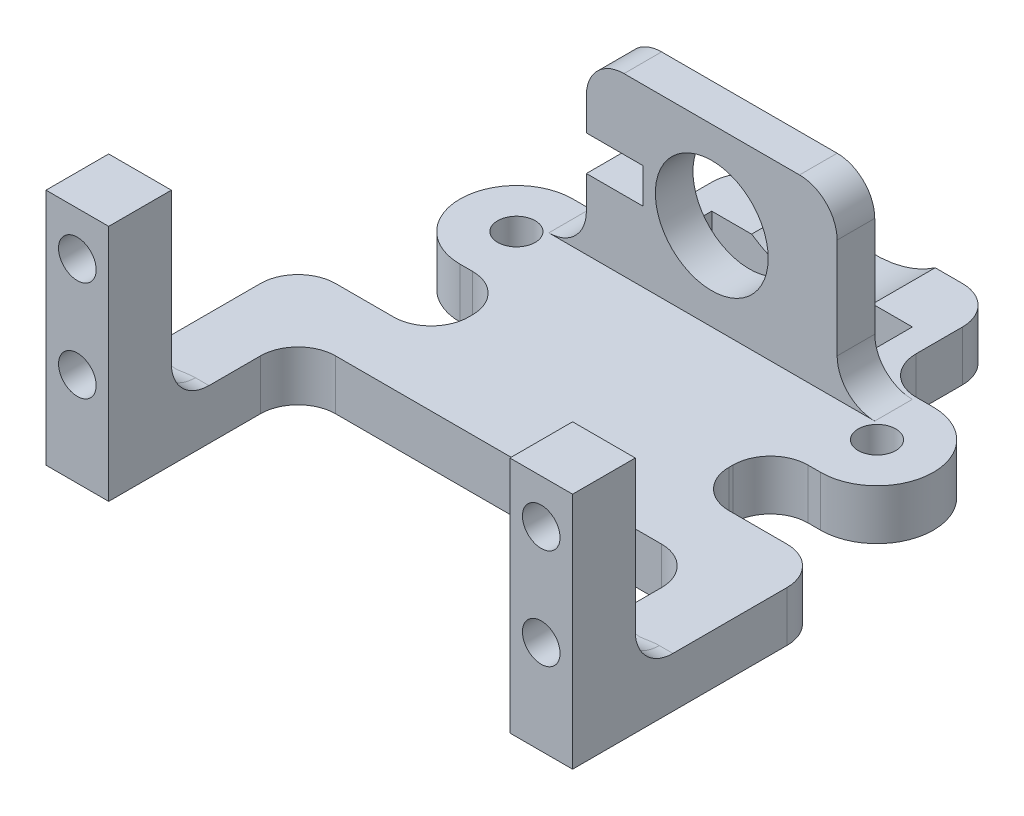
ISO-10303-21;
HEADER;
FILE_DESCRIPTION(('STEP AP214'),'2;1');
FILE_NAME('part.step','',(''),(''),'','','');
FILE_SCHEMA(('AUTOMOTIVE_DESIGN { 1 0 10303 214 1 1 1 1 }'));
ENDSEC;
DATA;
#1=APPLICATION_CONTEXT('core data for automotive mechanical design processes');
#2=APPLICATION_PROTOCOL_DEFINITION('international standard','automotive_design',2000,#1);
#3=PRODUCT_CONTEXT('',#1,'mechanical');
#4=PRODUCT('Part','Part','',(#3));
#5=PRODUCT_RELATED_PRODUCT_CATEGORY('part','',(#4));
#6=PRODUCT_DEFINITION_FORMATION('','',#4);
#7=PRODUCT_DEFINITION_CONTEXT('part definition',#1,'design');
#8=PRODUCT_DEFINITION('design','',#6,#7);
#9=PRODUCT_DEFINITION_SHAPE('','',#8);
#10=(LENGTH_UNIT() NAMED_UNIT(*) SI_UNIT(.MILLI.,.METRE.));
#11=(NAMED_UNIT(*) PLANE_ANGLE_UNIT() SI_UNIT($,.RADIAN.));
#12=(NAMED_UNIT(*) SI_UNIT($,.STERADIAN.) SOLID_ANGLE_UNIT());
#13=UNCERTAINTY_MEASURE_WITH_UNIT(LENGTH_MEASURE(1.E-05),#10,'distance_accuracy_value','');
#14=(GEOMETRIC_REPRESENTATION_CONTEXT(3) GLOBAL_UNCERTAINTY_ASSIGNED_CONTEXT((#13)) GLOBAL_UNIT_ASSIGNED_CONTEXT((#10,
#11,#12)) REPRESENTATION_CONTEXT('',''));
#15=CARTESIAN_POINT('',(0.,0.,0.));
#16=DIRECTION('',(0.,0.,1.));
#17=DIRECTION('',(1.,0.,0.));
#18=AXIS2_PLACEMENT_3D('',#15,#16,#17);
#19=CARTESIAN_POINT('',(0.,-6.,-20.5));
#20=DIRECTION('',(1.,0.,0.));
#21=DIRECTION('',(0.,1.,0.));
#22=AXIS2_PLACEMENT_3D('',#19,#20,#21);
#23=CYLINDRICAL_SURFACE('',#22,3.);
#24=CARTESIAN_POINT('',(-79.8005102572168,-6.00000000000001,-17.5));
#25=CARTESIAN_POINT('',(-79.8130759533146,-6.06162864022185,-17.4999862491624));
#26=CARTESIAN_POINT('',(-79.8279895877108,-6.12275566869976,-17.5018984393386));
#27=CARTESIAN_POINT('',(-79.8622853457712,-6.24345984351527,-17.5092881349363));
#28=CARTESIAN_POINT('',(-79.8816629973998,-6.30303847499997,-17.5147620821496));
#29=CARTESIAN_POINT('',(-79.9245118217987,-6.41975151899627,-17.5289324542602));
#30=CARTESIAN_POINT('',(-79.947948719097,-6.47690176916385,-17.5376025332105));
#31=CARTESIAN_POINT('',(-79.9987564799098,-6.58889261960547,-17.5578159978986));
#32=CARTESIAN_POINT('',(-80.0261281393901,-6.64373274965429,-17.569359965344));
#33=CARTESIAN_POINT('',(-80.1135094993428,-6.80389361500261,-17.6076398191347));
#34=CARTESIAN_POINT('',(-80.1789902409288,-6.90540453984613,-17.6380966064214));
#35=CARTESIAN_POINT('',(-80.3226164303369,-7.09673653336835,-17.7058065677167));
#36=CARTESIAN_POINT('',(-80.4007921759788,-7.18652868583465,-17.7430760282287));
#37=CARTESIAN_POINT('',(-80.5387039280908,-7.32410186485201,-17.8073570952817));
#38=CARTESIAN_POINT('',(-80.5952836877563,-7.37556789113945,-17.8333787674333));
#39=CARTESIAN_POINT('',(-80.7125121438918,-7.4727866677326,-17.8858186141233));
#40=CARTESIAN_POINT('',(-80.7731415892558,-7.51856385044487,-17.9122345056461));
#41=CARTESIAN_POINT('',(-80.8357864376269,-7.56155281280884,-17.9384471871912));
#42=B_SPLINE_CURVE_WITH_KNOTS('',3,(#24,#25,#26,#27,#28,#29,#30,#31,#32,#33,#34,#35,#36,#37,#38,
#39,#40,#41),.UNSPECIFIED.,.F.,.F.,(4,2,2,2,2,2,2,2,4),(0.,0.188581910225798,0.376975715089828,
0.563850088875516,0.750762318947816,1.12283596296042,1.49581101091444,1.73789981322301,
1.97891005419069),.UNSPECIFIED.);
#43=CARTESIAN_POINT('',(-79.8005102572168,-6.00000000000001,-17.5));
#44=VERTEX_POINT('',#43);
#45=CARTESIAN_POINT('',(-80.8357864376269,-7.56155281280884,-17.9384471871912));
#46=VERTEX_POINT('',#45);
#47=EDGE_CURVE('E447',#44,#46,#42,.T.);
#48=ORIENTED_EDGE('',*,*,#47,.F.);
#49=DIRECTION('',(1.,0.,0.));
#50=VECTOR('',#49,1.);
#51=CARTESIAN_POINT('',(0.,-6.,-17.5));
#52=LINE('',#51,#50);
#53=CARTESIAN_POINT('',(-79.75,-6.00000000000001,-17.5));
#54=VERTEX_POINT('',#53);
#55=EDGE_CURVE('E456',#54,#44,#52,.F.);
#56=ORIENTED_EDGE('',*,*,#55,.F.);
#57=CARTESIAN_POINT('',(-79.75,-6.00000000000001,-20.5));
#58=DIRECTION('',(-1.,0.,0.));
#59=DIRECTION('',(0.,0.,1.));
#60=AXIS2_PLACEMENT_3D('',#57,#58,#59);
#61=CIRCLE('',#60,3.);
#62=CARTESIAN_POINT('',(-79.75,-9.00000000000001,-20.5));
#63=VERTEX_POINT('',#62);
#64=EDGE_CURVE('E520',#63,#54,#61,.T.);
#65=ORIENTED_EDGE('',*,*,#64,.F.);
#66=DIRECTION('',(1.,0.,0.));
#67=VECTOR('',#66,1.);
#68=CARTESIAN_POINT('',(0.,-9.,-20.5));
#69=LINE('',#68,#67);
#70=CARTESIAN_POINT('',(-80.8357864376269,-9.00000000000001,-20.5));
#71=VERTEX_POINT('',#70);
#72=EDGE_CURVE('E870',#71,#63,#69,.T.);
#73=ORIENTED_EDGE('',*,*,#72,.F.);
#74=CARTESIAN_POINT('',(-80.8357864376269,-6.00000000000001,-20.5));
#75=DIRECTION('',(1.,0.,0.));
#76=DIRECTION('',(0.,0.,-1.));
#77=AXIS2_PLACEMENT_3D('',#74,#75,#76);
#78=CIRCLE('',#77,3.);
#79=EDGE_CURVE('E458',#46,#71,#78,.T.);
#80=ORIENTED_EDGE('',*,*,#79,.F.);
#81=EDGE_LOOP('',(#48,#56,#65,#73,#80));
#82=FACE_BOUND('',#81,.T.);
#83=ADVANCED_FACE('F51',(#82),#23,.F.);
#84=CARTESIAN_POINT('',(-84.3895579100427,-9.00000000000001,-20.4178597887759));
#85=CARTESIAN_POINT('',(-83.6727357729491,-9.00000000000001,-17.337070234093));
#86=CARTESIAN_POINT('',(-83.7106454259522,-5.8413428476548,-17.5));
#87=CARTESIAN_POINT('',(-84.3478372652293,-9.00000000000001,-20.4275682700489));
#88=CARTESIAN_POINT('',(-83.6750910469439,-9.00000000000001,-17.34336805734));
#89=CARTESIAN_POINT('',(-83.7091665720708,-5.84765947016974,-17.5));
#90=CARTESIAN_POINT('',(-84.3059156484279,-9.00000000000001,-20.4364096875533));
#91=CARTESIAN_POINT('',(-83.6771362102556,-9.00000000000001,-17.3501372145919));
#92=CARTESIAN_POINT('',(-83.7075654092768,-5.85433691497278,-17.5));
#93=CARTESIAN_POINT('',(-84.2217471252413,-9.00000000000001,-20.4523609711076));
#94=CARTESIAN_POINT('',(-83.6804206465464,-9.00000000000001,-17.3647139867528));
#95=CARTESIAN_POINT('',(-83.704034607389,-5.86856373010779,-17.5));
#96=CARTESIAN_POINT('',(-84.1795002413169,-9.00000000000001,-20.4594709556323));
#97=CARTESIAN_POINT('',(-83.6816614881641,-9.00000000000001,-17.372516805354));
#98=CARTESIAN_POINT('',(-83.7021049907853,-5.87611304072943,-17.5));
#99=CARTESIAN_POINT('',(-84.0945835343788,-9.00000000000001,-20.471988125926));
#100=CARTESIAN_POINT('',(-83.6831658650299,-9.00000000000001,-17.3892913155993));
#101=CARTESIAN_POINT('',(-83.6978247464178,-5.8922667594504,-17.5));
#102=CARTESIAN_POINT('',(-84.0519126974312,-9.00000000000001,-20.4773884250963));
#103=CARTESIAN_POINT('',(-83.6834280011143,-9.00000000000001,-17.3982615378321));
#104=CARTESIAN_POINT('',(-83.6954724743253,-5.90087524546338,-17.5));
#105=CARTESIAN_POINT('',(-83.9663868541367,-9.00000000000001,-20.486460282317));
#106=CARTESIAN_POINT('',(-83.6827322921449,-9.00000000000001,-17.4174681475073));
#107=CARTESIAN_POINT('',(-83.6902294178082,-5.91932265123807,-17.5));
#108=CARTESIAN_POINT('',(-83.9235318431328,-9.00000000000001,-20.4901317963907));
#109=CARTESIAN_POINT('',(-83.6817784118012,-9.00000000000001,-17.427696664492));
#110=CARTESIAN_POINT('',(-83.6873386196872,-5.92916160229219,-17.5));
#111=CARTESIAN_POINT('',(-83.8380782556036,-9.00000000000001,-20.495742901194));
#112=CARTESIAN_POINT('',(-83.6783760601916,-9.00000000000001,-17.4494671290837));
#113=CARTESIAN_POINT('',(-83.6808799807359,-5.95022571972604,-17.5));
#114=CARTESIAN_POINT('',(-83.7954806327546,-9.00000000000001,-20.4976970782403));
#115=CARTESIAN_POINT('',(-83.6759466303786,-9.00000000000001,-17.4609866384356));
#116=CARTESIAN_POINT('',(-83.6773181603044,-5.96143827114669,-17.5));
#117=CARTESIAN_POINT('',(-83.7102443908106,-9.00000000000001,-20.4999585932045));
#118=CARTESIAN_POINT('',(-83.6692419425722,-9.00000000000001,-17.4855694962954));
#119=CARTESIAN_POINT('',(-83.6692734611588,-5.98561829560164,-17.5));
#120=CARTESIAN_POINT('',(-83.6676057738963,-9.00000000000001,-20.5002660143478));
#121=CARTESIAN_POINT('',(-83.6649761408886,-9.00000000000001,-17.4986195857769));
#122=CARTESIAN_POINT('',(-83.6647906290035,-5.99858567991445,-17.5));
#123=CARTESIAN_POINT('',(-83.5824502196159,-9.00000000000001,-20.4992804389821));
#124=CARTESIAN_POINT('',(-83.6541459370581,-9.00000000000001,-17.5264190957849));
#125=CARTESIAN_POINT('',(-83.6545963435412,-6.02662507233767,-17.5));
#126=CARTESIAN_POINT('',(-83.5399332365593,-9.00000000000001,-20.4979912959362));
#127=CARTESIAN_POINT('',(-83.6476014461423,-9.00000000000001,-17.5411468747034));
#128=CARTESIAN_POINT('',(-83.6488878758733,-6.04169193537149,-17.5));
#129=CARTESIAN_POINT('',(-83.4549683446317,-9.00000000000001,-20.4938833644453));
#130=CARTESIAN_POINT('',(-83.6315842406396,-9.00000000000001,-17.5725436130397));
#131=CARTESIAN_POINT('',(-83.6357566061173,-6.07444206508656,-17.5));
#132=CARTESIAN_POINT('',(-83.4125204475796,-9.00000000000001,-20.4910643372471));
#133=CARTESIAN_POINT('',(-83.6221331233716,-9.00000000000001,-17.5891898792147));
#134=CARTESIAN_POINT('',(-83.6283335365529,-6.09212573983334,-17.5));
#135=CARTESIAN_POINT('',(-83.3068398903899,-9.00000000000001,-20.4822318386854));
#136=CARTESIAN_POINT('',(-83.5939975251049,-9.00000000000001,-17.6333380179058));
#137=CARTESIAN_POINT('',(-83.6068927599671,-6.1402195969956,-17.5));
#138=CARTESIAN_POINT('',(-83.2436801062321,-9.00000000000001,-20.4753286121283));
#139=CARTESIAN_POINT('',(-83.5730886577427,-9.00000000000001,-17.6621603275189));
#140=CARTESIAN_POINT('',(-83.5914281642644,-6.17260531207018,-17.5));
#141=CARTESIAN_POINT('',(-83.1492399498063,-9.00000000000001,-20.4628960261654));
#142=CARTESIAN_POINT('',(-83.5323456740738,-9.00000000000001,-17.7097791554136));
#143=CARTESIAN_POINT('',(-83.5613734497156,-6.22851142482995,-17.5));
#144=CARTESIAN_POINT('',(-83.1178159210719,-9.00000000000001,-20.458406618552));
#145=CARTESIAN_POINT('',(-83.5173047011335,-9.00000000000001,-17.7262814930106));
#146=CARTESIAN_POINT('',(-83.5502150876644,-6.24836346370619,-17.5));
#147=CARTESIAN_POINT('',(-83.0550602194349,-9.00000000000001,-20.4488222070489));
#148=CARTESIAN_POINT('',(-83.4834157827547,-9.00000000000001,-17.7607529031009));
#149=CARTESIAN_POINT('',(-83.5247903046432,-6.29090494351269,-17.5));
#150=CARTESIAN_POINT('',(-83.0237285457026,-9.00000000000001,-20.4437272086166));
#151=CARTESIAN_POINT('',(-83.4646060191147,-9.00000000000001,-17.7786987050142));
#152=CARTESIAN_POINT('',(-83.5105239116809,-6.31359435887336,-17.5));
#153=CARTESIAN_POINT('',(-82.9611823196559,-9.00000000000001,-20.4330475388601));
#154=CARTESIAN_POINT('',(-83.4223187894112,-9.00000000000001,-17.8160416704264));
#155=CARTESIAN_POINT('',(-83.4778194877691,-6.36215834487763,-17.5));
#156=CARTESIAN_POINT('',(-82.929967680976,-9.00000000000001,-20.4274633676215));
#157=CARTESIAN_POINT('',(-83.3988984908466,-9.00000000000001,-17.8354102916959));
#158=CARTESIAN_POINT('',(-83.4593856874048,-6.38802967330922,-17.5));
#159=CARTESIAN_POINT('',(-82.8676026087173,-9.00000000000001,-20.4159510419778));
#160=CARTESIAN_POINT('',(-83.3462732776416,-9.00000000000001,-17.875498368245));
#161=CARTESIAN_POINT('',(-83.4168312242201,-6.44325216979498,-17.5));
#162=CARTESIAN_POINT('',(-82.8364521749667,-9.00000000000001,-20.410022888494));
#163=CARTESIAN_POINT('',(-83.3171387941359,-9.00000000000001,-17.8961886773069));
#164=CARTESIAN_POINT('',(-83.3927105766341,-6.47260332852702,-17.5));
#165=CARTESIAN_POINT('',(-82.7741209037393,-9.00000000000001,-20.3980155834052));
#166=CARTESIAN_POINT('',(-83.2517015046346,-9.00000000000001,-17.9386220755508));
#167=CARTESIAN_POINT('',(-83.3366884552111,-6.53482786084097,-17.5));
#168=CARTESIAN_POINT('',(-82.7429401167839,-9.00000000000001,-20.3919361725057));
#169=CARTESIAN_POINT('',(-83.2154761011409,-9.00000000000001,-17.9603400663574));
#170=CARTESIAN_POINT('',(-83.3047726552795,-6.56770765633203,-17.5));
#171=CARTESIAN_POINT('',(-82.6805495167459,-9.00000000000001,-20.3799175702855));
#172=CARTESIAN_POINT('',(-83.1344249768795,-9.00000000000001,-18.0040694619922));
#173=CARTESIAN_POINT('',(-83.2305587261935,-6.63624927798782,-17.5));
#174=CARTESIAN_POINT('',(-82.6493397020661,-9.00000000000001,-20.3739783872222));
#175=CARTESIAN_POINT('',(-83.0897052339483,-9.00000000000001,-18.0260643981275));
#176=CARTESIAN_POINT('',(-83.1882599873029,-6.67191126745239,-17.5));
#177=CARTESIAN_POINT('',(-82.5859353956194,-9.00000000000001,-20.3624574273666));
#178=CARTESIAN_POINT('',(-82.9888905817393,-9.00000000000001,-18.0696374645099));
#179=CARTESIAN_POINT('',(-83.0888819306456,-6.74506394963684,-17.5));
#180=CARTESIAN_POINT('',(-82.553738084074,-9.00000000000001,-20.356890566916));
#181=CARTESIAN_POINT('',(-82.9326015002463,-9.00000000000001,-18.0912011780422));
#182=CARTESIAN_POINT('',(-83.0314173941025,-6.78257782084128,-17.5));
#183=CARTESIAN_POINT('',(-82.5053140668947,-9.00000000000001,-20.3493484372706));
#184=CARTESIAN_POINT('',(-82.8396551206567,-9.00000000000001,-18.1210601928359));
#185=CARTESIAN_POINT('',(-82.932829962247,-6.83608681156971,-17.5));
#186=CARTESIAN_POINT('',(-82.4891509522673,-9.00000000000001,-20.3469690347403));
#187=CARTESIAN_POINT('',(-82.8073686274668,-9.00000000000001,-18.1305742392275));
#188=CARTESIAN_POINT('',(-82.8979012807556,-6.85346326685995,-17.5));
#189=CARTESIAN_POINT('',(-82.4567781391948,-9.00000000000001,-20.3425542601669));
#190=CARTESIAN_POINT('',(-82.7401687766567,-9.00000000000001,-18.1483839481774));
#191=CARTESIAN_POINT('',(-82.8239100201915,-6.88645956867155,-17.5));
#192=CARTESIAN_POINT('',(-82.4405684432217,-9.00000000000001,-20.3405188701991));
#193=CARTESIAN_POINT('',(-82.7052506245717,-9.00000000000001,-18.1566891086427));
#194=CARTESIAN_POINT('',(-82.7848476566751,-6.90207950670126,-17.5));
#195=CARTESIAN_POINT('',(-82.4081685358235,-9.00000000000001,-20.3368721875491));
#196=CARTESIAN_POINT('',(-82.6332014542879,-9.00000000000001,-18.1716768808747));
#197=CARTESIAN_POINT('',(-82.7030156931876,-6.93060933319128,-17.5));
#198=CARTESIAN_POINT('',(-82.3919785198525,-9.00000000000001,-20.3352591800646));
#199=CARTESIAN_POINT('',(-82.5960643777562,-9.00000000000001,-18.1783768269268));
#200=CARTESIAN_POINT('',(-82.6602620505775,-6.94353013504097,-17.5));
#201=CARTESIAN_POINT('',(-82.3595575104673,-9.00000000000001,-20.3325119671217));
#202=CARTESIAN_POINT('',(-82.5199134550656,-9.00000000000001,-18.1898430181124));
#203=CARTESIAN_POINT('',(-82.5715500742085,-6.965842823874,-17.5));
#204=CARTESIAN_POINT('',(-82.3433265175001,-9.00000000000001,-20.3313777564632));
#205=CARTESIAN_POINT('',(-82.4808705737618,-9.00000000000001,-18.1946198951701));
#206=CARTESIAN_POINT('',(-82.5255917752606,-6.97523474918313,-17.5));
#207=CARTESIAN_POINT('',(-82.3108404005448,-9.00000000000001,-20.3296394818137));
#208=CARTESIAN_POINT('',(-82.4015679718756,-9.00000000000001,-18.2019559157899));
#209=CARTESIAN_POINT('',(-82.431508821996,-6.98973726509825,-17.5));
#210=CARTESIAN_POINT('',(-82.2945852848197,-9.00000000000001,-20.3290352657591));
#211=CARTESIAN_POINT('',(-82.3612681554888,-9.00000000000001,-18.2045236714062));
#212=CARTESIAN_POINT('',(-82.3833847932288,-6.99484908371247,-17.5));
#213=CARTESIAN_POINT('',(-82.262063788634,-9.00000000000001,-20.3283855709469));
#214=CARTESIAN_POINT('',(-82.280229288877,-9.00000000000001,-18.2072820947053));
#215=CARTESIAN_POINT('',(-82.2862903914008,-7.00034879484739,-17.5));
#216=CARTESIAN_POINT('',(-82.2457974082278,-9.00000000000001,-20.3283400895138));
#217=CARTESIAN_POINT('',(-82.239442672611,-9.00000000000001,-18.2074760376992));
#218=CARTESIAN_POINT('',(-82.2373200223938,-7.00073670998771,-17.5));
#219=CARTESIAN_POINT('',(-82.2132436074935,-9.00000000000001,-20.3288105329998));
#220=CARTESIAN_POINT('',(-82.1581975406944,-9.00000000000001,-18.2054777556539));
#221=CARTESIAN_POINT('',(-82.1399059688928,-6.99674999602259,-17.5));
#222=CARTESIAN_POINT('',(-82.1969562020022,-9.00000000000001,-20.3293274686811));
#223=CARTESIAN_POINT('',(-82.1176914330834,-9.00000000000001,-18.203278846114));
#224=CARTESIAN_POINT('',(-82.0914633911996,-6.99236679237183,-17.5));
#225=CARTESIAN_POINT('',(-82.1644076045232,-9.00000000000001,-20.3308991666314));
#226=CARTESIAN_POINT('',(-82.0378764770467,-9.00000000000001,-18.1966370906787));
#227=CARTESIAN_POINT('',(-81.9965682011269,-6.97921225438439,-17.5));
#228=CARTESIAN_POINT('',(-82.1481464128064,-9.00000000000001,-20.3319539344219));
#229=CARTESIAN_POINT('',(-81.9985254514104,-9.00000000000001,-18.1921868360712));
#230=CARTESIAN_POINT('',(-81.950115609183,-6.97044087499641,-17.5));
#231=CARTESIAN_POINT('',(-82.1156582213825,-9.00000000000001,-20.3345533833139));
#232=CARTESIAN_POINT('',(-81.9216649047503,-9.00000000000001,-18.1813150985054));
#233=CARTESIAN_POINT('',(-81.8602733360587,-6.94922290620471,-17.5));
#234=CARTESIAN_POINT('',(-82.0994312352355,-9.00000000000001,-20.3360982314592));
#235=CARTESIAN_POINT('',(-81.8841248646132,-9.00000000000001,-18.1748825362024));
#236=CARTESIAN_POINT('',(-81.816884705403,-6.9367750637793,-17.5));
#237=CARTESIAN_POINT('',(-82.0670239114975,-9.00000000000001,-20.3396135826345));
#238=CARTESIAN_POINT('',(-81.811370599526,-9.00000000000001,-18.1603960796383));
#239=CARTESIAN_POINT('',(-81.7338902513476,-6.90909419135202,-17.5));
#240=CARTESIAN_POINT('',(-82.0508435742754,-9.00000000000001,-20.3415840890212));
#241=CARTESIAN_POINT('',(-81.7761380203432,-9.00000000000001,-18.152331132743));
#242=CARTESIAN_POINT('',(-81.694284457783,-6.89386113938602,-17.5));
#243=CARTESIAN_POINT('',(-82.0184607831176,-9.00000000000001,-20.3458879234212));
#244=CARTESIAN_POINT('',(-81.7081308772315,-9.00000000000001,-18.1349160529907));
#245=CARTESIAN_POINT('',(-81.6190148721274,-6.86145038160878,-17.5));
#246=CARTESIAN_POINT('',(-82.0022585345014,-9.00000000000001,-20.3482227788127));
#247=CARTESIAN_POINT('',(-81.675361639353,-9.00000000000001,-18.125550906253));
#248=CARTESIAN_POINT('',(-81.5833688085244,-6.84426457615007,-17.5));
#249=CARTESIAN_POINT('',(-81.9698971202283,-9.00000000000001,-20.3531756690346));
#250=CARTESIAN_POINT('',(-81.6125557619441,-9.00000000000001,-18.1059174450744));
#251=CARTESIAN_POINT('',(-81.5162172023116,-6.80881677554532,-17.5));
#252=CARTESIAN_POINT('',(-81.9537379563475,-9.00000000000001,-20.3557937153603));
#253=CARTESIAN_POINT('',(-81.582522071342,-9.00000000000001,-18.0956418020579));
#254=CARTESIAN_POINT('',(-81.4847118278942,-6.79055473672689,-17.5));
#255=CARTESIAN_POINT('',(-81.905318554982,-9.00000000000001,-20.3639641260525));
#256=CARTESIAN_POINT('',(-81.4963143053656,-9.00000000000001,-18.0638829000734));
#257=CARTESIAN_POINT('',(-81.3961198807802,-6.73521956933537,-17.5));
#258=CARTESIAN_POINT('',(-81.8731123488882,-9.00000000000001,-20.3698333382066));
#259=CARTESIAN_POINT('',(-81.4445045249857,-9.00000000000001,-18.0415949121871));
#260=CARTESIAN_POINT('',(-81.3449481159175,-6.69759295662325,-17.5));
#261=CARTESIAN_POINT('',(-81.8092334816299,-9.00000000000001,-20.3818449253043));
#262=CARTESIAN_POINT('',(-81.3513461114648,-9.00000000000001,-17.9969633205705));
#263=CARTESIAN_POINT('',(-81.2560727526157,-6.62487965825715,-17.5));
#264=CARTESIAN_POINT('',(-81.7775598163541,-9.00000000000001,-20.3879821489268));
#265=CARTESIAN_POINT('',(-81.3099643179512,-9.00000000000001,-17.9746269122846));
#266=CARTESIAN_POINT('',(-81.2181858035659,-6.58976419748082,-17.5));
#267=CARTESIAN_POINT('',(-81.714213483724,-9.00000000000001,-20.400258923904));
#268=CARTESIAN_POINT('',(-81.2351670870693,-9.00000000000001,-17.9306097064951));
#269=CARTESIAN_POINT('',(-81.1518217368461,-6.52284843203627,-17.5));
#270=CARTESIAN_POINT('',(-81.6825408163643,-9.00000000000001,-20.4063984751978));
#271=CARTESIAN_POINT('',(-81.2018572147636,-9.00000000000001,-17.9089528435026));
#272=CARTESIAN_POINT('',(-81.1233443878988,-6.49104804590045,-17.5));
#273=CARTESIAN_POINT('',(-81.6192093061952,-9.00000000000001,-20.4184133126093));
#274=CARTESIAN_POINT('',(-81.1418161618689,-9.00000000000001,-17.8668724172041));
#275=CARTESIAN_POINT('',(-81.0733710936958,-6.43115913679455,-17.5));
#276=CARTESIAN_POINT('',(-81.5875505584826,-9.00000000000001,-20.4242890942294));
#277=CARTESIAN_POINT('',(-81.1151567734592,-9.00000000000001,-17.8464764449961));
#278=CARTESIAN_POINT('',(-81.0518615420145,-6.40306344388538,-17.5));
#279=CARTESIAN_POINT('',(-81.5241546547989,-9.00000000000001,-20.4356050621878));
#280=CARTESIAN_POINT('',(-81.067094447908,-9.00000000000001,-17.8070978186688));
#281=CARTESIAN_POINT('',(-81.0138911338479,-6.35034465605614,-17.5));
#282=CARTESIAN_POINT('',(-81.4924174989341,-9.00000000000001,-20.4410452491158));
#283=CARTESIAN_POINT('',(-81.0457555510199,-9.00000000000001,-17.7881448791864));
#284=CARTESIAN_POINT('',(-80.9974302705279,-6.32572155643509,-17.5));
#285=CARTESIAN_POINT('',(-81.4289440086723,-9.00000000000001,-20.4513393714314));
#286=CARTESIAN_POINT('',(-81.0073827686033,-9.00000000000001,-17.7517628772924));
#287=CARTESIAN_POINT('',(-80.9682544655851,-6.27965882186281,-17.5));
#288=CARTESIAN_POINT('',(-81.3972079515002,-9.00000000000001,-20.4561949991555));
#289=CARTESIAN_POINT('',(-80.9903822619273,-9.00000000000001,-17.7343551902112));
#290=CARTESIAN_POINT('',(-80.9555285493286,-6.25820995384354,-17.5));
#291=CARTESIAN_POINT('',(-81.3336410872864,-9.00000000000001,-20.4652398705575));
#292=CARTESIAN_POINT('',(-80.9598159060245,-9.00000000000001,-17.70096771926));
#293=CARTESIAN_POINT('',(-80.9328114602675,-6.2180122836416,-17.5));
#294=CARTESIAN_POINT('',(-81.3018102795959,-9.00000000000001,-20.4694291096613));
#295=CARTESIAN_POINT('',(-80.946283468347,-9.00000000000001,-17.6850099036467));
#296=CARTESIAN_POINT('',(-80.9228203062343,-6.1992634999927,-17.5));
#297=CARTESIAN_POINT('',(-81.2061431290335,-9.00000000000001,-20.480884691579));
#298=CARTESIAN_POINT('',(-80.9097298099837,-9.00000000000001,-17.639012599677));
#299=CARTESIAN_POINT('',(-80.8958644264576,-6.14645911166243,-17.5));
#300=CARTESIAN_POINT('',(-81.1421670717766,-9.00000000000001,-20.4870330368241));
#301=CARTESIAN_POINT('',(-80.8911146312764,-9.00000000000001,-17.6112308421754));
#302=CARTESIAN_POINT('',(-80.8819316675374,-6.11587000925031,-17.5));
#303=CARTESIAN_POINT('',(-81.013579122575,-9.00000000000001,-20.4959651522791));
#304=CARTESIAN_POINT('',(-80.8612306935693,-9.00000000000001,-17.5600798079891));
#305=CARTESIAN_POINT('',(-80.8586425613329,-6.06123197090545,-17.5));
#306=CARTESIAN_POINT('',(-80.9489657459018,-9.00000000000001,-20.4987278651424));
#307=CARTESIAN_POINT('',(-80.85010752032,-9.00000000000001,-17.53683537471));
#308=CARTESIAN_POINT('',(-80.8493150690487,-6.03722468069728,-17.5));
#309=CARTESIAN_POINT('',(-80.8196993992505,-9.00000000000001,-20.5005765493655));
#310=CARTESIAN_POINT('',(-80.8331536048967,-9.00000000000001,-17.494255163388));
#311=CARTESIAN_POINT('',(-80.8335597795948,-5.99418497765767,-17.5));
#312=CARTESIAN_POINT('',(-80.7550464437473,-9.00000000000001,-20.4996634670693));
#313=CARTESIAN_POINT('',(-80.8273728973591,-9.00000000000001,-17.4749800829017));
#314=CARTESIAN_POINT('',(-80.8271312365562,-5.97515128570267,-17.5));
#315=CARTESIAN_POINT('',(-80.6243696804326,-9.00000000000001,-20.4939440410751));
#316=CARTESIAN_POINT('',(-80.8194735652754,-9.00000000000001,-17.439299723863));
#317=CARTESIAN_POINT('',(-80.815971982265,-5.94034915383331,-17.5));
#318=CARTESIAN_POINT('',(-80.5583498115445,-9.00000000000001,-20.4890456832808));
#319=CARTESIAN_POINT('',(-80.8174740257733,-9.00000000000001,-17.4230188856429));
#320=CARTESIAN_POINT('',(-80.8112852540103,-5.92466906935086,-17.5));
#321=CARTESIAN_POINT('',(-80.4267009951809,-9.00000000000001,-20.4751575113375));
#322=CARTESIAN_POINT('',(-80.816392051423,-9.00000000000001,-17.3934220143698));
#323=CARTESIAN_POINT('',(-80.8032185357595,-5.89625211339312,-17.5));
#324=CARTESIAN_POINT('',(-80.3610723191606,-9.00000000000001,-20.4661651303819));
#325=CARTESIAN_POINT('',(-80.8173263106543,-9.00000000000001,-17.3801370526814));
#326=CARTESIAN_POINT('',(-80.7998393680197,-5.88351709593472,-17.5));
#327=CARTESIAN_POINT('',(-80.2957905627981,-9.00000000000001,-20.4550880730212));
#328=CARTESIAN_POINT('',(-80.8191755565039,-9.00000000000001,-17.3680925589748));
#329=CARTESIAN_POINT('',(-80.7968112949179,-5.87180988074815,-17.5));
#330=(BOUNDED_SURFACE() B_SPLINE_SURFACE(3,2,((#84,#85,#86),(#87,#88,#89),(#90,#91,#92),(#93,
#94,#95),(#96,#97,#98),(#99,#100,#101),(#102,#103,#104),(#105,#106,#107),(#108,#109,#110),(#111,
#112,#113),(#114,#115,#116),(#117,#118,#119),(#120,#121,#122),(#123,#124,#125),(#126,#127,#128),
(#129,#130,#131),(#132,#133,#134),(#135,#136,#137),(#138,#139,#140),(#141,#142,#143),(#144,#145,
#146),(#147,#148,#149),(#150,#151,#152),(#153,#154,#155),(#156,#157,#158),(#159,#160,#161),
(#162,#163,#164),(#165,#166,#167),(#168,#169,#170),(#171,#172,#173),(#174,#175,#176),(#177,#178,
#179),(#180,#181,#182),(#183,#184,#185),(#186,#187,#188),(#189,#190,#191),(#192,#193,#194),
(#195,#196,#197),(#198,#199,#200),(#201,#202,#203),(#204,#205,#206),(#207,#208,#209),(#210,#211,
#212),(#213,#214,#215),(#216,#217,#218),(#219,#220,#221),(#222,#223,#224),(#225,#226,#227),
(#228,#229,#230),(#231,#232,#233),(#234,#235,#236),(#237,#238,#239),(#240,#241,#242),(#243,#244,
#245),(#246,#247,#248),(#249,#250,#251),(#252,#253,#254),(#255,#256,#257),(#258,#259,#260),
(#261,#262,#263),(#264,#265,#266),(#267,#268,#269),(#270,#271,#272),(#273,#274,#275),(#276,#277,
#278),(#279,#280,#281),(#282,#283,#284),(#285,#286,#287),(#288,#289,#290),(#291,#292,#293),
(#294,#295,#296),(#297,#298,#299),(#300,#301,#302),(#303,#304,#305),(#306,#307,#308),(#309,#310,
#311),(#312,#313,#314),(#315,#316,#317),(#318,#319,#320),(#321,#322,#323),(#324,#325,#326),
(#327,#328,#329)),.UNSPECIFIED.,.F.,.F.,.F.) B_SPLINE_SURFACE_WITH_KNOTS((4,2,2,2,2,2,2,2,2,2,2,
2,2,2,2,2,2,2,2,2,2,2,2,2,2,2,2,2,2,2,2,2,2,2,2,2,2,2,2,2,4),(3,3),(0.,0.128495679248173,
0.256982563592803,0.385980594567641,0.514981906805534,0.64287664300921,0.770764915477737,
0.898345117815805,1.02594523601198,1.21646943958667,1.31169438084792,1.40691846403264,
1.50204631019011,1.59717390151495,1.69247765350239,1.78778700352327,1.88579980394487,
1.93480882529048,1.98381529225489,2.03261960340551,2.0814233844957,2.13021315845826,
2.17900269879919,2.22788006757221,2.27675793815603,2.32565248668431,2.37454742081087,
2.42365312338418,2.47276081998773,2.57096391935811,2.66775273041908,2.76453916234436,
2.86113543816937,2.95773158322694,3.05404098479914,3.15035104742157,3.34307757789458,
3.53699680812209,3.73086611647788,3.9293430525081,4.12794459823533),(0.,1.),
.UNSPECIFIED.) GEOMETRIC_REPRESENTATION_ITEM() RATIONAL_B_SPLINE_SURFACE(((1.,0.688154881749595,
1.),(1.,0.688919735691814,1.),(1.,0.689727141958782,1.),(1.,0.691443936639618,1.),(1.,
0.692353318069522,1.),(1.,0.694294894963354,1.),(1.,0.69532756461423,1.),(1.,0.697534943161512,
1.),(1.,0.698709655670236,1.),(1.,0.701217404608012,1.),(1.,0.702548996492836,1.),(1.,
0.705411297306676,1.),(1.,0.706941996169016,1.),(1.,0.710239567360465,1.),(1.,0.712005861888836,
1.),(1.,0.715828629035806,1.),(1.,0.717885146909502,1.),(1.,0.723450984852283,1.),(1.,
0.727176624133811,1.),(1.,0.733545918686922,1.),(1.,0.735798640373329,1.),(1.,0.740601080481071,
1.),(1.,0.74315079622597,1.),(1.,0.748576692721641,1.),(1.,0.751452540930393,1.),(1.,
0.757551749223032,1.),(1.,0.760775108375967,1.),(1.,0.76756071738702,1.),(1.,0.77112358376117,
1.),(1.,0.778495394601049,1.),(1.,0.782304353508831,1.),(1.,0.790058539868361,1.),(1.,
0.794004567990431,1.),(1.,0.799594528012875,1.),(1.,0.801403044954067,1.),(1.,0.804826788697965,
1.),(1.,0.806442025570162,1.),(1.,0.809384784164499,1.),(1.,0.810713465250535,1.),(1.,
0.81300376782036,1.),(1.,0.813965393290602,1.),(1.,0.815448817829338,1.),(1.,0.815970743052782,
1.),(1.,0.816532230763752,1.),(1.,0.816571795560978,1.),(1.,0.816164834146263,1.),(1.,
0.815717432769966,1.),(1.,0.814372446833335,1.),(1.,0.813474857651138,1.),(1.,0.811298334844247,
1.),(1.,0.810019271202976,1.),(1.,0.80716647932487,1.),(1.,0.805592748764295,1.),(1.,
0.802233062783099,1.),(1.,0.800446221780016,1.),(1.,0.796747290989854,1.),(1.,0.794835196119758,
1.),(1.,0.789019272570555,1.),(1.,0.785035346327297,1.),(1.,0.77727838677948,1.),(1.,
0.773503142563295,1.),(1.,0.766260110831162,1.),(1.,0.762792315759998,1.),(1.,0.756221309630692,
1.),(1.,0.753117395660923,1.),(1.,0.747261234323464,1.),(1.,0.744508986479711,1.),(1.,
0.739335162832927,1.),(1.,0.736912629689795,1.),(1.,0.732352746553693,1.),(1.,0.730215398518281,
1.),(1.,0.724172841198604,1.),(1.,0.72063989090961,1.),(1.,0.714293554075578,1.),(1.,
0.71148475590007,1.),(1.,0.706425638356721,1.),(1.,0.704175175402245,1.),(1.,0.700044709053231,
1.),(1.,0.698174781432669,1.),(1.,0.694774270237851,1.),(1.,0.693243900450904,1.),(1.,
0.691834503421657,1.))) REPRESENTATION_ITEM('') SURFACE());
#331=CARTESIAN_POINT('',(-80.8357864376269,-7.56155281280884,-17.9384471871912));
#332=CARTESIAN_POINT('',(-80.8596515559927,-7.57792947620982,-17.9484138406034));
#333=CARTESIAN_POINT('',(-80.8840580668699,-7.59405759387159,-17.9574265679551));
#334=CARTESIAN_POINT('',(-80.9337793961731,-7.62565852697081,-17.973862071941));
#335=CARTESIAN_POINT('',(-80.9590932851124,-7.64113197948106,-17.9812864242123));
#336=CARTESIAN_POINT('',(-81.0104349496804,-7.67125861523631,-17.9948636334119));
#337=CARTESIAN_POINT('',(-81.0364606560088,-7.68591386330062,-18.0010198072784));
#338=CARTESIAN_POINT('',(-81.0891942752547,-7.71436857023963,-18.0123315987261));
#339=CARTESIAN_POINT('',(-81.1159023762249,-7.72816778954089,-18.0174869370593));
#340=CARTESIAN_POINT('',(-81.1966274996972,-7.7680370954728,-18.0316983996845));
#341=CARTESIAN_POINT('',(-81.2515328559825,-7.79274786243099,-18.0395707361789));
#342=CARTESIAN_POINT('',(-81.3632391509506,-7.83822562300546,-18.0531476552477));
#343=CARTESIAN_POINT('',(-81.4200414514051,-7.85898970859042,-18.0588506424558));
#344=CARTESIAN_POINT('',(-81.5345010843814,-7.89617187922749,-18.0685877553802));
#345=CARTESIAN_POINT('',(-81.5921422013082,-7.91263514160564,-18.0726395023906));
#346=CARTESIAN_POINT('',(-81.7084938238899,-7.9413864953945,-18.0794836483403));
#347=CARTESIAN_POINT('',(-81.7672040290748,-7.95367574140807,-18.0822763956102));
#348=CARTESIAN_POINT('',(-81.9447078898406,-7.98418784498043,-18.0890879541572));
#349=CARTESIAN_POINT('',(-82.0647556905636,-7.99601636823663,-18.0915310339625));
#350=CARTESIAN_POINT('',(-82.2530510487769,-8.00093106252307,-18.0925502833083));
#351=CARTESIAN_POINT('',(-82.3212183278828,-7.99991530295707,-18.0923428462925));
#352=CARTESIAN_POINT('',(-82.4572503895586,-7.99232419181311,-18.0907443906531));
#353=CARTESIAN_POINT('',(-82.5251151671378,-7.98574874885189,-18.0893533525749));
#354=CARTESIAN_POINT('',(-82.659962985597,-7.96709567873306,-18.0852852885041));
#355=CARTESIAN_POINT('',(-82.7269469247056,-7.95502419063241,-18.0826096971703));
#356=CARTESIAN_POINT('',(-82.8596530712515,-7.9254778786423,-18.0757437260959));
#357=CARTESIAN_POINT('',(-82.92537502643,-7.90800198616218,-18.0715530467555));
#358=CARTESIAN_POINT('',(-83.0507322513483,-7.86914437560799,-18.0615814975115));
#359=CARTESIAN_POINT('',(-83.1104819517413,-7.84809896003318,-18.0559246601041));
#360=CARTESIAN_POINT('',(-83.2279610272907,-7.80164591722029,-18.0423426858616));
#361=CARTESIAN_POINT('',(-83.2856920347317,-7.77624191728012,-18.034419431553));
#362=CARTESIAN_POINT('',(-83.3705087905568,-7.73505166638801,-18.0200057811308));
#363=CARTESIAN_POINT('',(-83.3985476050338,-7.72077066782,-18.0147645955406));
#364=CARTESIAN_POINT('',(-83.4538919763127,-7.69126151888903,-18.0032202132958));
#365=CARTESIAN_POINT('',(-83.4811977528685,-7.67603365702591,-17.9969173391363));
#366=CARTESIAN_POINT('',(-83.5350474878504,-7.64467344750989,-17.9829577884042));
#367=CARTESIAN_POINT('',(-83.5615890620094,-7.62853865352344,-17.9752973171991));
#368=CARTESIAN_POINT('',(-83.6136893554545,-7.59554531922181,-17.9582558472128));
#369=CARTESIAN_POINT('',(-83.6392469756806,-7.57868601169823,-17.9488729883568));
#370=CARTESIAN_POINT('',(-83.6642135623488,-7.56155281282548,-17.9384471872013));
#371=B_SPLINE_CURVE_WITH_KNOTS('',3,(#331,#332,#333,#334,#335,#336,#337,#338,#339,#340,#341,
#342,#343,#344,#345,#346,#347,#348,#349,#350,#351,#352,#353,#354,#355,#356,#357,#358,#359,#360,
#361,#362,#363,#364,#365,#366,#367,#368,#369,#370),.UNSPECIFIED.,.F.,.F.,(4,2,2,2,2,2,2,2,2,2,2,
2,2,2,2,2,2,2,2,4),(0.,0.0917834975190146,0.183475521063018,0.27492458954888,0.366399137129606,
0.548329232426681,0.730392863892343,0.910459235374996,1.09047575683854,1.45088193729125,
1.65521744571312,1.85955631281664,2.0636674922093,2.26781905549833,2.45841806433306,
2.64885921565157,2.74452630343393,2.84016438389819,2.93607412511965,3.03208805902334),.UNSPECIFIED.);
#372=CARTESIAN_POINT('',(-83.6642135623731,-7.56155281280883,-17.9384471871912));
#373=VERTEX_POINT('',#372);
#374=EDGE_CURVE('E460',#46,#373,#371,.T.);
#375=ORIENTED_EDGE('',*,*,#374,.F.);
#376=ORIENTED_EDGE('',*,*,#79,.T.);
#377=CARTESIAN_POINT('',(-84.3895579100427,-9.00000000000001,-20.4178597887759));
#378=CARTESIAN_POINT('',(-84.3478372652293,-9.00000000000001,-20.4275682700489));
#379=CARTESIAN_POINT('',(-84.3059156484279,-9.00000000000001,-20.4364096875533));
#380=CARTESIAN_POINT('',(-84.2217471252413,-9.00000000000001,-20.4523609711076));
#381=CARTESIAN_POINT('',(-84.1795002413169,-9.00000000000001,-20.4594709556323));
#382=CARTESIAN_POINT('',(-84.0945835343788,-9.00000000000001,-20.471988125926));
#383=CARTESIAN_POINT('',(-84.0519126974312,-9.00000000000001,-20.4773884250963));
#384=CARTESIAN_POINT('',(-83.9663868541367,-9.00000000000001,-20.486460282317));
#385=CARTESIAN_POINT('',(-83.9235318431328,-9.00000000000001,-20.4901317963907));
#386=CARTESIAN_POINT('',(-83.8380782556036,-9.00000000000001,-20.495742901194));
#387=CARTESIAN_POINT('',(-83.7954806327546,-9.00000000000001,-20.4976970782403));
#388=CARTESIAN_POINT('',(-83.7102443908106,-9.00000000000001,-20.4999585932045));
#389=CARTESIAN_POINT('',(-83.6676057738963,-9.00000000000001,-20.5002660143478));
#390=CARTESIAN_POINT('',(-83.5824502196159,-9.00000000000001,-20.4992804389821));
#391=CARTESIAN_POINT('',(-83.5399332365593,-9.00000000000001,-20.4979912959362));
#392=CARTESIAN_POINT('',(-83.4549683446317,-9.00000000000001,-20.4938833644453));
#393=CARTESIAN_POINT('',(-83.4125204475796,-9.00000000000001,-20.4910643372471));
#394=CARTESIAN_POINT('',(-83.3068398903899,-9.00000000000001,-20.4822318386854));
#395=CARTESIAN_POINT('',(-83.2436801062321,-9.00000000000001,-20.4753286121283));
#396=CARTESIAN_POINT('',(-83.1492399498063,-9.00000000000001,-20.4628960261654));
#397=CARTESIAN_POINT('',(-83.1178159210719,-9.00000000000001,-20.4584066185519));
#398=CARTESIAN_POINT('',(-83.0550602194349,-9.00000000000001,-20.4488222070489));
#399=CARTESIAN_POINT('',(-83.0237285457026,-9.00000000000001,-20.4437272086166));
#400=CARTESIAN_POINT('',(-82.9611823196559,-9.00000000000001,-20.4330475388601));
#401=CARTESIAN_POINT('',(-82.929967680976,-9.00000000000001,-20.4274633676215));
#402=CARTESIAN_POINT('',(-82.8676026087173,-9.00000000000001,-20.4159510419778));
#403=CARTESIAN_POINT('',(-82.8364521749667,-9.00000000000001,-20.410022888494));
#404=CARTESIAN_POINT('',(-82.7741209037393,-9.00000000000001,-20.3980155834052));
#405=CARTESIAN_POINT('',(-82.7429401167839,-9.00000000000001,-20.3919361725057));
#406=CARTESIAN_POINT('',(-82.6805495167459,-9.00000000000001,-20.3799175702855));
#407=CARTESIAN_POINT('',(-82.6493397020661,-9.00000000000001,-20.3739783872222));
#408=CARTESIAN_POINT('',(-82.5859353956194,-9.00000000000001,-20.3624574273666));
#409=CARTESIAN_POINT('',(-82.553738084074,-9.00000000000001,-20.356890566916));
#410=CARTESIAN_POINT('',(-82.5053140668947,-9.00000000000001,-20.3493484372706));
#411=CARTESIAN_POINT('',(-82.4891509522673,-9.00000000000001,-20.3469690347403));
#412=CARTESIAN_POINT('',(-82.4567781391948,-9.00000000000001,-20.3425542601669));
#413=CARTESIAN_POINT('',(-82.4405684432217,-9.00000000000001,-20.3405188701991));
#414=CARTESIAN_POINT('',(-82.4081685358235,-9.00000000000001,-20.3368721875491));
#415=CARTESIAN_POINT('',(-82.3919785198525,-9.00000000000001,-20.3352591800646));
#416=CARTESIAN_POINT('',(-82.3595575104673,-9.00000000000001,-20.3325119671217));
#417=CARTESIAN_POINT('',(-82.3433265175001,-9.00000000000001,-20.3313777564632));
#418=CARTESIAN_POINT('',(-82.3108404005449,-9.00000000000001,-20.3296394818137));
#419=CARTESIAN_POINT('',(-82.2945852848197,-9.00000000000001,-20.3290352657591));
#420=CARTESIAN_POINT('',(-82.262063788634,-9.00000000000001,-20.3283855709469));
#421=CARTESIAN_POINT('',(-82.2457974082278,-9.00000000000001,-20.3283400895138));
#422=CARTESIAN_POINT('',(-82.2132436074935,-9.00000000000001,-20.3288105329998));
#423=CARTESIAN_POINT('',(-82.1969562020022,-9.00000000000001,-20.3293274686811));
#424=CARTESIAN_POINT('',(-82.1644076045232,-9.00000000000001,-20.3308991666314));
#425=CARTESIAN_POINT('',(-82.1481464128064,-9.00000000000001,-20.3319539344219));
#426=CARTESIAN_POINT('',(-82.1156582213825,-9.00000000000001,-20.3345533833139));
#427=CARTESIAN_POINT('',(-82.0994312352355,-9.00000000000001,-20.3360982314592));
#428=CARTESIAN_POINT('',(-82.0670239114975,-9.00000000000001,-20.3396135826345));
#429=CARTESIAN_POINT('',(-82.0508435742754,-9.00000000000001,-20.3415840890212));
#430=CARTESIAN_POINT('',(-82.0184607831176,-9.00000000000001,-20.3458879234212));
#431=CARTESIAN_POINT('',(-82.0022585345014,-9.00000000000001,-20.3482227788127));
#432=CARTESIAN_POINT('',(-81.9698971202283,-9.00000000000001,-20.3531756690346));
#433=CARTESIAN_POINT('',(-81.9537379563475,-9.00000000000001,-20.3557937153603));
#434=CARTESIAN_POINT('',(-81.905318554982,-9.00000000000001,-20.3639641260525));
#435=CARTESIAN_POINT('',(-81.8731123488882,-9.00000000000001,-20.3698333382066));
#436=CARTESIAN_POINT('',(-81.8092334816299,-9.00000000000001,-20.3818449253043));
#437=CARTESIAN_POINT('',(-81.7775598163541,-9.00000000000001,-20.3879821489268));
#438=CARTESIAN_POINT('',(-81.714213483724,-9.00000000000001,-20.400258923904));
#439=CARTESIAN_POINT('',(-81.6825408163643,-9.00000000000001,-20.4063984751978));
#440=CARTESIAN_POINT('',(-81.6192093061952,-9.00000000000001,-20.4184133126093));
#441=CARTESIAN_POINT('',(-81.5875505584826,-9.00000000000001,-20.4242890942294));
#442=CARTESIAN_POINT('',(-81.5241546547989,-9.00000000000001,-20.4356050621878));
#443=CARTESIAN_POINT('',(-81.4924174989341,-9.00000000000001,-20.4410452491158));
#444=CARTESIAN_POINT('',(-81.4289440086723,-9.00000000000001,-20.4513393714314));
#445=CARTESIAN_POINT('',(-81.3972079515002,-9.00000000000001,-20.4561949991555));
#446=CARTESIAN_POINT('',(-81.3336410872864,-9.00000000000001,-20.4652398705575));
#447=CARTESIAN_POINT('',(-81.3018102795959,-9.00000000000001,-20.4694291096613));
#448=CARTESIAN_POINT('',(-81.2061431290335,-9.00000000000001,-20.480884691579));
#449=CARTESIAN_POINT('',(-81.1421670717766,-9.00000000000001,-20.4870330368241));
#450=CARTESIAN_POINT('',(-81.013579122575,-9.00000000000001,-20.4959651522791));
#451=CARTESIAN_POINT('',(-80.9489657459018,-9.00000000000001,-20.4987278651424));
#452=CARTESIAN_POINT('',(-80.8196993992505,-9.00000000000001,-20.5005765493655));
#453=CARTESIAN_POINT('',(-80.7550464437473,-9.00000000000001,-20.4996634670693));
#454=CARTESIAN_POINT('',(-80.6243696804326,-9.00000000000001,-20.4939440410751));
#455=CARTESIAN_POINT('',(-80.5583498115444,-9.00000000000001,-20.4890456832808));
#456=CARTESIAN_POINT('',(-80.4267009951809,-9.00000000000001,-20.4751575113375));
#457=CARTESIAN_POINT('',(-80.3610723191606,-9.00000000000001,-20.4661651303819));
#458=CARTESIAN_POINT('',(-80.2957905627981,-9.00000000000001,-20.4550880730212));
#459=B_SPLINE_CURVE_WITH_KNOTS('',3,(#377,#378,#379,#380,#381,#382,#383,#384,#385,#386,#387,
#388,#389,#390,#391,#392,#393,#394,#395,#396,#397,#398,#399,#400,#401,#402,#403,#404,#405,#406,
#407,#408,#409,#410,#411,#412,#413,#414,#415,#416,#417,#418,#419,#420,#421,#422,#423,#424,#425,
#426,#427,#428,#429,#430,#431,#432,#433,#434,#435,#436,#437,#438,#439,#440,#441,#442,#443,#444,
#445,#446,#447,#448,#449,#450,#451,#452,#453,#454,#455,#456,#457,#458),.UNSPECIFIED.,.F.,.F.,(4,
2,2,2,2,2,2,2,2,2,2,2,2,2,2,2,2,2,2,2,2,2,2,2,2,2,2,2,2,2,2,2,2,2,2,2,2,2,2,2,4),(0.,
0.128495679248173,0.256982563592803,0.385980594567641,0.514981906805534,0.64287664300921,
0.770764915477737,0.898345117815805,1.02594523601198,1.21646943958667,1.31169438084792,
1.40691846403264,1.50204631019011,1.59717390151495,1.69247765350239,1.78778700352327,
1.88579980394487,1.93480882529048,1.98381529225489,2.03261960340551,2.0814233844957,
2.13021315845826,2.17900269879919,2.22788006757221,2.27675793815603,2.32565248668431,
2.37454742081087,2.42365312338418,2.47276081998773,2.57096391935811,2.66775273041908,
2.76453916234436,2.86113543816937,2.95773158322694,3.05404098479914,3.15035104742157,
3.34307757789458,3.53699680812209,3.73086611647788,3.9293430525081,4.12794459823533),.UNSPECIFIED.);
#460=CARTESIAN_POINT('',(-83.6642135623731,-9.00000000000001,-20.5));
#461=VERTEX_POINT('',#460);
#462=EDGE_CURVE('E872',#461,#71,#459,.T.);
#463=ORIENTED_EDGE('',*,*,#462,.F.);
#464=CARTESIAN_POINT('',(-83.6642135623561,-6.00000000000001,-20.5000000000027));
#465=DIRECTION('',(-1.,0.,-5.04999687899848E-12));
#466=DIRECTION('',(-5.04999687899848E-12,0.,1.));
#467=AXIS2_PLACEMENT_3D('',#464,#465,#466);
#468=CIRCLE('',#467,3.);
#469=EDGE_CURVE('E529',#373,#461,#468,.F.);
#470=ORIENTED_EDGE('',*,*,#469,.F.);
#471=EDGE_LOOP('',(#375,#376,#463,#470));
#472=FACE_BOUND('',#471,.T.);
#473=ADVANCED_FACE('F549',(#472),#330,.F.);
#474=CARTESIAN_POINT('',(0.,-6.,-20.5));
#475=DIRECTION('',(1.,0.,0.));
#476=DIRECTION('',(0.,1.,0.));
#477=AXIS2_PLACEMENT_3D('',#474,#475,#476);
#478=CYLINDRICAL_SURFACE('',#477,3.);
#479=CARTESIAN_POINT('',(-83.6642135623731,-7.56155281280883,-17.9384471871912));
#480=CARTESIAN_POINT('',(-83.720634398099,-7.52283693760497,-17.9148428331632));
#481=CARTESIAN_POINT('',(-83.7754056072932,-7.48186887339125,-17.8910750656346));
#482=CARTESIAN_POINT('',(-83.8815249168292,-7.39547424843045,-17.843861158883));
#483=CARTESIAN_POINT('',(-83.9328707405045,-7.35004477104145,-17.8204152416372));
#484=CARTESIAN_POINT('',(-84.082544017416,-7.20618737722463,-17.7510870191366));
#485=CARTESIAN_POINT('',(-84.1752819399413,-7.10102813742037,-17.7067525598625));
#486=CARTESIAN_POINT('',(-84.3437003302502,-6.87349388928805,-17.6274498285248));
#487=CARTESIAN_POINT('',(-84.4192868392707,-6.7510297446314,-17.5925329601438));
#488=CARTESIAN_POINT('',(-84.5164809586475,-6.55747810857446,-17.5515154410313));
#489=CARTESIAN_POINT('',(-84.5461203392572,-6.49151819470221,-17.5397532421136));
#490=CARTESIAN_POINT('',(-84.5997260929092,-6.35675423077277,-17.520513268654));
#491=CARTESIAN_POINT('',(-84.6236978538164,-6.28795295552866,-17.5130314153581));
#492=CARTESIAN_POINT('',(-84.6553967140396,-6.18225412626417,-17.5053249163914));
#493=CARTESIAN_POINT('',(-84.6653507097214,-6.14613152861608,-17.5033404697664));
#494=CARTESIAN_POINT('',(-84.683643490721,-6.07339921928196,-17.5006770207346));
#495=CARTESIAN_POINT('',(-84.6919808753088,-6.03678911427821,-17.4999991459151));
#496=CARTESIAN_POINT('',(-84.6994897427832,-6.00000000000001,-17.5));
#497=B_SPLINE_CURVE_WITH_KNOTS('',3,(#479,#480,#481,#482,#483,#484,#485,#486,#487,#488,#489,
#490,#491,#492,#493,#494,#495,#496),.UNSPECIFIED.,.F.,.F.,(4,2,2,2,2,2,2,2,4),(0.,
0.217039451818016,0.434221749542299,0.873270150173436,1.31466860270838,1.53413275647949,
1.75338743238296,1.86589919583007,1.97850801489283),.UNSPECIFIED.);
#498=CARTESIAN_POINT('',(-84.6994897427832,-6.00000000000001,-17.5));
#499=VERTEX_POINT('',#498);
#500=EDGE_CURVE('E12',#373,#499,#497,.T.);
#501=ORIENTED_EDGE('',*,*,#500,.F.);
#502=ORIENTED_EDGE('',*,*,#469,.T.);
#503=DIRECTION('',(1.,0.,0.));
#504=VECTOR('',#503,1.);
#505=CARTESIAN_POINT('',(0.,-9.,-20.5));
#506=LINE('',#505,#504);
#507=CARTESIAN_POINT('',(-84.75,-9.00000000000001,-20.5));
#508=VERTEX_POINT('',#507);
#509=EDGE_CURVE('E878',#508,#461,#506,.T.);
#510=ORIENTED_EDGE('',*,*,#509,.F.);
#511=CARTESIAN_POINT('',(-84.75,-6.00000000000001,-20.5));
#512=DIRECTION('',(1.,0.,0.));
#513=DIRECTION('',(0.,0.,-1.));
#514=AXIS2_PLACEMENT_3D('',#511,#512,#513);
#515=CIRCLE('',#514,3.);
#516=CARTESIAN_POINT('',(-84.75,-6.00000000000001,-17.5));
#517=VERTEX_POINT('',#516);
#518=EDGE_CURVE('E522',#517,#508,#515,.T.);
#519=ORIENTED_EDGE('',*,*,#518,.F.);
#520=DIRECTION('',(1.,0.,0.));
#521=VECTOR('',#520,1.);
#522=CARTESIAN_POINT('',(0.,-6.,-17.5));
#523=LINE('',#522,#521);
#524=EDGE_CURVE('E469',#499,#517,#523,.F.);
#525=ORIENTED_EDGE('',*,*,#524,.F.);
#526=EDGE_LOOP('',(#501,#502,#510,#519,#525));
#527=FACE_BOUND('',#526,.T.);
#528=ADVANCED_FACE('F648',(#527),#478,.F.);
#529=CARTESIAN_POINT('',(0.,-6.,-20.5));
#530=DIRECTION('',(1.,0.,0.));
#531=DIRECTION('',(0.,1.,0.));
#532=AXIS2_PLACEMENT_3D('',#529,#530,#531);
#533=CYLINDRICAL_SURFACE('',#532,3.);
#534=CARTESIAN_POINT('',(-42.8005102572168,-6.00000000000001,-17.5));
#535=CARTESIAN_POINT('',(-42.8130759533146,-6.06162864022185,-17.4999862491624));
#536=CARTESIAN_POINT('',(-42.8279895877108,-6.12275566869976,-17.5018984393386));
#537=CARTESIAN_POINT('',(-42.8622853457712,-6.24345984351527,-17.5092881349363));
#538=CARTESIAN_POINT('',(-42.8816629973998,-6.30303847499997,-17.5147620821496));
#539=CARTESIAN_POINT('',(-42.9245118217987,-6.41975151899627,-17.5289324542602));
#540=CARTESIAN_POINT('',(-42.947948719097,-6.47690176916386,-17.5376025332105));
#541=CARTESIAN_POINT('',(-42.9987564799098,-6.58889261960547,-17.5578159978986));
#542=CARTESIAN_POINT('',(-43.0261281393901,-6.64373274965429,-17.569359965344));
#543=CARTESIAN_POINT('',(-43.1135094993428,-6.80389361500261,-17.6076398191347));
#544=CARTESIAN_POINT('',(-43.1789902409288,-6.90540453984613,-17.6380966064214));
#545=CARTESIAN_POINT('',(-43.3226164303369,-7.09673653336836,-17.7058065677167));
#546=CARTESIAN_POINT('',(-43.4007921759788,-7.18652868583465,-17.7430760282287));
#547=CARTESIAN_POINT('',(-43.5387039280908,-7.32410186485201,-17.8073570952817));
#548=CARTESIAN_POINT('',(-43.5952836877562,-7.37556789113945,-17.8333787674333));
#549=CARTESIAN_POINT('',(-43.7125121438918,-7.4727866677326,-17.8858186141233));
#550=CARTESIAN_POINT('',(-43.7731415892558,-7.51856385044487,-17.9122345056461));
#551=CARTESIAN_POINT('',(-43.8357864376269,-7.56155281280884,-17.9384471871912));
#552=B_SPLINE_CURVE_WITH_KNOTS('',3,(#534,#535,#536,#537,#538,#539,#540,#541,#542,#543,#544,
#545,#546,#547,#548,#549,#550,#551),.UNSPECIFIED.,.F.,.F.,(4,2,2,2,2,2,2,2,4),(0.,
0.188581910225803,0.376975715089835,0.563850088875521,0.750762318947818,1.12283596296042,
1.49581101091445,1.73789981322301,1.9789100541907),.UNSPECIFIED.);
#553=CARTESIAN_POINT('',(-42.8005102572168,-6.00000000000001,-17.5));
#554=VERTEX_POINT('',#553);
#555=CARTESIAN_POINT('',(-43.8357864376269,-7.56155281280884,-17.9384471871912));
#556=VERTEX_POINT('',#555);
#557=EDGE_CURVE('E625',#554,#556,#552,.T.);
#558=ORIENTED_EDGE('',*,*,#557,.F.);
#559=DIRECTION('',(1.,0.,0.));
#560=VECTOR('',#559,1.);
#561=CARTESIAN_POINT('',(0.,-6.,-17.5));
#562=LINE('',#561,#560);
#563=CARTESIAN_POINT('',(-42.75,-6.00000000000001,-17.5));
#564=VERTEX_POINT('',#563);
#565=EDGE_CURVE('E471',#564,#554,#562,.F.);
#566=ORIENTED_EDGE('',*,*,#565,.F.);
#567=CARTESIAN_POINT('',(-42.75,-6.00000000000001,-20.5));
#568=DIRECTION('',(1.,0.,0.));
#569=DIRECTION('',(0.,1.,0.));
#570=AXIS2_PLACEMENT_3D('',#567,#568,#569);
#571=CIRCLE('',#570,3.);
#572=CARTESIAN_POINT('',(-42.75,-9.00000000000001,-20.5));
#573=VERTEX_POINT('',#572);
#574=EDGE_CURVE('E524',#573,#564,#571,.F.);
#575=ORIENTED_EDGE('',*,*,#574,.F.);
#576=DIRECTION('',(1.,0.,0.));
#577=VECTOR('',#576,1.);
#578=CARTESIAN_POINT('',(0.,-9.,-20.5));
#579=LINE('',#578,#577);
#580=CARTESIAN_POINT('',(-43.8357864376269,-9.00000000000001,-20.5));
#581=VERTEX_POINT('',#580);
#582=EDGE_CURVE('E859',#581,#573,#579,.T.);
#583=ORIENTED_EDGE('',*,*,#582,.F.);
#584=CARTESIAN_POINT('',(-43.8357864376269,-6.00000000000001,-20.5));
#585=DIRECTION('',(1.,0.,0.));
#586=DIRECTION('',(0.,0.,-1.));
#587=AXIS2_PLACEMENT_3D('',#584,#585,#586);
#588=CIRCLE('',#587,3.);
#589=EDGE_CURVE('E531',#556,#581,#588,.T.);
#590=ORIENTED_EDGE('',*,*,#589,.F.);
#591=EDGE_LOOP('',(#558,#566,#575,#583,#590));
#592=FACE_BOUND('',#591,.T.);
#593=ADVANCED_FACE('F53',(#592),#533,.F.);
#594=CARTESIAN_POINT('',(-47.3895579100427,-9.00000000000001,-20.4178597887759));
#595=CARTESIAN_POINT('',(-46.6727357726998,-9.00000000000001,-17.3370701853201));
#596=CARTESIAN_POINT('',(-46.7106454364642,-5.84134280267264,-17.5));
#597=CARTESIAN_POINT('',(-47.3478372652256,-9.00000000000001,-20.427568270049));
#598=CARTESIAN_POINT('',(-46.675091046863,-9.00000000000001,-17.343368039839));
#599=CARTESIAN_POINT('',(-46.7091665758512,-5.84765945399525,-17.5));
#600=CARTESIAN_POINT('',(-47.3059156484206,-9.00000000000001,-20.4364096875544));
#601=CARTESIAN_POINT('',(-46.6771362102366,-9.00000000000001,-17.3501372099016));
#602=CARTESIAN_POINT('',(-46.7075654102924,-5.85433691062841,-17.5));
#603=CARTESIAN_POINT('',(-47.2217471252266,-9.00000000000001,-20.4523609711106));
#604=CARTESIAN_POINT('',(-46.6804206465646,-9.00000000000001,-17.364713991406));
#605=CARTESIAN_POINT('',(-46.7040346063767,-5.86856373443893,-17.5));
#606=CARTESIAN_POINT('',(-47.1795002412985,-9.00000000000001,-20.4594709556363));
#607=CARTESIAN_POINT('',(-46.6816614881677,-9.00000000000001,-17.3725168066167));
#608=CARTESIAN_POINT('',(-46.7021049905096,-5.87611304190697,-17.5));
#609=CARTESIAN_POINT('',(-47.0945835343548,-9.00000000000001,-20.4719881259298));
#610=CARTESIAN_POINT('',(-46.6831658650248,-9.00000000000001,-17.389291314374));
#611=CARTESIAN_POINT('',(-46.6978247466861,-5.89226675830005,-17.5));
#612=CARTESIAN_POINT('',(-47.0519126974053,-9.00000000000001,-20.4773884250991));
#613=CARTESIAN_POINT('',(-46.6834280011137,-9.00000000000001,-17.3982615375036));
#614=CARTESIAN_POINT('',(-46.6954724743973,-5.90087524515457,-17.5));
#615=CARTESIAN_POINT('',(-46.9663868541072,-9.00000000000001,-20.4864602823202));
#616=CARTESIAN_POINT('',(-46.6827322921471,-9.00000000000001,-17.4174681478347));
#617=CARTESIAN_POINT('',(-46.6902294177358,-5.91932265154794,-17.5));
#618=CARTESIAN_POINT('',(-46.9235318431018,-9.00000000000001,-20.4901317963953));
#619=CARTESIAN_POINT('',(-46.6817784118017,-9.,-17.4276966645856));
#620=CARTESIAN_POINT('',(-46.6873386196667,-5.92916160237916,-17.5));
#621=CARTESIAN_POINT('',(-46.8380782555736,-9.00000000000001,-20.4957429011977));
#622=CARTESIAN_POINT('',(-46.6783760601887,-9.,-17.4494671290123));
#623=CARTESIAN_POINT('',(-46.6808799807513,-5.95022571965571,-17.5));
#624=CARTESIAN_POINT('',(-46.7954806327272,-9.00000000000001,-20.4976970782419));
#625=CARTESIAN_POINT('',(-46.6759466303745,-9.,-17.4609866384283));
#626=CARTESIAN_POINT('',(-46.6773181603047,-5.96143827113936,-17.5));
#627=CARTESIAN_POINT('',(-46.7102443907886,-9.00000000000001,-20.4999585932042));
#628=CARTESIAN_POINT('',(-46.6692419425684,-9.00000000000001,-17.4855694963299));
#629=CARTESIAN_POINT('',(-46.6692734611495,-5.9856182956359,-17.5));
#630=CARTESIAN_POINT('',(-46.667605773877,-9.00000000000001,-20.5002660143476));
#631=CARTESIAN_POINT('',(-46.6649761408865,-9.,-17.4986195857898));
#632=CARTESIAN_POINT('',(-46.6647906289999,-5.9985856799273,-17.5));
#633=CARTESIAN_POINT('',(-46.5824502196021,-9.00000000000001,-20.4992804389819));
#634=CARTESIAN_POINT('',(-46.6541459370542,-9.,-17.5264190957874));
#635=CARTESIAN_POINT('',(-46.6545963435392,-6.02662507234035,-17.5));
#636=CARTESIAN_POINT('',(-46.5399332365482,-9.00000000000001,-20.4979912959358));
#637=CARTESIAN_POINT('',(-46.647601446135,-9.,-17.5411468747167));
#638=CARTESIAN_POINT('',(-46.6488878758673,-6.04169193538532,-17.5));
#639=CARTESIAN_POINT('',(-46.4549683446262,-9.00000000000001,-20.4938833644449));
#640=CARTESIAN_POINT('',(-46.6315842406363,-9.00000000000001,-17.5725436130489));
#641=CARTESIAN_POINT('',(-46.6357566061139,-6.07444206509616,-17.5));
#642=CARTESIAN_POINT('',(-46.4125204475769,-9.00000000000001,-20.4910643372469));
#643=CARTESIAN_POINT('',(-46.6221331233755,-9.00000000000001,-17.5891898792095));
#644=CARTESIAN_POINT('',(-46.6283335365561,-6.09212573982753,-17.5));
#645=CARTESIAN_POINT('',(-46.306839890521,-9.00000000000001,-20.4822318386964));
#646=CARTESIAN_POINT('',(-46.5939975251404,-9.00000000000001,-17.6333380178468));
#647=CARTESIAN_POINT('',(-46.6068927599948,-6.14021959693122,-17.5));
#648=CARTESIAN_POINT('',(-46.2436801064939,-9.00000000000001,-20.475328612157));
#649=CARTESIAN_POINT('',(-46.5730886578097,-9.00000000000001,-17.6621603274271));
#650=CARTESIAN_POINT('',(-46.5914281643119,-6.17260531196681,-17.5));
#651=CARTESIAN_POINT('',(-46.1492399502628,-9.00000000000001,-20.4628960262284));
#652=CARTESIAN_POINT('',(-46.5323456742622,-9.,-17.7097791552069));
#653=CARTESIAN_POINT('',(-46.5613734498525,-6.22851142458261,-17.5));
#654=CARTESIAN_POINT('',(-46.1178159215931,-9.00000000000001,-20.4584066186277));
#655=CARTESIAN_POINT('',(-46.517304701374,-9.00000000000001,-17.7262814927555));
#656=CARTESIAN_POINT('',(-46.5502150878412,-6.2483634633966,-17.5));
#657=CARTESIAN_POINT('',(-46.0550602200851,-9.00000000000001,-20.448822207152));
#658=CARTESIAN_POINT('',(-46.4834157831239,-9.,-17.7607529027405));
#659=CARTESIAN_POINT('',(-46.5247903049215,-6.29090494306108,-17.5));
#660=CARTESIAN_POINT('',(-46.0237285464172,-9.00000000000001,-20.4437272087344));
#661=CARTESIAN_POINT('',(-46.4646060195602,-9.,-17.7786987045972));
#662=CARTESIAN_POINT('',(-46.510523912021,-6.31359435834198,-17.5));
#663=CARTESIAN_POINT('',(-45.9611823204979,-9.00000000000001,-20.433047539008));
#664=CARTESIAN_POINT('',(-46.4223187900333,-9.,-17.8160416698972));
#665=CARTESIAN_POINT('',(-46.4778194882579,-6.36215834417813,-17.5));
#666=CARTESIAN_POINT('',(-45.929967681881,-9.00000000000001,-20.427463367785));
#667=CARTESIAN_POINT('',(-46.3988984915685,-9.00000000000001,-17.8354102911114));
#668=CARTESIAN_POINT('',(-46.4593856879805,-6.38802967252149,-17.5));
#669=CARTESIAN_POINT('',(-45.8676026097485,-9.00000000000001,-20.4159510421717));
#670=CARTESIAN_POINT('',(-46.3462732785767,-9.00000000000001,-17.8754983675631));
#671=CARTESIAN_POINT('',(-46.4168312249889,-6.44325216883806,-17.5));
#672=CARTESIAN_POINT('',(-45.836452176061,-9.00000000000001,-20.4100228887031));
#673=CARTESIAN_POINT('',(-46.3171387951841,-9.00000000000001,-17.8961886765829));
#674=CARTESIAN_POINT('',(-46.3927105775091,-6.47260332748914,-17.5));
#675=CARTESIAN_POINT('',(-45.77412090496,-9.00000000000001,-20.398015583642));
#676=CARTESIAN_POINT('',(-46.2517015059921,-9.00000000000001,-17.9386220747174));
#677=CARTESIAN_POINT('',(-46.3366884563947,-6.53482785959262,-17.5));
#678=CARTESIAN_POINT('',(-45.742940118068,-9.00000000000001,-20.3919361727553));
#679=CARTESIAN_POINT('',(-46.2154761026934,-9.,-17.9603400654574));
#680=CARTESIAN_POINT('',(-46.3047726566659,-6.56770765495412,-17.5));
#681=CARTESIAN_POINT('',(-45.6805495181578,-9.00000000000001,-20.3799175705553));
#682=CARTESIAN_POINT('',(-46.134424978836,-9.00000000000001,-18.0040694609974));
#683=CARTESIAN_POINT('',(-46.2305587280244,-6.63624927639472,-17.5));
#684=CARTESIAN_POINT('',(-45.6493397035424,-9.00000000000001,-20.3739783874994));
#685=CARTESIAN_POINT('',(-46.0897052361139,-9.,-18.0260643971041));
#686=CARTESIAN_POINT('',(-46.1882599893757,-6.67191126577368,-17.5));
#687=CARTESIAN_POINT('',(-45.5859353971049,-9.00000000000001,-20.3624574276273));
#688=CARTESIAN_POINT('',(-45.9888905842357,-9.,-18.0696374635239));
#689=CARTESIAN_POINT('',(-46.0888819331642,-6.74506394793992,-17.5));
#690=CARTESIAN_POINT('',(-45.553738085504,-9.00000000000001,-20.3568905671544));
#691=CARTESIAN_POINT('',(-45.932601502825,-9.,-18.0912011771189));
#692=CARTESIAN_POINT('',(-46.031417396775,-6.7825778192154,-17.5));
#693=CARTESIAN_POINT('',(-45.5053140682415,-9.00000000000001,-20.3493484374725));
#694=CARTESIAN_POINT('',(-45.8396551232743,-9.00000000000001,-18.1210601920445));
#695=CARTESIAN_POINT('',(-45.9328299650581,-6.83608681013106,-17.5));
#696=CARTESIAN_POINT('',(-45.4891509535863,-9.00000000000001,-20.3469690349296));
#697=CARTESIAN_POINT('',(-45.8073686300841,-9.00000000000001,-18.1305742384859));
#698=CARTESIAN_POINT('',(-45.8979012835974,-6.85346326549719,-17.5));
#699=CARTESIAN_POINT('',(-45.4567781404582,-9.00000000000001,-20.3425542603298));
#700=CARTESIAN_POINT('',(-45.7401687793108,-9.00000000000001,-18.1483839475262));
#701=CARTESIAN_POINT('',(-45.8239100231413,-6.88645956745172,-17.5));
#702=CARTESIAN_POINT('',(-45.4405684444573,-9.00000000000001,-20.3405188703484));
#703=CARTESIAN_POINT('',(-45.7052506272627,-9.,-18.1566891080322));
#704=CARTESIAN_POINT('',(-45.7848476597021,-6.90207950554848,-17.5));
#705=CARTESIAN_POINT('',(-45.408168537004,-9.00000000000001,-20.3368721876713));
#706=CARTESIAN_POINT('',(-45.6332014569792,-9.00000000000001,-18.1716768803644));
#707=CARTESIAN_POINT('',(-45.7030156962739,-6.93060933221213,-17.5));
#708=CARTESIAN_POINT('',(-45.3919785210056,-9.00000000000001,-20.3352591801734));
#709=CARTESIAN_POINT('',(-45.596064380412,-9.00000000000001,-18.1783768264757));
#710=CARTESIAN_POINT('',(-45.6602620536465,-6.94353013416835,-17.5));
#711=CARTESIAN_POINT('',(-45.3595575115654,-9.00000000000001,-20.3325119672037));
#712=CARTESIAN_POINT('',(-45.5199134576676,-9.00000000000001,-18.1898430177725));
#713=CARTESIAN_POINT('',(-45.5715500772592,-6.96584282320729,-17.5));
#714=CARTESIAN_POINT('',(-45.3433265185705,-9.00000000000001,-20.3313777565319));
#715=CARTESIAN_POINT('',(-45.4808705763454,-9.00000000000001,-18.1946198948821));
#716=CARTESIAN_POINT('',(-45.5255917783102,-6.9752347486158,-17.5));
#717=CARTESIAN_POINT('',(-45.3108404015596,-9.00000000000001,-20.3296394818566));
#718=CARTESIAN_POINT('',(-45.4015679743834,-9.,-18.2019559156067));
#719=CARTESIAN_POINT('',(-45.4315088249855,-6.98973726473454,-17.5));
#720=CARTESIAN_POINT('',(-45.2945852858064,-9.00000000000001,-20.3290352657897));
#721=CARTESIAN_POINT('',(-45.3612681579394,-9.00000000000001,-18.2045236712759));
#722=CARTESIAN_POINT('',(-45.3833847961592,-6.99484908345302,-17.5));
#723=CARTESIAN_POINT('',(-45.2620637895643,-9.00000000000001,-20.3283855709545));
#724=CARTESIAN_POINT('',(-45.2802292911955,-9.00000000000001,-18.2072820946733));
#725=CARTESIAN_POINT('',(-45.2862903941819,-7.00034879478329,-17.5));
#726=CARTESIAN_POINT('',(-45.2457974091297,-9.00000000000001,-20.3283400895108));
#727=CARTESIAN_POINT('',(-45.2394426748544,-9.00000000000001,-18.2074760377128));
#728=CARTESIAN_POINT('',(-45.2373200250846,-7.00073671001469,-17.5));
#729=CARTESIAN_POINT('',(-45.2132436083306,-9.00000000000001,-20.3288105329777));
#730=CARTESIAN_POINT('',(-45.1581975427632,-9.00000000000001,-18.2054777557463));
#731=CARTESIAN_POINT('',(-45.1399059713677,-6.99674999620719,-17.5));
#732=CARTESIAN_POINT('',(-45.1969562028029,-9.00000000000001,-20.3293274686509));
#733=CARTESIAN_POINT('',(-45.1176914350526,-9.00000000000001,-18.2032788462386));
#734=CARTESIAN_POINT('',(-45.0914633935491,-6.99236679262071,-17.5));
#735=CARTESIAN_POINT('',(-45.1644076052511,-9.00000000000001,-20.3308991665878));
#736=CARTESIAN_POINT('',(-45.0378764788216,-9.00000000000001,-18.1966370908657));
#737=CARTESIAN_POINT('',(-44.9965682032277,-6.97921225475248,-17.5));
#738=CARTESIAN_POINT('',(-45.1481464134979,-9.00000000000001,-20.3319539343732));
#739=CARTESIAN_POINT('',(-44.9985254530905,-9.00000000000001,-18.1921868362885));
#740=CARTESIAN_POINT('',(-44.9501156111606,-6.97044087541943,-17.5));
#741=CARTESIAN_POINT('',(-45.1156582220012,-9.00000000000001,-20.3345533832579));
#742=CARTESIAN_POINT('',(-44.9216649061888,-9.,-18.1813150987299));
#743=CARTESIAN_POINT('',(-44.8602733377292,-6.94922290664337,-17.5));
#744=CARTESIAN_POINT('',(-45.0994312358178,-9.00000000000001,-20.3360982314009));
#745=CARTESIAN_POINT('',(-44.8841248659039,-9.,-18.1748825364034));
#746=CARTESIAN_POINT('',(-44.8168847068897,-6.93677506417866,-17.5));
#747=CARTESIAN_POINT('',(-45.0670239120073,-9.00000000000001,-20.3396135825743));
#748=CARTESIAN_POINT('',(-44.8113706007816,-9.,-18.1603960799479));
#749=CARTESIAN_POINT('',(-44.7338902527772,-6.9090941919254,-17.5));
#750=CARTESIAN_POINT('',(-45.050843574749,-9.00000000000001,-20.3415840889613));
#751=CARTESIAN_POINT('',(-44.7761380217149,-9.,-18.1523311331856));
#752=CARTESIAN_POINT('',(-44.6942844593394,-6.89386114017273,-17.5));
#753=CARTESIAN_POINT('',(-45.0184607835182,-9.00000000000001,-20.3458879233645));
#754=CARTESIAN_POINT('',(-44.7081308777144,-9.00000000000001,-18.1349160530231));
#755=CARTESIAN_POINT('',(-44.6190148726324,-6.86145038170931,-17.5));
#756=CARTESIAN_POINT('',(-45.0022585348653,-9.00000000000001,-20.3482227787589));
#757=CARTESIAN_POINT('',(-44.6753616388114,-9.00000000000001,-18.1255509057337));
#758=CARTESIAN_POINT('',(-44.5833688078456,-6.84426457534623,-17.5));
#759=CARTESIAN_POINT('',(-44.9698971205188,-9.00000000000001,-20.3531756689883));
#760=CARTESIAN_POINT('',(-44.6125557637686,-9.00000000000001,-18.1059174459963));
#761=CARTESIAN_POINT('',(-44.5162172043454,-6.80881677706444,-17.5));
#762=CARTESIAN_POINT('',(-44.9537379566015,-9.00000000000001,-20.3557937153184));
#763=CARTESIAN_POINT('',(-44.5825220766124,-9.00000000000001,-18.0956418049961));
#764=CARTESIAN_POINT('',(-44.4847118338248,-6.79055474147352,-17.5));
#765=CARTESIAN_POINT('',(-44.9053185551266,-9.00000000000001,-20.363964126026));
#766=CARTESIAN_POINT('',(-44.4963142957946,-9.00000000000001,-18.0638828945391));
#767=CARTESIAN_POINT('',(-44.3961198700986,-6.73521956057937,-17.5));
#768=CARTESIAN_POINT('',(-44.8731123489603,-9.00000000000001,-20.369833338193));
#769=CARTESIAN_POINT('',(-44.4445044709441,-9.,-18.0415948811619));
#770=CARTESIAN_POINT('',(-44.344948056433,-6.6975929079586,-17.5));
#771=CARTESIAN_POINT('',(-44.8092334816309,-9.00000000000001,-20.3818449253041));
#772=CARTESIAN_POINT('',(-44.351346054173,-9.00000000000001,-17.9969632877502));
#773=CARTESIAN_POINT('',(-44.2560726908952,-6.62487960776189,-17.5));
#774=CARTESIAN_POINT('',(-44.7775598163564,-9.00000000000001,-20.3879821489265));
#775=CARTESIAN_POINT('',(-44.3099643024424,-9.,-17.9746269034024));
#776=CARTESIAN_POINT('',(-44.218185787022,-6.58976418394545,-17.5));
#777=CARTESIAN_POINT('',(-44.7142134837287,-9.00000000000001,-20.400258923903));
#778=CARTESIAN_POINT('',(-44.235167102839,-9.00000000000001,-17.9306097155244));
#779=CARTESIAN_POINT('',(-44.1518217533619,-6.52284844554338,-17.5));
#780=CARTESIAN_POINT('',(-44.6825408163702,-9.00000000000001,-20.4063984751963));
#781=CARTESIAN_POINT('',(-44.2018572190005,-9.00000000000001,-17.9089528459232));
#782=CARTESIAN_POINT('',(-44.1233443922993,-6.49104804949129,-17.5));
#783=CARTESIAN_POINT('',(-44.6192093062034,-9.00000000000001,-20.4184133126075));
#784=CARTESIAN_POINT('',(-44.1418161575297,-9.00000000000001,-17.8668724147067));
#785=CARTESIAN_POINT('',(-44.0733710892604,-6.43115913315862,-17.5));
#786=CARTESIAN_POINT('',(-44.5875505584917,-9.00000000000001,-20.4242890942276));
#787=CARTESIAN_POINT('',(-44.1151567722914,-9.00000000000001,-17.8464764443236));
#788=CARTESIAN_POINT('',(-44.0518615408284,-6.40306344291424,-17.5));
#789=CARTESIAN_POINT('',(-44.52415465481,-9.00000000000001,-20.4356050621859));
#790=CARTESIAN_POINT('',(-44.0670944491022,-9.00000000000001,-17.8070978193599));
#791=CARTESIAN_POINT('',(-44.0138911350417,-6.3503446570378,-17.5));
#792=CARTESIAN_POINT('',(-44.4924174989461,-9.00000000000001,-20.4410452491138));
#793=CARTESIAN_POINT('',(-44.0457555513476,-9.00000000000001,-17.7881448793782));
#794=CARTESIAN_POINT('',(-43.9974302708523,-6.32572155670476,-17.5));
#795=CARTESIAN_POINT('',(-44.42894400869,-9.00000000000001,-20.4513393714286));
#796=CARTESIAN_POINT('',(-44.0073827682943,-9.00000000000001,-17.7517628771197));
#797=CARTESIAN_POINT('',(-43.9682544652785,-6.27965882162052,-17.5));
#798=CARTESIAN_POINT('',(-44.3972079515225,-9.00000000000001,-20.456194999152));
#799=CARTESIAN_POINT('',(-43.9903822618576,-9.00000000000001,-17.7343551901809));
#800=CARTESIAN_POINT('',(-43.955528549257,-6.25820995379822,-17.5));
#801=CARTESIAN_POINT('',(-44.3336410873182,-9.00000000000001,-20.4652398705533));
#802=CARTESIAN_POINT('',(-43.9598159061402,-9.,-17.7009677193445));
#803=CARTESIAN_POINT('',(-43.9328114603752,-6.21801228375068,-17.5));
#804=CARTESIAN_POINT('',(-44.3018102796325,-9.00000000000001,-20.469429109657));
#805=CARTESIAN_POINT('',(-43.9462834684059,-9.00000000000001,-17.6850099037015));
#806=CARTESIAN_POINT('',(-43.9228203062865,-6.1992635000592,-17.5));
#807=CARTESIAN_POINT('',(-44.206143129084,-9.00000000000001,-20.4808846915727));
#808=CARTESIAN_POINT('',(-43.9097298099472,-9.00000000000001,-17.6390125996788));
#809=CARTESIAN_POINT('',(-43.8958644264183,-6.14645911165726,-17.5));
#810=CARTESIAN_POINT('',(-44.1421670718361,-9.00000000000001,-20.4870330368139));
#811=CARTESIAN_POINT('',(-43.8911146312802,-9.00000000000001,-17.611230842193));
#812=CARTESIAN_POINT('',(-43.8819316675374,-6.11587000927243,-17.5));
#813=CARTESIAN_POINT('',(-44.013579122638,-9.00000000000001,-20.4959651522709));
#814=CARTESIAN_POINT('',(-43.8612306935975,-9.,-17.5600798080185));
#815=CARTESIAN_POINT('',(-43.8586425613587,-6.06123197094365,-17.5));
#816=CARTESIAN_POINT('',(-43.9489657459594,-9.00000000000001,-20.4987278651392));
#817=CARTESIAN_POINT('',(-43.850107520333,-9.,-17.5368353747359));
#818=CARTESIAN_POINT('',(-43.8493150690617,-6.03722468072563,-17.5));
#819=CARTESIAN_POINT('',(-43.8196993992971,-9.00000000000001,-20.5005765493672));
#820=CARTESIAN_POINT('',(-43.8331536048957,-9.00000000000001,-17.4942551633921));
#821=CARTESIAN_POINT('',(-43.8335597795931,-5.99418497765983,-17.5));
#822=CARTESIAN_POINT('',(-43.7550464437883,-9.00000000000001,-20.4996634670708));
#823=CARTESIAN_POINT('',(-43.8273728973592,-9.00000000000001,-17.4749800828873));
#824=CARTESIAN_POINT('',(-43.8271312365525,-5.97515128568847,-17.5));
#825=CARTESIAN_POINT('',(-43.6243696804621,-9.00000000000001,-20.4939440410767));
#826=CARTESIAN_POINT('',(-43.819473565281,-9.,-17.4392997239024));
#827=CARTESIAN_POINT('',(-43.8159719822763,-5.94034915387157,-17.5));
#828=CARTESIAN_POINT('',(-43.5583498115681,-9.00000000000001,-20.4890456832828));
#829=CARTESIAN_POINT('',(-43.8174740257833,-9.,-17.4230188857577));
#830=CARTESIAN_POINT('',(-43.811285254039,-5.92466906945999,-17.5));
#831=CARTESIAN_POINT('',(-43.4267009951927,-9.00000000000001,-20.4751575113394));
#832=CARTESIAN_POINT('',(-43.8163920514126,-9.00000000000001,-17.3934220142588));
#833=CARTESIAN_POINT('',(-43.8032185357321,-5.89625211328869,-17.5));
#834=CARTESIAN_POINT('',(-43.3610723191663,-9.00000000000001,-20.4661651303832));
#835=CARTESIAN_POINT('',(-43.817326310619,-9.00000000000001,-17.3801370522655));
#836=CARTESIAN_POINT('',(-43.799839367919,-5.88351709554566,-17.5));
#837=CARTESIAN_POINT('',(-43.2957905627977,-9.00000000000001,-20.4550880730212));
#838=CARTESIAN_POINT('',(-43.8191755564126,-9.00000000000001,-17.3680925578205));
#839=CARTESIAN_POINT('',(-43.7968112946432,-5.87180987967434,-17.5));
#840=(BOUNDED_SURFACE() B_SPLINE_SURFACE(3,2,((#594,#595,#596),(#597,#598,#599),(#600,#601,
#602),(#603,#604,#605),(#606,#607,#608),(#609,#610,#611),(#612,#613,#614),(#615,#616,#617),
(#618,#619,#620),(#621,#622,#623),(#624,#625,#626),(#627,#628,#629),(#630,#631,#632),(#633,#634,
#635),(#636,#637,#638),(#639,#640,#641),(#642,#643,#644),(#645,#646,#647),(#648,#649,#650),
(#651,#652,#653),(#654,#655,#656),(#657,#658,#659),(#660,#661,#662),(#663,#664,#665),(#666,#667,
#668),(#669,#670,#671),(#672,#673,#674),(#675,#676,#677),(#678,#679,#680),(#681,#682,#683),
(#684,#685,#686),(#687,#688,#689),(#690,#691,#692),(#693,#694,#695),(#696,#697,#698),(#699,#700,
#701),(#702,#703,#704),(#705,#706,#707),(#708,#709,#710),(#711,#712,#713),(#714,#715,#716),
(#717,#718,#719),(#720,#721,#722),(#723,#724,#725),(#726,#727,#728),(#729,#730,#731),(#732,#733,
#734),(#735,#736,#737),(#738,#739,#740),(#741,#742,#743),(#744,#745,#746),(#747,#748,#749),
(#750,#751,#752),(#753,#754,#755),(#756,#757,#758),(#759,#760,#761),(#762,#763,#764),(#765,#766,
#767),(#768,#769,#770),(#771,#772,#773),(#774,#775,#776),(#777,#778,#779),(#780,#781,#782),
(#783,#784,#785),(#786,#787,#788),(#789,#790,#791),(#792,#793,#794),(#795,#796,#797),(#798,#799,
#800),(#801,#802,#803),(#804,#805,#806),(#807,#808,#809),(#810,#811,#812),(#813,#814,#815),
(#816,#817,#818),(#819,#820,#821),(#822,#823,#824),(#825,#826,#827),(#828,#829,#830),(#831,#832,
#833),(#834,#835,#836),(#837,#838,#839)),.UNSPECIFIED.,.F.,.F.,
.F.) B_SPLINE_SURFACE_WITH_KNOTS((4,2,2,2,2,2,2,2,2,2,2,2,2,2,2,2,2,2,2,2,2,2,2,2,2,2,2,2,2,2,2,
2,2,2,2,2,2,2,2,2,4),(3,3),(0.,0.128495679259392,0.256982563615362,0.385980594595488,
0.514981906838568,0.642876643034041,0.770764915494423,0.89834511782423,1.0259452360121,
1.216469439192,1.31169438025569,1.40691846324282,1.50204630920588,1.59717390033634,
1.69247765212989,1.78778700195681,1.88579980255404,1.93480882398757,1.98381529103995,
2.03261960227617,2.08142338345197,2.13021315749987,2.17900269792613,2.22788006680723,
2.27675793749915,2.32565248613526,2.37454742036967,2.42365312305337,2.47276081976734,
2.57096391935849,2.66775273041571,2.76453916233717,2.86113543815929,2.95773158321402,
3.05404098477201,3.15035104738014,3.34307757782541,3.53699680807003,3.73086611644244,
3.92934305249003,4.12794459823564),(0.,1.),
.UNSPECIFIED.) GEOMETRIC_REPRESENTATION_ITEM() RATIONAL_B_SPLINE_SURFACE(((1.,0.6881548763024,
1.),(1.,0.688919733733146,1.),(1.,0.689727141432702,1.),(1.,0.691443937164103,1.),(1.,
0.692353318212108,1.),(1.,0.69429489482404,1.),(1.,0.695327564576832,1.),(1.,0.697534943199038,
1.),(1.,0.698709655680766,1.),(1.,0.701217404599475,1.),(1.,0.702548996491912,1.),(1.,
0.705411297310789,1.),(1.,0.706941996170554,1.),(1.,0.710239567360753,1.),(1.,0.71200586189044,
1.),(1.,0.715828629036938,1.),(1.,0.717885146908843,1.),(1.,0.723450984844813,1.),(1.,
0.727176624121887,1.),(1.,0.733545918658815,1.),(1.,0.735798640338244,1.),(1.,0.740601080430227,
1.),(1.,0.743150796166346,1.),(1.,0.748576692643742,1.),(1.,0.751452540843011,1.),(1.,
0.757551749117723,1.),(1.,0.760775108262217,1.),(1.,0.767560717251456,1.),(1.,0.771123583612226,
1.),(1.,0.778495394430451,1.),(1.,0.782304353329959,1.),(1.,0.790058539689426,1.),(1.,
0.794004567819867,1.),(1.,0.79959452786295,1.),(1.,0.801403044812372,1.),(1.,0.804826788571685,
1.),(1.,0.806442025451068,1.),(1.,0.809384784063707,1.),(1.,0.810713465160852,1.),(1.,
0.813003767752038,1.),(1.,0.813965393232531,1.),(1.,0.815448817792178,1.),(1.,0.815970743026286,
1.),(1.,0.816532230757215,1.),(1.,0.816571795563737,1.),(1.,0.816164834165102,1.),(1.,
0.81571743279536,1.),(1.,0.814372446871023,1.),(1.,0.813474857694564,1.),(1.,0.81129833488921,
1.),(1.,0.810019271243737,1.),(1.,0.80716647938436,1.),(1.,0.805592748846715,1.),(1.,
0.802233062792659,1.),(1.,0.800446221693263,1.),(1.,0.796747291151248,1.),(1.,0.794835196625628,
1.),(1.,0.789019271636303,1.),(1.,0.785035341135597,1.),(1.,0.777278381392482,1.),(1.,
0.773503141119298,1.),(1.,0.766260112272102,1.),(1.,0.762792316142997,1.),(1.,0.756221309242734,
1.),(1.,0.753117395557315,1.),(1.,0.747261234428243,1.),(1.,0.744508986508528,1.),(1.,
0.739335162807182,1.),(1.,0.736912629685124,1.),(1.,0.732352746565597,1.),(1.,0.730215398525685,
1.),(1.,0.724172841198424,1.),(1.,0.720639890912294,1.),(1.,0.714293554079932,1.),(1.,
0.711484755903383,1.),(1.,0.706425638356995,1.),(1.,0.704175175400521,1.),(1.,0.700044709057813,
1.),(1.,0.6981747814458,1.),(1.,0.694774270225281,1.),(1.,0.693243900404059,1.),(1.,
0.691834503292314,1.))) REPRESENTATION_ITEM('') SURFACE());
#841=CARTESIAN_POINT('',(-43.8357864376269,-7.56155281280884,-17.9384471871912));
#842=CARTESIAN_POINT('',(-43.8596515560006,-7.57792947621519,-17.9484138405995));
#843=CARTESIAN_POINT('',(-43.8840580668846,-7.5940575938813,-17.9574265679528));
#844=CARTESIAN_POINT('',(-43.9337793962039,-7.62565852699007,-17.9738620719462));
#845=CARTESIAN_POINT('',(-43.9590932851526,-7.64113197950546,-17.981286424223));
#846=CARTESIAN_POINT('',(-44.0104349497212,-7.67125861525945,-17.9948636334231));
#847=CARTESIAN_POINT('',(-44.0364606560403,-7.68591386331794,-18.0010198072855));
#848=CARTESIAN_POINT('',(-44.0891942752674,-7.71436857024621,-18.0123315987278));
#849=CARTESIAN_POINT('',(-44.1159023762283,-7.72816778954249,-18.0174869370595));
#850=CARTESIAN_POINT('',(-44.1966274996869,-7.76803709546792,-18.0316983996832));
#851=CARTESIAN_POINT('',(-44.2515328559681,-7.79274786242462,-18.039570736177));
#852=CARTESIAN_POINT('',(-44.363239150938,-7.83822562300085,-18.0531476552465));
#853=CARTESIAN_POINT('',(-44.4200414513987,-7.85898970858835,-18.0588506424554));
#854=CARTESIAN_POINT('',(-44.5345010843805,-7.89617187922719,-18.06858775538));
#855=CARTESIAN_POINT('',(-44.5921422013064,-7.91263514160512,-18.07263950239));
#856=CARTESIAN_POINT('',(-44.7084938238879,-7.94138649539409,-18.0794836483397));
#857=CARTESIAN_POINT('',(-44.7672040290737,-7.95367574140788,-18.0822763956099));
#858=CARTESIAN_POINT('',(-44.9447078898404,-7.98418784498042,-18.0890879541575));
#859=CARTESIAN_POINT('',(-45.0647556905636,-7.99601636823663,-18.0915310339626));
#860=CARTESIAN_POINT('',(-45.2530510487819,-8.0009310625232,-18.0925502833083));
#861=CARTESIAN_POINT('',(-45.3212183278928,-7.99991530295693,-18.0923428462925));
#862=CARTESIAN_POINT('',(-45.4572503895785,-7.99232419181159,-18.0907443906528));
#863=CARTESIAN_POINT('',(-45.5251151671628,-7.98574874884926,-18.0893533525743));
#864=CARTESIAN_POINT('',(-45.6599629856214,-7.96709567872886,-18.0852852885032));
#865=CARTESIAN_POINT('',(-45.7269469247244,-7.95502419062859,-18.0826096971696));
#866=CARTESIAN_POINT('',(-45.8596530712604,-7.92547787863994,-18.0757437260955));
#867=CARTESIAN_POINT('',(-45.9253750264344,-7.90800198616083,-18.0715530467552));
#868=CARTESIAN_POINT('',(-46.0507322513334,-7.86914437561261,-18.0615814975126));
#869=CARTESIAN_POINT('',(-46.1104819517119,-7.84809896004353,-18.0559246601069));
#870=CARTESIAN_POINT('',(-46.2279610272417,-7.80164591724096,-18.0423426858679));
#871=CARTESIAN_POINT('',(-46.2856920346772,-7.77624191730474,-18.0344194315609));
#872=CARTESIAN_POINT('',(-46.3705087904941,-7.73505166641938,-18.0200057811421));
#873=CARTESIAN_POINT('',(-46.3985476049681,-7.72077066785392,-18.0147645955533));
#874=CARTESIAN_POINT('',(-46.4538919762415,-7.69126151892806,-18.0032202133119));
#875=CARTESIAN_POINT('',(-46.4811977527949,-7.67603365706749,-17.9969173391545));
#876=CARTESIAN_POINT('',(-46.5350474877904,-7.6446734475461,-17.9829577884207));
#877=CARTESIAN_POINT('',(-46.5615890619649,-7.62853865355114,-17.9752973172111));
#878=CARTESIAN_POINT('',(-46.6136893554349,-7.5955453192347,-17.958255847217));
#879=CARTESIAN_POINT('',(-46.6392469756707,-7.57868601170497,-17.9488729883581));
#880=CARTESIAN_POINT('',(-46.6642135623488,-7.5615528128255,-17.9384471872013));
#881=B_SPLINE_CURVE_WITH_KNOTS('',3,(#841,#842,#843,#844,#845,#846,#847,#848,#849,#850,#851,
#852,#853,#854,#855,#856,#857,#858,#859,#860,#861,#862,#863,#864,#865,#866,#867,#868,#869,#870,
#871,#872,#873,#874,#875,#876,#877,#878,#879,#880),.UNSPECIFIED.,.F.,.F.,(4,2,2,2,2,2,2,2,2,2,2,
2,2,2,2,2,2,2,2,4),(0.,0.0917834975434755,0.183475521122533,0.274924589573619,0.366399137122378,
0.548329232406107,0.730392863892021,0.910459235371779,1.09047575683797,1.45088193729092,
1.65521744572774,1.8595563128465,2.06366749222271,2.26781905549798,2.45841806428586,
2.64885921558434,2.74452630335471,2.84016438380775,2.93607412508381,3.03208805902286),.UNSPECIFIED.);
#882=CARTESIAN_POINT('',(-46.6642135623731,-7.56155281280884,-17.9384471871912));
#883=VERTEX_POINT('',#882);
#884=EDGE_CURVE('E620',#556,#883,#881,.T.);
#885=ORIENTED_EDGE('',*,*,#884,.F.);
#886=ORIENTED_EDGE('',*,*,#589,.T.);
#887=CARTESIAN_POINT('',(-47.3895579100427,-9.00000000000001,-20.4178597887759));
#888=CARTESIAN_POINT('',(-47.3478372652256,-9.00000000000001,-20.427568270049));
#889=CARTESIAN_POINT('',(-47.3059156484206,-9.00000000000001,-20.4364096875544));
#890=CARTESIAN_POINT('',(-47.2217471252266,-9.00000000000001,-20.4523609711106));
#891=CARTESIAN_POINT('',(-47.1795002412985,-9.00000000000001,-20.4594709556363));
#892=CARTESIAN_POINT('',(-47.0945835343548,-9.00000000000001,-20.4719881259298));
#893=CARTESIAN_POINT('',(-47.0519126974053,-9.00000000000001,-20.4773884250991));
#894=CARTESIAN_POINT('',(-46.9663868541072,-9.00000000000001,-20.4864602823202));
#895=CARTESIAN_POINT('',(-46.9235318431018,-9.00000000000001,-20.4901317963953));
#896=CARTESIAN_POINT('',(-46.8380782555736,-9.00000000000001,-20.4957429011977));
#897=CARTESIAN_POINT('',(-46.7954806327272,-9.00000000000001,-20.4976970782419));
#898=CARTESIAN_POINT('',(-46.7102443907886,-9.00000000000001,-20.4999585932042));
#899=CARTESIAN_POINT('',(-46.667605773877,-9.00000000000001,-20.5002660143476));
#900=CARTESIAN_POINT('',(-46.5824502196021,-9.00000000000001,-20.4992804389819));
#901=CARTESIAN_POINT('',(-46.5399332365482,-9.00000000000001,-20.4979912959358));
#902=CARTESIAN_POINT('',(-46.4549683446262,-9.00000000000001,-20.4938833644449));
#903=CARTESIAN_POINT('',(-46.4125204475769,-9.00000000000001,-20.4910643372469));
#904=CARTESIAN_POINT('',(-46.306839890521,-9.00000000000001,-20.4822318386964));
#905=CARTESIAN_POINT('',(-46.2436801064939,-9.00000000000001,-20.475328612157));
#906=CARTESIAN_POINT('',(-46.1492399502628,-9.00000000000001,-20.4628960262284));
#907=CARTESIAN_POINT('',(-46.1178159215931,-9.00000000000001,-20.4584066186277));
#908=CARTESIAN_POINT('',(-46.0550602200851,-9.00000000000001,-20.448822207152));
#909=CARTESIAN_POINT('',(-46.0237285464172,-9.00000000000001,-20.4437272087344));
#910=CARTESIAN_POINT('',(-45.9611823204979,-9.00000000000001,-20.433047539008));
#911=CARTESIAN_POINT('',(-45.929967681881,-9.00000000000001,-20.427463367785));
#912=CARTESIAN_POINT('',(-45.8676026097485,-9.00000000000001,-20.4159510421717));
#913=CARTESIAN_POINT('',(-45.836452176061,-9.00000000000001,-20.4100228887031));
#914=CARTESIAN_POINT('',(-45.77412090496,-9.00000000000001,-20.398015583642));
#915=CARTESIAN_POINT('',(-45.742940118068,-9.00000000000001,-20.3919361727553));
#916=CARTESIAN_POINT('',(-45.6805495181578,-9.00000000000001,-20.3799175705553));
#917=CARTESIAN_POINT('',(-45.6493397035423,-9.00000000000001,-20.3739783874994));
#918=CARTESIAN_POINT('',(-45.5859353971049,-9.00000000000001,-20.3624574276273));
#919=CARTESIAN_POINT('',(-45.553738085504,-9.00000000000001,-20.3568905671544));
#920=CARTESIAN_POINT('',(-45.5053140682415,-9.00000000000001,-20.3493484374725));
#921=CARTESIAN_POINT('',(-45.4891509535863,-9.00000000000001,-20.3469690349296));
#922=CARTESIAN_POINT('',(-45.4567781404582,-9.00000000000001,-20.3425542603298));
#923=CARTESIAN_POINT('',(-45.4405684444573,-9.00000000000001,-20.3405188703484));
#924=CARTESIAN_POINT('',(-45.408168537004,-9.00000000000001,-20.3368721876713));
#925=CARTESIAN_POINT('',(-45.3919785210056,-9.00000000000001,-20.3352591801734));
#926=CARTESIAN_POINT('',(-45.3595575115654,-9.00000000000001,-20.3325119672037));
#927=CARTESIAN_POINT('',(-45.3433265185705,-9.00000000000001,-20.3313777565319));
#928=CARTESIAN_POINT('',(-45.3108404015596,-9.00000000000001,-20.3296394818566));
#929=CARTESIAN_POINT('',(-45.2945852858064,-9.00000000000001,-20.3290352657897));
#930=CARTESIAN_POINT('',(-45.2620637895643,-9.00000000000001,-20.3283855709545));
#931=CARTESIAN_POINT('',(-45.2457974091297,-9.00000000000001,-20.3283400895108));
#932=CARTESIAN_POINT('',(-45.2132436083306,-9.00000000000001,-20.3288105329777));
#933=CARTESIAN_POINT('',(-45.1969562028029,-9.00000000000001,-20.3293274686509));
#934=CARTESIAN_POINT('',(-45.1644076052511,-9.00000000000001,-20.3308991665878));
#935=CARTESIAN_POINT('',(-45.1481464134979,-9.00000000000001,-20.3319539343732));
#936=CARTESIAN_POINT('',(-45.1156582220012,-9.00000000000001,-20.3345533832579));
#937=CARTESIAN_POINT('',(-45.0994312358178,-9.00000000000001,-20.3360982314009));
#938=CARTESIAN_POINT('',(-45.0670239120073,-9.00000000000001,-20.3396135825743));
#939=CARTESIAN_POINT('',(-45.050843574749,-9.00000000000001,-20.3415840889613));
#940=CARTESIAN_POINT('',(-45.0184607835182,-9.00000000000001,-20.3458879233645));
#941=CARTESIAN_POINT('',(-45.0022585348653,-9.00000000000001,-20.3482227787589));
#942=CARTESIAN_POINT('',(-44.9698971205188,-9.00000000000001,-20.3531756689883));
#943=CARTESIAN_POINT('',(-44.9537379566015,-9.00000000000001,-20.3557937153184));
#944=CARTESIAN_POINT('',(-44.9053185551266,-9.00000000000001,-20.363964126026));
#945=CARTESIAN_POINT('',(-44.8731123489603,-9.00000000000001,-20.369833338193));
#946=CARTESIAN_POINT('',(-44.8092334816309,-9.00000000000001,-20.3818449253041));
#947=CARTESIAN_POINT('',(-44.7775598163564,-9.00000000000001,-20.3879821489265));
#948=CARTESIAN_POINT('',(-44.7142134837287,-9.00000000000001,-20.400258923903));
#949=CARTESIAN_POINT('',(-44.6825408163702,-9.00000000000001,-20.4063984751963));
#950=CARTESIAN_POINT('',(-44.6192093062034,-9.00000000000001,-20.4184133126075));
#951=CARTESIAN_POINT('',(-44.5875505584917,-9.00000000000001,-20.4242890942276));
#952=CARTESIAN_POINT('',(-44.52415465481,-9.00000000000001,-20.4356050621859));
#953=CARTESIAN_POINT('',(-44.4924174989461,-9.00000000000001,-20.4410452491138));
#954=CARTESIAN_POINT('',(-44.42894400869,-9.00000000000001,-20.4513393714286));
#955=CARTESIAN_POINT('',(-44.3972079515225,-9.00000000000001,-20.456194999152));
#956=CARTESIAN_POINT('',(-44.3336410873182,-9.00000000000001,-20.4652398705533));
#957=CARTESIAN_POINT('',(-44.3018102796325,-9.00000000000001,-20.469429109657));
#958=CARTESIAN_POINT('',(-44.206143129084,-9.00000000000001,-20.4808846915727));
#959=CARTESIAN_POINT('',(-44.1421670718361,-9.00000000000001,-20.4870330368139));
#960=CARTESIAN_POINT('',(-44.013579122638,-9.00000000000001,-20.4959651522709));
#961=CARTESIAN_POINT('',(-43.9489657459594,-9.00000000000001,-20.4987278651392));
#962=CARTESIAN_POINT('',(-43.8196993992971,-9.00000000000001,-20.5005765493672));
#963=CARTESIAN_POINT('',(-43.7550464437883,-9.00000000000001,-20.4996634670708));
#964=CARTESIAN_POINT('',(-43.6243696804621,-9.00000000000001,-20.4939440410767));
#965=CARTESIAN_POINT('',(-43.5583498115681,-9.00000000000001,-20.4890456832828));
#966=CARTESIAN_POINT('',(-43.4267009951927,-9.00000000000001,-20.4751575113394));
#967=CARTESIAN_POINT('',(-43.3610723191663,-9.00000000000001,-20.4661651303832));
#968=CARTESIAN_POINT('',(-43.2957905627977,-9.00000000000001,-20.4550880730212));
#969=B_SPLINE_CURVE_WITH_KNOTS('',3,(#887,#888,#889,#890,#891,#892,#893,#894,#895,#896,#897,
#898,#899,#900,#901,#902,#903,#904,#905,#906,#907,#908,#909,#910,#911,#912,#913,#914,#915,#916,
#917,#918,#919,#920,#921,#922,#923,#924,#925,#926,#927,#928,#929,#930,#931,#932,#933,#934,#935,
#936,#937,#938,#939,#940,#941,#942,#943,#944,#945,#946,#947,#948,#949,#950,#951,#952,#953,#954,
#955,#956,#957,#958,#959,#960,#961,#962,#963,#964,#965,#966,#967,#968),.UNSPECIFIED.,.F.,.F.,(4,
2,2,2,2,2,2,2,2,2,2,2,2,2,2,2,2,2,2,2,2,2,2,2,2,2,2,2,2,2,2,2,2,2,2,2,2,2,2,2,4),(0.,
0.128495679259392,0.256982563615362,0.385980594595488,0.514981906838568,0.642876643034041,
0.770764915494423,0.89834511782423,1.0259452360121,1.216469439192,1.31169438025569,
1.40691846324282,1.50204630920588,1.59717390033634,1.69247765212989,1.78778700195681,
1.88579980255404,1.93480882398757,1.98381529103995,2.03261960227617,2.08142338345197,
2.13021315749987,2.17900269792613,2.22788006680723,2.27675793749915,2.32565248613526,
2.37454742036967,2.42365312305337,2.47276081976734,2.57096391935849,2.66775273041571,
2.76453916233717,2.86113543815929,2.95773158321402,3.05404098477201,3.15035104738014,
3.34307757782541,3.53699680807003,3.73086611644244,3.92934305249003,4.12794459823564),.UNSPECIFIED.);
#970=CARTESIAN_POINT('',(-46.6642135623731,-9.00000000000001,-20.5));
#971=VERTEX_POINT('',#970);
#972=EDGE_CURVE('E860',#971,#581,#969,.T.);
#973=ORIENTED_EDGE('',*,*,#972,.F.);
#974=CARTESIAN_POINT('',(-46.664213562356,-6.00000000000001,-20.5000000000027));
#975=DIRECTION('',(-1.,0.,-5.05433368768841E-12));
#976=DIRECTION('',(-5.05433368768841E-12,0.,1.));
#977=AXIS2_PLACEMENT_3D('',#974,#975,#976);
#978=CIRCLE('',#977,3.);
#979=EDGE_CURVE('E459',#883,#971,#978,.F.);
#980=ORIENTED_EDGE('',*,*,#979,.F.);
#981=EDGE_LOOP('',(#885,#886,#973,#980));
#982=FACE_BOUND('',#981,.T.);
#983=ADVANCED_FACE('F577',(#982),#840,.F.);
#984=CARTESIAN_POINT('',(0.,-6.,-20.5));
#985=DIRECTION('',(1.,0.,0.));
#986=DIRECTION('',(0.,1.,0.));
#987=AXIS2_PLACEMENT_3D('',#984,#985,#986);
#988=CYLINDRICAL_SURFACE('',#987,3.);
#989=CARTESIAN_POINT('',(-46.6642135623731,-7.56155281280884,-17.9384471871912));
#990=CARTESIAN_POINT('',(-46.720634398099,-7.52283693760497,-17.9148428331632));
#991=CARTESIAN_POINT('',(-46.7754056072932,-7.48186887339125,-17.8910750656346));
#992=CARTESIAN_POINT('',(-46.8815249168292,-7.39547424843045,-17.843861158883));
#993=CARTESIAN_POINT('',(-46.9328707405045,-7.35004477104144,-17.8204152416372));
#994=CARTESIAN_POINT('',(-47.0825440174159,-7.20618737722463,-17.7510870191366));
#995=CARTESIAN_POINT('',(-47.1752819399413,-7.10102813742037,-17.7067525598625));
#996=CARTESIAN_POINT('',(-47.3437003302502,-6.87349388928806,-17.6274498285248));
#997=CARTESIAN_POINT('',(-47.4192868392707,-6.75102974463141,-17.5925329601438));
#998=CARTESIAN_POINT('',(-47.5164809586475,-6.55747810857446,-17.5515154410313));
#999=CARTESIAN_POINT('',(-47.5461203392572,-6.49151819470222,-17.5397532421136));
#1000=CARTESIAN_POINT('',(-47.5997260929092,-6.35675423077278,-17.520513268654));
#1001=CARTESIAN_POINT('',(-47.6236978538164,-6.28795295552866,-17.5130314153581));
#1002=CARTESIAN_POINT('',(-47.6553967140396,-6.18225412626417,-17.5053249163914));
#1003=CARTESIAN_POINT('',(-47.6653507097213,-6.14613152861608,-17.5033404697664));
#1004=CARTESIAN_POINT('',(-47.683643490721,-6.07339921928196,-17.5006770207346));
#1005=CARTESIAN_POINT('',(-47.6919808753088,-6.03678911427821,-17.4999991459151));
#1006=CARTESIAN_POINT('',(-47.6994897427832,-6.00000000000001,-17.5));
#1007=B_SPLINE_CURVE_WITH_KNOTS('',3,(#989,#990,#991,#992,#993,#994,#995,#996,#997,#998,#999,
#1000,#1001,#1002,#1003,#1004,#1005,#1006),.UNSPECIFIED.,.F.,.F.,(4,2,2,2,2,2,2,2,4),(0.,
0.217039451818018,0.434221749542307,0.873270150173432,1.31466860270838,1.53413275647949,
1.75338743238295,1.86589919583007,1.97850801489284),.UNSPECIFIED.);
#1008=CARTESIAN_POINT('',(-47.6994897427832,-6.00000000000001,-17.5));
#1009=VERTEX_POINT('',#1008);
#1010=EDGE_CURVE('E66',#883,#1009,#1007,.T.);
#1011=ORIENTED_EDGE('',*,*,#1010,.F.);
#1012=ORIENTED_EDGE('',*,*,#979,.T.);
#1013=DIRECTION('',(1.,0.,0.));
#1014=VECTOR('',#1013,1.);
#1015=CARTESIAN_POINT('',(0.,-9.,-20.5));
#1016=LINE('',#1015,#1014);
#1017=CARTESIAN_POINT('',(-47.75,-9.00000000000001,-20.5));
#1018=VERTEX_POINT('',#1017);
#1019=EDGE_CURVE('E867',#1018,#971,#1016,.T.);
#1020=ORIENTED_EDGE('',*,*,#1019,.F.);
#1021=CARTESIAN_POINT('',(-47.75,-6.00000000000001,-20.5));
#1022=DIRECTION('',(1.,0.,0.));
#1023=DIRECTION('',(0.,1.,0.));
#1024=AXIS2_PLACEMENT_3D('',#1021,#1022,#1023);
#1025=CIRCLE('',#1024,3.);
#1026=CARTESIAN_POINT('',(-47.75,-6.00000000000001,-17.5));
#1027=VERTEX_POINT('',#1026);
#1028=EDGE_CURVE('E527',#1027,#1018,#1025,.T.);
#1029=ORIENTED_EDGE('',*,*,#1028,.F.);
#1030=DIRECTION('',(1.,0.,0.));
#1031=VECTOR('',#1030,1.);
#1032=CARTESIAN_POINT('',(0.,-6.,-17.5));
#1033=LINE('',#1032,#1031);
#1034=EDGE_CURVE('E468',#1009,#1027,#1033,.F.);
#1035=ORIENTED_EDGE('',*,*,#1034,.F.);
#1036=EDGE_LOOP('',(#1011,#1012,#1020,#1029,#1035));
#1037=FACE_BOUND('',#1036,.T.);
#1038=ADVANCED_FACE('F569',(#1037),#988,.F.);
#1039=CARTESIAN_POINT('',(0.,0.,-12.5));
#1040=DIRECTION('',(0.,0.,1.));
#1041=DIRECTION('',(1.,0.,0.));
#1042=AXIS2_PLACEMENT_3D('',#1039,#1040,#1041);
#1043=PLANE('',#1042);
#1044=DIRECTION('',(0.,-1.,0.));
#1045=VECTOR('',#1044,1.);
#1046=CARTESIAN_POINT('',(-47.75,-29.001,-12.5));
#1047=LINE('',#1046,#1045);
#1048=CARTESIAN_POINT('',(-47.75,5.99999999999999,-12.5));
#1049=VERTEX_POINT('',#1048);
#1050=CARTESIAN_POINT('',(-47.75,-13.,-12.5));
#1051=VERTEX_POINT('',#1050);
#1052=EDGE_CURVE('E838',#1049,#1051,#1047,.T.);
#1053=ORIENTED_EDGE('',*,*,#1052,.T.);
#1054=DIRECTION('',(1.,0.,0.));
#1055=VECTOR('',#1054,1.);
#1056=CARTESIAN_POINT('',(0.,-13.,-12.5));
#1057=LINE('',#1056,#1055);
#1058=CARTESIAN_POINT('',(-42.75,-13.,-12.5));
#1059=VERTEX_POINT('',#1058);
#1060=EDGE_CURVE('E846',#1051,#1059,#1057,.T.);
#1061=ORIENTED_EDGE('',*,*,#1060,.T.);
#1062=DIRECTION('',(0.,-1.,0.));
#1063=VECTOR('',#1062,1.);
#1064=CARTESIAN_POINT('',(-42.75,-35.9130966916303,-12.5));
#1065=LINE('',#1064,#1063);
#1066=CARTESIAN_POINT('',(-42.75,5.99999999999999,-12.5));
#1067=VERTEX_POINT('',#1066);
#1068=EDGE_CURVE('E840',#1067,#1059,#1065,.T.);
#1069=ORIENTED_EDGE('',*,*,#1068,.F.);
#1070=DIRECTION('',(1.,0.,0.));
#1071=VECTOR('',#1070,1.);
#1072=CARTESIAN_POINT('',(0.,6.,-12.5));
#1073=LINE('',#1072,#1071);
#1074=EDGE_CURVE('E833',#1049,#1067,#1073,.T.);
#1075=ORIENTED_EDGE('',*,*,#1074,.F.);
#1076=EDGE_LOOP('',(#1053,#1061,#1069,#1075));
#1077=FACE_BOUND('',#1076,.T.);
#1078=CARTESIAN_POINT('',(-45.25,2.49999999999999,-12.5));
#1079=DIRECTION('',(0.,0.,1.));
#1080=DIRECTION('',(1.,0.,0.));
#1081=AXIS2_PLACEMENT_3D('',#1078,#1079,#1080);
#1082=CIRCLE('',#1081,1.5);
#1083=CARTESIAN_POINT('',(-43.75,2.49999999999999,-12.5));
#1084=VERTEX_POINT('',#1083);
#1085=EDGE_CURVE('E830',#1084,#1084,#1082,.T.);
#1086=ORIENTED_EDGE('',*,*,#1085,.F.);
#1087=EDGE_LOOP('',(#1086));
#1088=FACE_BOUND('',#1087,.T.);
#1089=CARTESIAN_POINT('',(-45.25,-5.50000000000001,-12.5));
#1090=DIRECTION('',(0.,0.,1.));
#1091=DIRECTION('',(1.,0.,0.));
#1092=AXIS2_PLACEMENT_3D('',#1089,#1090,#1091);
#1093=CIRCLE('',#1092,1.5);
#1094=CARTESIAN_POINT('',(-43.75,-5.50000000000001,-12.5));
#1095=VERTEX_POINT('',#1094);
#1096=EDGE_CURVE('E834',#1095,#1095,#1093,.F.);
#1097=ORIENTED_EDGE('',*,*,#1096,.T.);
#1098=EDGE_LOOP('',(#1097));
#1099=FACE_BOUND('',#1098,.T.);
#1100=ADVANCED_FACE('F565',(#1077,#1088,#1099),#1043,.T.);
#1101=CARTESIAN_POINT('',(-84.75,-13.,-12.5));
#1102=VERTEX_POINT('',#1101);
#1103=CARTESIAN_POINT('',(-79.75,-13.,-12.5));
#1104=VERTEX_POINT('',#1103);
#1105=EDGE_CURVE('E850',#1102,#1104,#1057,.T.);
#1106=ORIENTED_EDGE('',*,*,#1105,.T.);
#1107=DIRECTION('',(0.,1.,0.));
#1108=VECTOR('',#1107,1.);
#1109=CARTESIAN_POINT('',(-79.75,0.,-12.5));
#1110=LINE('',#1109,#1108);
#1111=CARTESIAN_POINT('',(-79.75,5.99999999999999,-12.5));
#1112=VERTEX_POINT('',#1111);
#1113=EDGE_CURVE('E845',#1104,#1112,#1110,.T.);
#1114=ORIENTED_EDGE('',*,*,#1113,.T.);
#1115=DIRECTION('',(-1.,0.,0.));
#1116=VECTOR('',#1115,1.);
#1117=CARTESIAN_POINT('',(0.,5.99999999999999,-12.5));
#1118=LINE('',#1117,#1116);
#1119=CARTESIAN_POINT('',(-84.75,5.99999999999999,-12.5));
#1120=VERTEX_POINT('',#1119);
#1121=EDGE_CURVE('E843',#1112,#1120,#1118,.T.);
#1122=ORIENTED_EDGE('',*,*,#1121,.T.);
#1123=DIRECTION('',(0.,-1.,0.));
#1124=VECTOR('',#1123,1.);
#1125=CARTESIAN_POINT('',(-84.75,0.,-12.5));
#1126=LINE('',#1125,#1124);
#1127=EDGE_CURVE('E849',#1120,#1102,#1126,.T.);
#1128=ORIENTED_EDGE('',*,*,#1127,.T.);
#1129=EDGE_LOOP('',(#1106,#1114,#1122,#1128));
#1130=FACE_BOUND('',#1129,.T.);
#1131=CARTESIAN_POINT('',(-82.25,2.49999999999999,-12.5));
#1132=DIRECTION('',(0.,0.,1.));
#1133=DIRECTION('',(1.,0.,0.));
#1134=AXIS2_PLACEMENT_3D('',#1131,#1132,#1133);
#1135=CIRCLE('',#1134,1.5);
#1136=CARTESIAN_POINT('',(-80.75,2.49999999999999,-12.5));
#1137=VERTEX_POINT('',#1136);
#1138=EDGE_CURVE('E824',#1137,#1137,#1135,.T.);
#1139=ORIENTED_EDGE('',*,*,#1138,.F.);
#1140=EDGE_LOOP('',(#1139));
#1141=FACE_BOUND('',#1140,.T.);
#1142=CARTESIAN_POINT('',(-82.25,-5.50000000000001,-12.5));
#1143=DIRECTION('',(0.,0.,1.));
#1144=DIRECTION('',(1.,0.,0.));
#1145=AXIS2_PLACEMENT_3D('',#1142,#1143,#1144);
#1146=CIRCLE('',#1145,1.5);
#1147=CARTESIAN_POINT('',(-80.75,-5.50000000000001,-12.5));
#1148=VERTEX_POINT('',#1147);
#1149=EDGE_CURVE('E827',#1148,#1148,#1146,.T.);
#1150=ORIENTED_EDGE('',*,*,#1149,.F.);
#1151=EDGE_LOOP('',(#1150));
#1152=FACE_BOUND('',#1151,.T.);
#1153=ADVANCED_FACE('F568',(#1130,#1141,#1152),#1043,.T.);
#1154=CARTESIAN_POINT('',(0.,-0.599999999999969,-44.6));
#1155=DIRECTION('',(0.,1.,0.));
#1156=DIRECTION('',(-1.,0.,0.));
#1157=AXIS2_PLACEMENT_3D('',#1154,#1155,#1156);
#1158=PLANE('',#1157);
#1159=DIRECTION('',(1.,0.,0.));
#1160=VECTOR('',#1159,1.);
#1161=CARTESIAN_POINT('',(0.,-0.599999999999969,-47.6));
#1162=LINE('',#1161,#1160);
#1163=CARTESIAN_POINT('',(-73.75,-0.600000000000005,-47.6));
#1164=VERTEX_POINT('',#1163);
#1165=CARTESIAN_POINT('',(-69.25,-0.600000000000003,-47.6));
#1166=VERTEX_POINT('',#1165);
#1167=EDGE_CURVE('E764',#1164,#1166,#1162,.T.);
#1168=ORIENTED_EDGE('',*,*,#1167,.T.);
#1169=DIRECTION('',(0.,0.,-1.));
#1170=VECTOR('',#1169,1.);
#1171=CARTESIAN_POINT('',(-69.25,-0.600000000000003,-44.6));
#1172=LINE('',#1171,#1170);
#1173=CARTESIAN_POINT('',(-69.25,-0.600000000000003,-44.6));
#1174=VERTEX_POINT('',#1173);
#1175=EDGE_CURVE('E781',#1174,#1166,#1172,.T.);
#1176=ORIENTED_EDGE('',*,*,#1175,.F.);
#1177=DIRECTION('',(1.,0.,0.));
#1178=VECTOR('',#1177,1.);
#1179=CARTESIAN_POINT('',(0.,-0.599999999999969,-44.6));
#1180=LINE('',#1179,#1178);
#1181=CARTESIAN_POINT('',(-73.75,-0.600000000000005,-44.6));
#1182=VERTEX_POINT('',#1181);
#1183=EDGE_CURVE('E779',#1182,#1174,#1180,.T.);
#1184=ORIENTED_EDGE('',*,*,#1183,.F.);
#1185=DIRECTION('',(0.,0.,-1.));
#1186=VECTOR('',#1185,1.);
#1187=CARTESIAN_POINT('',(-73.75,-0.600000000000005,-44.6));
#1188=LINE('',#1187,#1186);
#1189=EDGE_CURVE('E806',#1182,#1164,#1188,.T.);
#1190=ORIENTED_EDGE('',*,*,#1189,.T.);
#1191=EDGE_LOOP('',(#1168,#1176,#1184,#1190));
#1192=FACE_BOUND('',#1191,.T.);
#1193=ADVANCED_FACE('F1121',(#1192),#1158,.F.);
#1194=CARTESIAN_POINT('',(-69.25,0.,-44.6));
#1195=DIRECTION('',(1.,0.,0.));
#1196=DIRECTION('',(0.,0.,-1.));
#1197=AXIS2_PLACEMENT_3D('',#1194,#1195,#1196);
#1198=PLANE('',#1197);
#1199=DIRECTION('',(0.,-1.,0.));
#1200=VECTOR('',#1199,1.);
#1201=CARTESIAN_POINT('',(-69.25,0.,-47.6));
#1202=LINE('',#1201,#1200);
#1203=CARTESIAN_POINT('',(-69.25,-3.4,-47.6));
#1204=VERTEX_POINT('',#1203);
#1205=EDGE_CURVE('E784',#1166,#1204,#1202,.T.);
#1206=ORIENTED_EDGE('',*,*,#1205,.T.);
#1207=DIRECTION('',(0.,0.,-1.));
#1208=VECTOR('',#1207,1.);
#1209=CARTESIAN_POINT('',(-69.25,-3.4,-44.6));
#1210=LINE('',#1209,#1208);
#1211=CARTESIAN_POINT('',(-69.25,-3.4,-44.6));
#1212=VERTEX_POINT('',#1211);
#1213=EDGE_CURVE('E812',#1212,#1204,#1210,.T.);
#1214=ORIENTED_EDGE('',*,*,#1213,.F.);
#1215=DIRECTION('',(0.,-1.,0.));
#1216=VECTOR('',#1215,1.);
#1217=CARTESIAN_POINT('',(-69.25,0.,-44.6));
#1218=LINE('',#1217,#1216);
#1219=EDGE_CURVE('E763',#1174,#1212,#1218,.T.);
#1220=ORIENTED_EDGE('',*,*,#1219,.F.);
#1221=ORIENTED_EDGE('',*,*,#1175,.T.);
#1222=EDGE_LOOP('',(#1206,#1214,#1220,#1221));
#1223=FACE_BOUND('',#1222,.T.);
#1224=ADVANCED_FACE('F1126',(#1223),#1198,.F.);
#1225=CARTESIAN_POINT('',(0.,-3.39999999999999,-44.6));
#1226=DIRECTION('',(0.,-1.,0.));
#1227=DIRECTION('',(1.,0.,0.));
#1228=AXIS2_PLACEMENT_3D('',#1225,#1226,#1227);
#1229=PLANE('',#1228);
#1230=DIRECTION('',(-1.,0.,0.));
#1231=VECTOR('',#1230,1.);
#1232=CARTESIAN_POINT('',(0.,-3.39999999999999,-47.6));
#1233=LINE('',#1232,#1231);
#1234=CARTESIAN_POINT('',(-73.75,-3.4,-47.6));
#1235=VERTEX_POINT('',#1234);
#1236=EDGE_CURVE('E787',#1204,#1235,#1233,.T.);
#1237=ORIENTED_EDGE('',*,*,#1236,.T.);
#1238=DIRECTION('',(0.,0.,-1.));
#1239=VECTOR('',#1238,1.);
#1240=CARTESIAN_POINT('',(-73.75,-3.4,-44.6));
#1241=LINE('',#1240,#1239);
#1242=CARTESIAN_POINT('',(-73.75,-3.4,-44.6));
#1243=VERTEX_POINT('',#1242);
#1244=EDGE_CURVE('E809',#1243,#1235,#1241,.T.);
#1245=ORIENTED_EDGE('',*,*,#1244,.F.);
#1246=DIRECTION('',(-1.,0.,0.));
#1247=VECTOR('',#1246,1.);
#1248=CARTESIAN_POINT('',(0.,-3.39999999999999,-44.6));
#1249=LINE('',#1248,#1247);
#1250=EDGE_CURVE('E767',#1212,#1243,#1249,.T.);
#1251=ORIENTED_EDGE('',*,*,#1250,.F.);
#1252=ORIENTED_EDGE('',*,*,#1213,.T.);
#1253=EDGE_LOOP('',(#1237,#1245,#1251,#1252));
#1254=FACE_BOUND('',#1253,.T.);
#1255=ADVANCED_FACE('F1156',(#1254),#1229,.F.);
#1256=CARTESIAN_POINT('',(0.,5.,-44.6));
#1257=DIRECTION('',(0.,-1.,0.));
#1258=DIRECTION('',(1.,0.,0.));
#1259=AXIS2_PLACEMENT_3D('',#1256,#1257,#1258);
#1260=PLANE('',#1259);
#1261=DIRECTION('',(-1.,0.,0.));
#1262=VECTOR('',#1261,1.);
#1263=CARTESIAN_POINT('',(0.,5.,-44.6));
#1264=LINE('',#1263,#1262);
#1265=CARTESIAN_POINT('',(-56.75,5.,-44.6));
#1266=VERTEX_POINT('',#1265);
#1267=CARTESIAN_POINT('',(-70.75,5.,-44.6));
#1268=VERTEX_POINT('',#1267);
#1269=EDGE_CURVE('E776',#1266,#1268,#1264,.T.);
#1270=ORIENTED_EDGE('',*,*,#1269,.F.);
#1271=DIRECTION('',(0.,0.,-1.));
#1272=VECTOR('',#1271,1.);
#1273=CARTESIAN_POINT('',(-56.75,5.,-47.6));
#1274=LINE('',#1273,#1272);
#1275=CARTESIAN_POINT('',(-56.75,5.,-47.6));
#1276=VERTEX_POINT('',#1275);
#1277=EDGE_CURVE('E902',#1266,#1276,#1274,.T.);
#1278=ORIENTED_EDGE('',*,*,#1277,.T.);
#1279=DIRECTION('',(-1.,0.,0.));
#1280=VECTOR('',#1279,1.);
#1281=CARTESIAN_POINT('',(0.,5.,-47.6));
#1282=LINE('',#1281,#1280);
#1283=CARTESIAN_POINT('',(-70.75,5.,-47.6));
#1284=VERTEX_POINT('',#1283);
#1285=EDGE_CURVE('E800',#1276,#1284,#1282,.T.);
#1286=ORIENTED_EDGE('',*,*,#1285,.T.);
#1287=DIRECTION('',(0.,0.,-1.));
#1288=VECTOR('',#1287,1.);
#1289=CARTESIAN_POINT('',(-70.75,5.,-44.6));
#1290=LINE('',#1289,#1288);
#1291=EDGE_CURVE('E900',#1284,#1268,#1290,.F.);
#1292=ORIENTED_EDGE('',*,*,#1291,.T.);
#1293=EDGE_LOOP('',(#1270,#1278,#1286,#1292));
#1294=FACE_BOUND('',#1293,.T.);
#1295=ADVANCED_FACE('F1160',(#1294),#1260,.F.);
#1296=CARTESIAN_POINT('',(-73.75,0.,-44.6));
#1297=DIRECTION('',(1.,0.,0.));
#1298=DIRECTION('',(0.,0.,-1.));
#1299=AXIS2_PLACEMENT_3D('',#1296,#1297,#1298);
#1300=PLANE('',#1299);
#1301=DIRECTION('',(0.,-1.,0.));
#1302=VECTOR('',#1301,1.);
#1303=CARTESIAN_POINT('',(-73.75,0.,-44.6));
#1304=LINE('',#1303,#1302);
#1305=CARTESIAN_POINT('',(-73.75,2.,-44.6));
#1306=VERTEX_POINT('',#1305);
#1307=EDGE_CURVE('E773',#1306,#1182,#1304,.T.);
#1308=ORIENTED_EDGE('',*,*,#1307,.F.);
#1309=DIRECTION('',(0.,0.,-1.));
#1310=VECTOR('',#1309,1.);
#1311=CARTESIAN_POINT('',(-73.75,2.,-44.6));
#1312=LINE('',#1311,#1310);
#1313=CARTESIAN_POINT('',(-73.75,2.,-47.6));
#1314=VERTEX_POINT('',#1313);
#1315=EDGE_CURVE('E913',#1306,#1314,#1312,.T.);
#1316=ORIENTED_EDGE('',*,*,#1315,.T.);
#1317=DIRECTION('',(0.,-1.,0.));
#1318=VECTOR('',#1317,1.);
#1319=CARTESIAN_POINT('',(-73.75,0.,-47.6));
#1320=LINE('',#1319,#1318);
#1321=EDGE_CURVE('E793',#1314,#1164,#1320,.T.);
#1322=ORIENTED_EDGE('',*,*,#1321,.T.);
#1323=ORIENTED_EDGE('',*,*,#1189,.F.);
#1324=EDGE_LOOP('',(#1308,#1316,#1322,#1323));
#1325=FACE_BOUND('',#1324,.T.);
#1326=ADVANCED_FACE('F1152',(#1325),#1300,.F.);
#1327=CARTESIAN_POINT('',(-63.75,-2.,-44.6));
#1328=DIRECTION('',(0.,0.,-1.));
#1329=DIRECTION('',(-1.,0.,0.));
#1330=AXIS2_PLACEMENT_3D('',#1327,#1328,#1329);
#1331=CYLINDRICAL_SURFACE('',#1330,4.5);
#1332=CARTESIAN_POINT('',(-63.75,-2.,-44.6));
#1333=DIRECTION('',(0.,0.,1.));
#1334=DIRECTION('',(1.,0.,0.));
#1335=AXIS2_PLACEMENT_3D('',#1332,#1333,#1334);
#1336=CIRCLE('',#1335,4.5);
#1337=CARTESIAN_POINT('',(-59.25,-2.,-44.6));
#1338=VERTEX_POINT('',#1337);
#1339=EDGE_CURVE('E760',#1338,#1338,#1336,.T.);
#1340=ORIENTED_EDGE('',*,*,#1339,.T.);
#1341=EDGE_LOOP('',(#1340));
#1342=FACE_BOUND('',#1341,.T.);
#1343=CARTESIAN_POINT('',(-63.75,-2.,-47.6));
#1344=DIRECTION('',(0.,0.,1.));
#1345=DIRECTION('',(1.,0.,0.));
#1346=AXIS2_PLACEMENT_3D('',#1343,#1344,#1345);
#1347=CIRCLE('',#1346,4.5);
#1348=CARTESIAN_POINT('',(-59.25,-2.,-47.6));
#1349=VERTEX_POINT('',#1348);
#1350=EDGE_CURVE('E759',#1349,#1349,#1347,.T.);
#1351=ORIENTED_EDGE('',*,*,#1350,.F.);
#1352=EDGE_LOOP('',(#1351));
#1353=FACE_BOUND('',#1352,.T.);
#1354=ADVANCED_FACE('F1148',(#1342,#1353),#1331,.F.);
#1355=CARTESIAN_POINT('',(-63.75,-2.,-57.601));
#1356=DIRECTION('',(0.,0.,1.));
#1357=DIRECTION('',(1.,0.,0.));
#1358=AXIS2_PLACEMENT_3D('',#1355,#1356,#1357);
#1359=CYLINDRICAL_SURFACE('',#1358,8.50000000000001);
#1360=DIRECTION('',(0.,0.,1.));
#1361=VECTOR('',#1360,1.);
#1362=CARTESIAN_POINT('',(-58.9281746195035,-9.00000000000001,-57.601));
#1363=LINE('',#1362,#1361);
#1364=CARTESIAN_POINT('',(-58.9281746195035,-9.00000000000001,-57.6));
#1365=VERTEX_POINT('',#1364);
#1366=CARTESIAN_POINT('',(-58.9281746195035,-9.00000000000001,-52.6));
#1367=VERTEX_POINT('',#1366);
#1368=EDGE_CURVE('E1101',#1365,#1367,#1363,.T.);
#1369=ORIENTED_EDGE('',*,*,#1368,.F.);
#1370=CARTESIAN_POINT('',(-63.75,-2.,-57.6));
#1371=DIRECTION('',(0.,0.,1.));
#1372=DIRECTION('',(1.,0.,0.));
#1373=AXIS2_PLACEMENT_3D('',#1370,#1371,#1372);
#1374=CIRCLE('',#1373,8.50000000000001);
#1375=CARTESIAN_POINT('',(-68.5718253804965,-9.00000000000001,-57.6));
#1376=VERTEX_POINT('',#1375);
#1377=EDGE_CURVE('E1104',#1376,#1365,#1374,.T.);
#1378=ORIENTED_EDGE('',*,*,#1377,.F.);
#1379=DIRECTION('',(0.,0.,1.));
#1380=VECTOR('',#1379,1.);
#1381=CARTESIAN_POINT('',(-68.5718253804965,-9.00000000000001,-57.601));
#1382=LINE('',#1381,#1380);
#1383=CARTESIAN_POINT('',(-68.5718253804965,-9.00000000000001,-52.6));
#1384=VERTEX_POINT('',#1383);
#1385=EDGE_CURVE('E1078',#1376,#1384,#1382,.T.);
#1386=ORIENTED_EDGE('',*,*,#1385,.T.);
#1387=CARTESIAN_POINT('',(-63.75,-2.,-52.6));
#1388=DIRECTION('',(0.,0.,-1.));
#1389=DIRECTION('',(-1.,0.,0.));
#1390=AXIS2_PLACEMENT_3D('',#1387,#1388,#1389);
#1391=CIRCLE('',#1390,8.50000000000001);
#1392=EDGE_CURVE('E1107',#1367,#1384,#1391,.T.);
#1393=ORIENTED_EDGE('',*,*,#1392,.F.);
#1394=EDGE_LOOP('',(#1369,#1378,#1386,#1393));
#1395=FACE_BOUND('',#1394,.T.);
#1396=ADVANCED_FACE('F1151',(#1395),#1359,.F.);
#1397=CARTESIAN_POINT('',(-73.75,-6.00000000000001,-47.6));
#1398=VERTEX_POINT('',#1397);
#1399=EDGE_CURVE('E789',#1235,#1398,#1320,.T.);
#1400=ORIENTED_EDGE('',*,*,#1399,.T.);
#1401=DIRECTION('',(0.,0.,1.));
#1402=VECTOR('',#1401,1.);
#1403=CARTESIAN_POINT('',(-73.75,-6.00000000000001,-44.6));
#1404=LINE('',#1403,#1402);
#1405=CARTESIAN_POINT('',(-73.75,-6.00000000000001,-44.6));
#1406=VERTEX_POINT('',#1405);
#1407=EDGE_CURVE('E837',#1398,#1406,#1404,.T.);
#1408=ORIENTED_EDGE('',*,*,#1407,.T.);
#1409=EDGE_CURVE('E769',#1243,#1406,#1304,.T.);
#1410=ORIENTED_EDGE('',*,*,#1409,.F.);
#1411=ORIENTED_EDGE('',*,*,#1244,.T.);
#1412=EDGE_LOOP('',(#1400,#1408,#1410,#1411));
#1413=FACE_BOUND('',#1412,.T.);
#1414=ADVANCED_FACE('F1175',(#1413),#1300,.F.);
#1415=CARTESIAN_POINT('',(0.,0.,-44.6));
#1416=DIRECTION('',(0.,0.,1.));
#1417=DIRECTION('',(1.,0.,0.));
#1418=AXIS2_PLACEMENT_3D('',#1415,#1416,#1417);
#1419=PLANE('',#1418);
#1420=DIRECTION('',(0.,-1.,0.));
#1421=VECTOR('',#1420,1.);
#1422=CARTESIAN_POINT('',(-53.75,0.,-44.6));
#1423=LINE('',#1422,#1421);
#1424=CARTESIAN_POINT('',(-53.75,2.,-44.6));
#1425=VERTEX_POINT('',#1424);
#1426=CARTESIAN_POINT('',(-53.75,-6.00000000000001,-44.6));
#1427=VERTEX_POINT('',#1426);
#1428=EDGE_CURVE('E772',#1425,#1427,#1423,.T.);
#1429=ORIENTED_EDGE('',*,*,#1428,.F.);
#1430=CARTESIAN_POINT('',(-56.75,2.,-44.6));
#1431=DIRECTION('',(0.,0.,1.));
#1432=DIRECTION('',(1.,0.,0.));
#1433=AXIS2_PLACEMENT_3D('',#1430,#1431,#1432);
#1434=CIRCLE('',#1433,3.);
#1435=EDGE_CURVE('E911',#1425,#1266,#1434,.T.);
#1436=ORIENTED_EDGE('',*,*,#1435,.T.);
#1437=ORIENTED_EDGE('',*,*,#1269,.T.);
#1438=CARTESIAN_POINT('',(-70.75,2.,-44.6));
#1439=DIRECTION('',(0.,0.,1.));
#1440=DIRECTION('',(1.,0.,0.));
#1441=AXIS2_PLACEMENT_3D('',#1438,#1439,#1440);
#1442=CIRCLE('',#1441,3.);
#1443=EDGE_CURVE('E909',#1268,#1306,#1442,.T.);
#1444=ORIENTED_EDGE('',*,*,#1443,.T.);
#1445=ORIENTED_EDGE('',*,*,#1307,.T.);
#1446=ORIENTED_EDGE('',*,*,#1183,.T.);
#1447=ORIENTED_EDGE('',*,*,#1219,.T.);
#1448=ORIENTED_EDGE('',*,*,#1250,.T.);
#1449=ORIENTED_EDGE('',*,*,#1409,.T.);
#1450=CARTESIAN_POINT('',(-76.75,-6.00000000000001,-44.6));
#1451=DIRECTION('',(0.,0.,1.));
#1452=DIRECTION('',(1.,0.,0.));
#1453=AXIS2_PLACEMENT_3D('',#1450,#1451,#1452);
#1454=CIRCLE('',#1453,3.);
#1455=CARTESIAN_POINT('',(-76.75,-9.00000000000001,-44.6));
#1456=VERTEX_POINT('',#1455);
#1457=EDGE_CURVE('E478',#1406,#1456,#1454,.F.);
#1458=ORIENTED_EDGE('',*,*,#1457,.T.);
#1459=DIRECTION('',(-1.,0.,0.));
#1460=VECTOR('',#1459,1.);
#1461=CARTESIAN_POINT('',(0.,-9.,-44.6));
#1462=LINE('',#1461,#1460);
#1463=CARTESIAN_POINT('',(-50.75,-9.00000000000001,-44.6));
#1464=VERTEX_POINT('',#1463);
#1465=EDGE_CURVE('E705',#1464,#1456,#1462,.T.);
#1466=ORIENTED_EDGE('',*,*,#1465,.F.);
#1467=CARTESIAN_POINT('',(-50.75,-6.00000000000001,-44.6));
#1468=DIRECTION('',(0.,0.,1.));
#1469=DIRECTION('',(1.,0.,0.));
#1470=AXIS2_PLACEMENT_3D('',#1467,#1468,#1469);
#1471=CIRCLE('',#1470,3.);
#1472=EDGE_CURVE('E486',#1464,#1427,#1471,.F.);
#1473=ORIENTED_EDGE('',*,*,#1472,.T.);
#1474=EDGE_LOOP('',(#1429,#1436,#1437,#1444,#1445,#1446,#1447,#1448,#1449,#1458,#1466,#1473));
#1475=FACE_BOUND('',#1474,.T.);
#1476=ORIENTED_EDGE('',*,*,#1339,.F.);
#1477=EDGE_LOOP('',(#1476));
#1478=FACE_BOUND('',#1477,.T.);
#1479=ADVANCED_FACE('F1182',(#1475,#1478),#1419,.T.);
#1480=CARTESIAN_POINT('',(-53.75,0.,-44.6));
#1481=DIRECTION('',(1.,0.,0.));
#1482=DIRECTION('',(0.,0.,-1.));
#1483=AXIS2_PLACEMENT_3D('',#1480,#1481,#1482);
#1484=PLANE('',#1483);
#1485=ORIENTED_EDGE('',*,*,#1428,.T.);
#1486=DIRECTION('',(0.,0.,-1.));
#1487=VECTOR('',#1486,1.);
#1488=CARTESIAN_POINT('',(-53.75,-6.00000000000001,-44.6));
#1489=LINE('',#1488,#1487);
#1490=CARTESIAN_POINT('',(-53.75,-6.00000000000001,-47.6));
#1491=VERTEX_POINT('',#1490);
#1492=EDGE_CURVE('E897',#1427,#1491,#1489,.T.);
#1493=ORIENTED_EDGE('',*,*,#1492,.T.);
#1494=DIRECTION('',(0.,-1.,0.));
#1495=VECTOR('',#1494,1.);
#1496=CARTESIAN_POINT('',(-53.75,0.,-47.6));
#1497=LINE('',#1496,#1495);
#1498=CARTESIAN_POINT('',(-53.75,2.,-47.6));
#1499=VERTEX_POINT('',#1498);
#1500=EDGE_CURVE('E797',#1499,#1491,#1497,.T.);
#1501=ORIENTED_EDGE('',*,*,#1500,.F.);
#1502=DIRECTION('',(0.,0.,-1.));
#1503=VECTOR('',#1502,1.);
#1504=CARTESIAN_POINT('',(-53.75,2.,-44.6));
#1505=LINE('',#1504,#1503);
#1506=EDGE_CURVE('E895',#1499,#1425,#1505,.F.);
#1507=ORIENTED_EDGE('',*,*,#1506,.T.);
#1508=EDGE_LOOP('',(#1485,#1493,#1501,#1507));
#1509=FACE_BOUND('',#1508,.T.);
#1510=ADVANCED_FACE('F1168',(#1509),#1484,.T.);
#1511=CARTESIAN_POINT('',(-53.37,-30.6902345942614,0.));
#1512=DIRECTION('',(1.,0.,0.));
#1513=DIRECTION('',(0.,1.,0.));
#1514=AXIS2_PLACEMENT_3D('',#1511,#1512,#1513);
#1515=PLANE('',#1514);
#1516=DIRECTION('',(0.,0.,-1.));
#1517=VECTOR('',#1516,1.);
#1518=CARTESIAN_POINT('',(-53.37,-13.,0.));
#1519=LINE('',#1518,#1517);
#1520=CARTESIAN_POINT('',(-53.37,-13.,-35.6));
#1521=VERTEX_POINT('',#1520);
#1522=CARTESIAN_POINT('',(-53.37,-13.,-35.9));
#1523=VERTEX_POINT('',#1522);
#1524=EDGE_CURVE('E1345',#1521,#1523,#1519,.T.);
#1525=ORIENTED_EDGE('',*,*,#1524,.T.);
#1526=DIRECTION('',(0.,1.,0.));
#1527=VECTOR('',#1526,1.);
#1528=CARTESIAN_POINT('',(-53.37,-30.6902345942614,-35.9));
#1529=LINE('',#1528,#1527);
#1530=CARTESIAN_POINT('',(-53.37,-9.00000000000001,-35.9));
#1531=VERTEX_POINT('',#1530);
#1532=EDGE_CURVE('E971',#1523,#1531,#1529,.T.);
#1533=ORIENTED_EDGE('',*,*,#1532,.T.);
#1534=DIRECTION('',(0.,0.,-1.));
#1535=VECTOR('',#1534,1.);
#1536=CARTESIAN_POINT('',(-53.37,-9.00000000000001,0.));
#1537=LINE('',#1536,#1535);
#1538=CARTESIAN_POINT('',(-53.37,-9.00000000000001,-35.6));
#1539=VERTEX_POINT('',#1538);
#1540=EDGE_CURVE('E1296',#1539,#1531,#1537,.T.);
#1541=ORIENTED_EDGE('',*,*,#1540,.F.);
#1542=DIRECTION('',(0.,1.,0.));
#1543=VECTOR('',#1542,1.);
#1544=CARTESIAN_POINT('',(-53.37,-30.6902345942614,-35.6));
#1545=LINE('',#1544,#1543);
#1546=EDGE_CURVE('E969',#1539,#1521,#1545,.F.);
#1547=ORIENTED_EDGE('',*,*,#1546,.T.);
#1548=EDGE_LOOP('',(#1525,#1533,#1541,#1547));
#1549=FACE_BOUND('',#1548,.T.);
#1550=ADVANCED_FACE('F1299',(#1549),#1515,.T.);
#1551=CARTESIAN_POINT('',(0.,-30.6902345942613,-38.9));
#1552=DIRECTION('',(0.,0.,-1.));
#1553=DIRECTION('',(-1.,0.,0.));
#1554=AXIS2_PLACEMENT_3D('',#1551,#1552,#1553);
#1555=PLANE('',#1554);
#1556=DIRECTION('',(-1.,0.,0.));
#1557=VECTOR('',#1556,1.);
#1558=CARTESIAN_POINT('',(0.,-9.,-38.9));
#1559=LINE('',#1558,#1557);
#1560=CARTESIAN_POINT('',(-49.37,-9.00000000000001,-38.9));
#1561=VERTEX_POINT('',#1560);
#1562=CARTESIAN_POINT('',(-50.37,-9.00000000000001,-38.9));
#1563=VERTEX_POINT('',#1562);
#1564=EDGE_CURVE('E1325',#1561,#1563,#1559,.T.);
#1565=ORIENTED_EDGE('',*,*,#1564,.T.);
#1566=DIRECTION('',(0.,1.,0.));
#1567=VECTOR('',#1566,1.);
#1568=CARTESIAN_POINT('',(-50.37,-30.6902345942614,-38.9));
#1569=LINE('',#1568,#1567);
#1570=CARTESIAN_POINT('',(-50.37,-13.,-38.9));
#1571=VERTEX_POINT('',#1570);
#1572=EDGE_CURVE('E974',#1563,#1571,#1569,.F.);
#1573=ORIENTED_EDGE('',*,*,#1572,.T.);
#1574=DIRECTION('',(-1.,0.,0.));
#1575=VECTOR('',#1574,1.);
#1576=CARTESIAN_POINT('',(0.,-13.,-38.9));
#1577=LINE('',#1576,#1575);
#1578=CARTESIAN_POINT('',(-49.37,-13.,-38.9));
#1579=VERTEX_POINT('',#1578);
#1580=EDGE_CURVE('E1321',#1579,#1571,#1577,.T.);
#1581=ORIENTED_EDGE('',*,*,#1580,.F.);
#1582=DIRECTION('',(0.,1.,0.));
#1583=VECTOR('',#1582,1.);
#1584=CARTESIAN_POINT('',(-49.37,-30.6902345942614,-38.9));
#1585=LINE('',#1584,#1583);
#1586=EDGE_CURVE('E1301',#1579,#1561,#1585,.T.);
#1587=ORIENTED_EDGE('',*,*,#1586,.T.);
#1588=EDGE_LOOP('',(#1565,#1573,#1581,#1587));
#1589=FACE_BOUND('',#1588,.T.);
#1590=ADVANCED_FACE('F1349',(#1589),#1555,.F.);
#1591=CARTESIAN_POINT('',(-49.37,-30.6902345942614,-43.4));
#1592=DIRECTION('',(0.,1.,0.));
#1593=DIRECTION('',(-1.,0.,0.));
#1594=AXIS2_PLACEMENT_3D('',#1591,#1592,#1593);
#1595=CYLINDRICAL_SURFACE('',#1594,4.5);
#1596=ORIENTED_EDGE('',*,*,#1586,.F.);
#1597=CARTESIAN_POINT('',(-49.37,-13.,-43.4));
#1598=DIRECTION('',(0.,-1.,0.));
#1599=DIRECTION('',(1.,0.,0.));
#1600=AXIS2_PLACEMENT_3D('',#1597,#1598,#1599);
#1601=CIRCLE('',#1600,4.5);
#1602=CARTESIAN_POINT('',(-49.37,-13.,-47.9));
#1603=VERTEX_POINT('',#1602);
#1604=EDGE_CURVE('E1311',#1579,#1603,#1601,.F.);
#1605=ORIENTED_EDGE('',*,*,#1604,.T.);
#1606=DIRECTION('',(0.,1.,0.));
#1607=VECTOR('',#1606,1.);
#1608=CARTESIAN_POINT('',(-49.37,-30.6902345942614,-47.9));
#1609=LINE('',#1608,#1607);
#1610=CARTESIAN_POINT('',(-49.37,-9.00000000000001,-47.9));
#1611=VERTEX_POINT('',#1610);
#1612=EDGE_CURVE('E1304',#1603,#1611,#1609,.T.);
#1613=ORIENTED_EDGE('',*,*,#1612,.T.);
#1614=CARTESIAN_POINT('',(-49.37,-9.00000000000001,-43.4));
#1615=DIRECTION('',(0.,1.,0.));
#1616=DIRECTION('',(-1.,0.,0.));
#1617=AXIS2_PLACEMENT_3D('',#1614,#1615,#1616);
#1618=CIRCLE('',#1617,4.5);
#1619=EDGE_CURVE('E1307',#1561,#1611,#1618,.T.);
#1620=ORIENTED_EDGE('',*,*,#1619,.F.);
#1621=EDGE_LOOP('',(#1596,#1605,#1613,#1620));
#1622=FACE_BOUND('',#1621,.T.);
#1623=ADVANCED_FACE('F1331',(#1622),#1595,.T.);
#1624=CARTESIAN_POINT('',(0.,-30.6902345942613,-47.9));
#1625=DIRECTION('',(0.,0.,-1.));
#1626=DIRECTION('',(-1.,0.,0.));
#1627=AXIS2_PLACEMENT_3D('',#1624,#1625,#1626);
#1628=PLANE('',#1627);
#1629=DIRECTION('',(-1.,0.,0.));
#1630=VECTOR('',#1629,1.);
#1631=CARTESIAN_POINT('',(0.,-13.,-47.9));
#1632=LINE('',#1631,#1630);
#1633=CARTESIAN_POINT('',(-50.75,-13.,-47.9));
#1634=VERTEX_POINT('',#1633);
#1635=EDGE_CURVE('E533',#1603,#1634,#1632,.T.);
#1636=ORIENTED_EDGE('',*,*,#1635,.T.);
#1637=DIRECTION('',(0.,1.,0.));
#1638=VECTOR('',#1637,1.);
#1639=CARTESIAN_POINT('',(-50.75,-9.00000000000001,-47.9));
#1640=LINE('',#1639,#1638);
#1641=CARTESIAN_POINT('',(-50.75,-9.00000000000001,-47.9));
#1642=VERTEX_POINT('',#1641);
#1643=EDGE_CURVE('E966',#1634,#1642,#1640,.T.);
#1644=ORIENTED_EDGE('',*,*,#1643,.T.);
#1645=DIRECTION('',(-1.,0.,0.));
#1646=VECTOR('',#1645,1.);
#1647=CARTESIAN_POINT('',(0.,-9.,-47.9));
#1648=LINE('',#1647,#1646);
#1649=EDGE_CURVE('E1302',#1611,#1642,#1648,.T.);
#1650=ORIENTED_EDGE('',*,*,#1649,.F.);
#1651=ORIENTED_EDGE('',*,*,#1612,.F.);
#1652=EDGE_LOOP('',(#1636,#1644,#1650,#1651));
#1653=FACE_BOUND('',#1652,.T.);
#1654=ADVANCED_FACE('F1166',(#1653),#1628,.T.);
#1655=DIRECTION('',(0.,0.,1.));
#1656=VECTOR('',#1655,1.);
#1657=CARTESIAN_POINT('',(-53.75,-13.,0.));
#1658=LINE('',#1657,#1656);
#1659=CARTESIAN_POINT('',(-53.75,-13.,-54.6));
#1660=VERTEX_POINT('',#1659);
#1661=CARTESIAN_POINT('',(-53.75,-13.,-50.9));
#1662=VERTEX_POINT('',#1661);
#1663=EDGE_CURVE('E712',#1660,#1662,#1658,.T.);
#1664=ORIENTED_EDGE('',*,*,#1663,.F.);
#1665=DIRECTION('',(0.,1.,0.));
#1666=VECTOR('',#1665,1.);
#1667=CARTESIAN_POINT('',(-53.75,-9.00000000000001,-54.6));
#1668=LINE('',#1667,#1666);
#1669=CARTESIAN_POINT('',(-53.75,-9.00000000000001,-54.6));
#1670=VERTEX_POINT('',#1669);
#1671=EDGE_CURVE('E963',#1660,#1670,#1668,.T.);
#1672=ORIENTED_EDGE('',*,*,#1671,.T.);
#1673=DIRECTION('',(0.,0.,1.));
#1674=VECTOR('',#1673,1.);
#1675=CARTESIAN_POINT('',(-53.75,-9.00000000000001,0.));
#1676=LINE('',#1675,#1674);
#1677=CARTESIAN_POINT('',(-53.75,-9.00000000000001,-50.9));
#1678=VERTEX_POINT('',#1677);
#1679=EDGE_CURVE('E711',#1670,#1678,#1676,.T.);
#1680=ORIENTED_EDGE('',*,*,#1679,.T.);
#1681=DIRECTION('',(0.,1.,0.));
#1682=VECTOR('',#1681,1.);
#1683=CARTESIAN_POINT('',(-53.75,-13.,-50.9));
#1684=LINE('',#1683,#1682);
#1685=EDGE_CURVE('E961',#1678,#1662,#1684,.F.);
#1686=ORIENTED_EDGE('',*,*,#1685,.T.);
#1687=EDGE_LOOP('',(#1664,#1672,#1680,#1686));
#1688=FACE_BOUND('',#1687,.T.);
#1689=ADVANCED_FACE('F1162',(#1688),#1484,.T.);
#1690=CARTESIAN_POINT('',(0.,-13.,-57.6));
#1691=DIRECTION('',(0.,0.,1.));
#1692=DIRECTION('',(1.,0.,0.));
#1693=AXIS2_PLACEMENT_3D('',#1690,#1691,#1692);
#1694=PLANE('',#1693);
#1695=DIRECTION('',(1.,0.,0.));
#1696=VECTOR('',#1695,1.);
#1697=CARTESIAN_POINT('',(0.,-13.,-57.6));
#1698=LINE('',#1697,#1696);
#1699=CARTESIAN_POINT('',(-70.75,-13.,-57.6));
#1700=VERTEX_POINT('',#1699);
#1701=CARTESIAN_POINT('',(-56.75,-13.,-57.6));
#1702=VERTEX_POINT('',#1701);
#1703=EDGE_CURVE('E719',#1700,#1702,#1698,.T.);
#1704=ORIENTED_EDGE('',*,*,#1703,.F.);
#1705=DIRECTION('',(0.,1.,0.));
#1706=VECTOR('',#1705,1.);
#1707=CARTESIAN_POINT('',(-70.75,-13.,-57.6));
#1708=LINE('',#1707,#1706);
#1709=CARTESIAN_POINT('',(-70.75,-9.00000000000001,-57.6));
#1710=VERTEX_POINT('',#1709);
#1711=EDGE_CURVE('E958',#1700,#1710,#1708,.T.);
#1712=ORIENTED_EDGE('',*,*,#1711,.T.);
#1713=DIRECTION('',(1.,0.,0.));
#1714=VECTOR('',#1713,1.);
#1715=CARTESIAN_POINT('',(0.,-9.,-57.6));
#1716=LINE('',#1715,#1714);
#1717=EDGE_CURVE('E738',#1710,#1376,#1716,.T.);
#1718=ORIENTED_EDGE('',*,*,#1717,.T.);
#1719=ORIENTED_EDGE('',*,*,#1377,.T.);
#1720=CARTESIAN_POINT('',(-56.75,-9.00000000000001,-57.6));
#1721=VERTEX_POINT('',#1720);
#1722=EDGE_CURVE('E737',#1365,#1721,#1716,.T.);
#1723=ORIENTED_EDGE('',*,*,#1722,.T.);
#1724=DIRECTION('',(0.,1.,0.));
#1725=VECTOR('',#1724,1.);
#1726=CARTESIAN_POINT('',(-56.75,-13.,-57.6));
#1727=LINE('',#1726,#1725);
#1728=EDGE_CURVE('E956',#1721,#1702,#1727,.F.);
#1729=ORIENTED_EDGE('',*,*,#1728,.T.);
#1730=EDGE_LOOP('',(#1704,#1712,#1718,#1719,#1723,#1729));
#1731=FACE_BOUND('',#1730,.T.);
#1732=ADVANCED_FACE('F1165',(#1731),#1694,.F.);
#1733=DIRECTION('',(0.,0.,-1.));
#1734=VECTOR('',#1733,1.);
#1735=CARTESIAN_POINT('',(-73.75,-13.,0.));
#1736=LINE('',#1735,#1734);
#1737=CARTESIAN_POINT('',(-73.75,-13.,-50.9));
#1738=VERTEX_POINT('',#1737);
#1739=CARTESIAN_POINT('',(-73.75,-13.,-54.6));
#1740=VERTEX_POINT('',#1739);
#1741=EDGE_CURVE('E715',#1738,#1740,#1736,.T.);
#1742=ORIENTED_EDGE('',*,*,#1741,.F.);
#1743=DIRECTION('',(0.,1.,0.));
#1744=VECTOR('',#1743,1.);
#1745=CARTESIAN_POINT('',(-73.75,-9.00000000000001,-50.9));
#1746=LINE('',#1745,#1744);
#1747=CARTESIAN_POINT('',(-73.75,-9.00000000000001,-50.9));
#1748=VERTEX_POINT('',#1747);
#1749=EDGE_CURVE('E951',#1738,#1748,#1746,.T.);
#1750=ORIENTED_EDGE('',*,*,#1749,.T.);
#1751=DIRECTION('',(0.,0.,-1.));
#1752=VECTOR('',#1751,1.);
#1753=CARTESIAN_POINT('',(-73.75,-9.00000000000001,0.));
#1754=LINE('',#1753,#1752);
#1755=CARTESIAN_POINT('',(-73.75,-9.00000000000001,-54.6));
#1756=VERTEX_POINT('',#1755);
#1757=EDGE_CURVE('E734',#1748,#1756,#1754,.T.);
#1758=ORIENTED_EDGE('',*,*,#1757,.T.);
#1759=DIRECTION('',(0.,1.,0.));
#1760=VECTOR('',#1759,1.);
#1761=CARTESIAN_POINT('',(-73.75,0.,-54.6));
#1762=LINE('',#1761,#1760);
#1763=EDGE_CURVE('E949',#1756,#1740,#1762,.F.);
#1764=ORIENTED_EDGE('',*,*,#1763,.T.);
#1765=EDGE_LOOP('',(#1742,#1750,#1758,#1764));
#1766=FACE_BOUND('',#1765,.T.);
#1767=ADVANCED_FACE('F1174',(#1766),#1300,.F.);
#1768=CARTESIAN_POINT('',(0.,-30.6902345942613,-47.9));
#1769=DIRECTION('',(0.,0.,1.));
#1770=DIRECTION('',(1.,0.,0.));
#1771=AXIS2_PLACEMENT_3D('',#1768,#1769,#1770);
#1772=PLANE('',#1771);
#1773=DIRECTION('',(1.,0.,0.));
#1774=VECTOR('',#1773,1.);
#1775=CARTESIAN_POINT('',(0.,-9.,-47.9));
#1776=LINE('',#1775,#1774);
#1777=CARTESIAN_POINT('',(-78.13,-9.00000000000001,-47.9));
#1778=VERTEX_POINT('',#1777);
#1779=CARTESIAN_POINT('',(-76.75,-9.00000000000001,-47.9));
#1780=VERTEX_POINT('',#1779);
#1781=EDGE_CURVE('E1082',#1778,#1780,#1776,.T.);
#1782=ORIENTED_EDGE('',*,*,#1781,.T.);
#1783=DIRECTION('',(0.,1.,0.));
#1784=VECTOR('',#1783,1.);
#1785=CARTESIAN_POINT('',(-76.75,-13.,-47.9));
#1786=LINE('',#1785,#1784);
#1787=CARTESIAN_POINT('',(-76.75,-13.,-47.9));
#1788=VERTEX_POINT('',#1787);
#1789=EDGE_CURVE('E954',#1780,#1788,#1786,.F.);
#1790=ORIENTED_EDGE('',*,*,#1789,.T.);
#1791=DIRECTION('',(1.,0.,0.));
#1792=VECTOR('',#1791,1.);
#1793=CARTESIAN_POINT('',(0.,-13.,-47.9));
#1794=LINE('',#1793,#1792);
#1795=CARTESIAN_POINT('',(-78.13,-13.,-47.9));
#1796=VERTEX_POINT('',#1795);
#1797=EDGE_CURVE('E1064',#1796,#1788,#1794,.T.);
#1798=ORIENTED_EDGE('',*,*,#1797,.F.);
#1799=DIRECTION('',(0.,1.,0.));
#1800=VECTOR('',#1799,1.);
#1801=CARTESIAN_POINT('',(-78.13,-30.6902345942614,-47.9));
#1802=LINE('',#1801,#1800);
#1803=EDGE_CURVE('E1093',#1796,#1778,#1802,.T.);
#1804=ORIENTED_EDGE('',*,*,#1803,.T.);
#1805=EDGE_LOOP('',(#1782,#1790,#1798,#1804));
#1806=FACE_BOUND('',#1805,.T.);
#1807=ADVANCED_FACE('F1244',(#1806),#1772,.F.);
#1808=CARTESIAN_POINT('',(-78.13,-30.6902345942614,-43.4));
#1809=DIRECTION('',(0.,1.,0.));
#1810=DIRECTION('',(-1.,0.,0.));
#1811=AXIS2_PLACEMENT_3D('',#1808,#1809,#1810);
#1812=CYLINDRICAL_SURFACE('',#1811,4.5);
#1813=ORIENTED_EDGE('',*,*,#1803,.F.);
#1814=CARTESIAN_POINT('',(-78.13,-13.,-43.4));
#1815=DIRECTION('',(0.,-1.,0.));
#1816=DIRECTION('',(1.,0.,0.));
#1817=AXIS2_PLACEMENT_3D('',#1814,#1815,#1816);
#1818=CIRCLE('',#1817,4.5);
#1819=CARTESIAN_POINT('',(-78.13,-13.,-38.9));
#1820=VERTEX_POINT('',#1819);
#1821=EDGE_CURVE('E1079',#1796,#1820,#1818,.F.);
#1822=ORIENTED_EDGE('',*,*,#1821,.T.);
#1823=DIRECTION('',(0.,1.,0.));
#1824=VECTOR('',#1823,1.);
#1825=CARTESIAN_POINT('',(-78.13,-30.6902345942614,-38.9));
#1826=LINE('',#1825,#1824);
#1827=CARTESIAN_POINT('',(-78.13,-9.00000000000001,-38.9));
#1828=VERTEX_POINT('',#1827);
#1829=EDGE_CURVE('E1094',#1820,#1828,#1826,.T.);
#1830=ORIENTED_EDGE('',*,*,#1829,.T.);
#1831=CARTESIAN_POINT('',(-78.13,-9.00000000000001,-43.4));
#1832=DIRECTION('',(0.,1.,0.));
#1833=DIRECTION('',(-1.,0.,0.));
#1834=AXIS2_PLACEMENT_3D('',#1831,#1832,#1833);
#1835=CIRCLE('',#1834,4.5);
#1836=EDGE_CURVE('E1085',#1778,#1828,#1835,.T.);
#1837=ORIENTED_EDGE('',*,*,#1836,.F.);
#1838=EDGE_LOOP('',(#1813,#1822,#1830,#1837));
#1839=FACE_BOUND('',#1838,.T.);
#1840=ADVANCED_FACE('F1247',(#1839),#1812,.T.);
#1841=CARTESIAN_POINT('',(0.,-30.6902345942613,-38.9));
#1842=DIRECTION('',(0.,0.,1.));
#1843=DIRECTION('',(1.,0.,0.));
#1844=AXIS2_PLACEMENT_3D('',#1841,#1842,#1843);
#1845=PLANE('',#1844);
#1846=DIRECTION('',(1.,0.,0.));
#1847=VECTOR('',#1846,1.);
#1848=CARTESIAN_POINT('',(0.,-13.,-38.9));
#1849=LINE('',#1848,#1847);
#1850=CARTESIAN_POINT('',(-77.13,-13.,-38.9));
#1851=VERTEX_POINT('',#1850);
#1852=EDGE_CURVE('E1065',#1820,#1851,#1849,.T.);
#1853=ORIENTED_EDGE('',*,*,#1852,.T.);
#1854=DIRECTION('',(0.,1.,0.));
#1855=VECTOR('',#1854,1.);
#1856=CARTESIAN_POINT('',(-77.13,-9.00000000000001,-38.9));
#1857=LINE('',#1856,#1855);
#1858=CARTESIAN_POINT('',(-77.13,-9.00000000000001,-38.9));
#1859=VERTEX_POINT('',#1858);
#1860=EDGE_CURVE('E926',#1851,#1859,#1857,.T.);
#1861=ORIENTED_EDGE('',*,*,#1860,.T.);
#1862=DIRECTION('',(1.,0.,0.));
#1863=VECTOR('',#1862,1.);
#1864=CARTESIAN_POINT('',(0.,-9.,-38.9));
#1865=LINE('',#1864,#1863);
#1866=EDGE_CURVE('E1088',#1828,#1859,#1865,.T.);
#1867=ORIENTED_EDGE('',*,*,#1866,.F.);
#1868=ORIENTED_EDGE('',*,*,#1829,.F.);
#1869=EDGE_LOOP('',(#1853,#1861,#1867,#1868));
#1870=FACE_BOUND('',#1869,.T.);
#1871=ADVANCED_FACE('F1251',(#1870),#1845,.T.);
#1872=CARTESIAN_POINT('',(-74.13,-30.6902345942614,0.));
#1873=DIRECTION('',(-1.,0.,0.));
#1874=DIRECTION('',(0.,-1.,0.));
#1875=AXIS2_PLACEMENT_3D('',#1872,#1873,#1874);
#1876=PLANE('',#1875);
#1877=DIRECTION('',(0.,0.,1.));
#1878=VECTOR('',#1877,1.);
#1879=CARTESIAN_POINT('',(-74.13,-9.00000000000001,0.));
#1880=LINE('',#1879,#1878);
#1881=CARTESIAN_POINT('',(-74.13,-9.00000000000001,-35.9));
#1882=VERTEX_POINT('',#1881);
#1883=CARTESIAN_POINT('',(-74.13,-9.00000000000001,-35.6));
#1884=VERTEX_POINT('',#1883);
#1885=EDGE_CURVE('E1091',#1882,#1884,#1880,.T.);
#1886=ORIENTED_EDGE('',*,*,#1885,.F.);
#1887=DIRECTION('',(0.,1.,0.));
#1888=VECTOR('',#1887,1.);
#1889=CARTESIAN_POINT('',(-74.13,-13.,-35.9));
#1890=LINE('',#1889,#1888);
#1891=CARTESIAN_POINT('',(-74.13,-13.,-35.9));
#1892=VERTEX_POINT('',#1891);
#1893=EDGE_CURVE('E932',#1882,#1892,#1890,.F.);
#1894=ORIENTED_EDGE('',*,*,#1893,.T.);
#1895=DIRECTION('',(0.,0.,1.));
#1896=VECTOR('',#1895,1.);
#1897=CARTESIAN_POINT('',(-74.13,-13.,0.));
#1898=LINE('',#1897,#1896);
#1899=CARTESIAN_POINT('',(-74.13,-13.,-35.6));
#1900=VERTEX_POINT('',#1899);
#1901=EDGE_CURVE('E1057',#1892,#1900,#1898,.T.);
#1902=ORIENTED_EDGE('',*,*,#1901,.T.);
#1903=DIRECTION('',(0.,1.,0.));
#1904=VECTOR('',#1903,1.);
#1905=CARTESIAN_POINT('',(-74.13,-30.6902345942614,-35.6));
#1906=LINE('',#1905,#1904);
#1907=EDGE_CURVE('E929',#1900,#1884,#1906,.T.);
#1908=ORIENTED_EDGE('',*,*,#1907,.T.);
#1909=EDGE_LOOP('',(#1886,#1894,#1902,#1908));
#1910=FACE_BOUND('',#1909,.T.);
#1911=ADVANCED_FACE('F1061',(#1910),#1876,.T.);
#1912=CARTESIAN_POINT('',(-49.37,-30.6902345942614,-43.4));
#1913=DIRECTION('',(0.,1.,0.));
#1914=DIRECTION('',(-1.,0.,0.));
#1915=AXIS2_PLACEMENT_3D('',#1912,#1913,#1914);
#1916=CYLINDRICAL_SURFACE('',#1915,1.5);
#1917=CARTESIAN_POINT('',(-49.37,-9.00000000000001,-43.4));
#1918=DIRECTION('',(0.,1.,0.));
#1919=DIRECTION('',(-1.,0.,0.));
#1920=AXIS2_PLACEMENT_3D('',#1917,#1918,#1919);
#1921=CIRCLE('',#1920,1.5);
#1922=CARTESIAN_POINT('',(-50.87,-9.00000000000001,-43.4));
#1923=VERTEX_POINT('',#1922);
#1924=EDGE_CURVE('E1322',#1923,#1923,#1921,.T.);
#1925=ORIENTED_EDGE('',*,*,#1924,.T.);
#1926=EDGE_LOOP('',(#1925));
#1927=FACE_BOUND('',#1926,.T.);
#1928=CARTESIAN_POINT('',(-49.37,-13.,-43.4));
#1929=DIRECTION('',(0.,-1.,0.));
#1930=DIRECTION('',(1.,0.,0.));
#1931=AXIS2_PLACEMENT_3D('',#1928,#1929,#1930);
#1932=CIRCLE('',#1931,1.5);
#1933=CARTESIAN_POINT('',(-47.87,-13.,-43.4));
#1934=VERTEX_POINT('',#1933);
#1935=EDGE_CURVE('E1071',#1934,#1934,#1932,.F.);
#1936=ORIENTED_EDGE('',*,*,#1935,.F.);
#1937=EDGE_LOOP('',(#1936));
#1938=FACE_BOUND('',#1937,.T.);
#1939=ADVANCED_FACE('F1202',(#1927,#1938),#1916,.F.);
#1940=CARTESIAN_POINT('',(-78.13,-30.6902345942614,-43.4));
#1941=DIRECTION('',(0.,1.,0.));
#1942=DIRECTION('',(-1.,0.,0.));
#1943=AXIS2_PLACEMENT_3D('',#1940,#1941,#1942);
#1944=CYLINDRICAL_SURFACE('',#1943,1.5);
#1945=CARTESIAN_POINT('',(-78.13,-9.00000000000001,-43.4));
#1946=DIRECTION('',(0.,1.,0.));
#1947=DIRECTION('',(-1.,0.,0.));
#1948=AXIS2_PLACEMENT_3D('',#1945,#1946,#1947);
#1949=CIRCLE('',#1948,1.5);
#1950=CARTESIAN_POINT('',(-79.63,-9.00000000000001,-43.4));
#1951=VERTEX_POINT('',#1950);
#1952=EDGE_CURVE('E1068',#1951,#1951,#1949,.T.);
#1953=ORIENTED_EDGE('',*,*,#1952,.T.);
#1954=EDGE_LOOP('',(#1953));
#1955=FACE_BOUND('',#1954,.T.);
#1956=CARTESIAN_POINT('',(-78.13,-13.,-43.4));
#1957=DIRECTION('',(0.,-1.,0.));
#1958=DIRECTION('',(1.,0.,0.));
#1959=AXIS2_PLACEMENT_3D('',#1956,#1957,#1958);
#1960=CIRCLE('',#1959,1.5);
#1961=CARTESIAN_POINT('',(-76.63,-13.,-43.4));
#1962=VERTEX_POINT('',#1961);
#1963=EDGE_CURVE('E1075',#1962,#1962,#1960,.F.);
#1964=ORIENTED_EDGE('',*,*,#1963,.F.);
#1965=EDGE_LOOP('',(#1964));
#1966=FACE_BOUND('',#1965,.T.);
#1967=ADVANCED_FACE('F1197',(#1955,#1966),#1944,.F.);
#1968=CARTESIAN_POINT('',(-71.75,-13.,0.));
#1969=DIRECTION('',(1.,0.,0.));
#1970=DIRECTION('',(0.,1.,0.));
#1971=AXIS2_PLACEMENT_3D('',#1968,#1969,#1970);
#1972=PLANE('',#1971);
#1973=DIRECTION('',(0.,0.,-1.));
#1974=VECTOR('',#1973,1.);
#1975=CARTESIAN_POINT('',(-71.75,-9.00000000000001,0.));
#1976=LINE('',#1975,#1974);
#1977=CARTESIAN_POINT('',(-71.75,-9.00000000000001,-47.6));
#1978=VERTEX_POINT('',#1977);
#1979=CARTESIAN_POINT('',(-71.75,-9.00000000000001,-52.6));
#1980=VERTEX_POINT('',#1979);
#1981=EDGE_CURVE('E716',#1978,#1980,#1976,.T.);
#1982=ORIENTED_EDGE('',*,*,#1981,.F.);
#1983=DIRECTION('',(0.,1.,0.));
#1984=VECTOR('',#1983,1.);
#1985=CARTESIAN_POINT('',(-71.75,-13.,-47.6));
#1986=LINE('',#1985,#1984);
#1987=CARTESIAN_POINT('',(-71.75,-13.,-47.6));
#1988=VERTEX_POINT('',#1987);
#1989=EDGE_CURVE('E731',#1988,#1978,#1986,.T.);
#1990=ORIENTED_EDGE('',*,*,#1989,.F.);
#1991=DIRECTION('',(0.,0.,-1.));
#1992=VECTOR('',#1991,1.);
#1993=CARTESIAN_POINT('',(-71.75,-13.,0.));
#1994=LINE('',#1993,#1992);
#1995=CARTESIAN_POINT('',(-71.75,-13.,-52.6));
#1996=VERTEX_POINT('',#1995);
#1997=EDGE_CURVE('E728',#1988,#1996,#1994,.T.);
#1998=ORIENTED_EDGE('',*,*,#1997,.T.);
#1999=DIRECTION('',(0.,1.,0.));
#2000=VECTOR('',#1999,1.);
#2001=CARTESIAN_POINT('',(-71.75,-13.,-52.6));
#2002=LINE('',#2001,#2000);
#2003=EDGE_CURVE('E750',#1996,#1980,#2002,.T.);
#2004=ORIENTED_EDGE('',*,*,#2003,.T.);
#2005=EDGE_LOOP('',(#1982,#1990,#1998,#2004));
#2006=FACE_BOUND('',#2005,.T.);
#2007=ADVANCED_FACE('F1194',(#2006),#1972,.T.);
#2008=CARTESIAN_POINT('',(0.,-13.,-52.6));
#2009=DIRECTION('',(0.,0.,-1.));
#2010=DIRECTION('',(-1.,0.,0.));
#2011=AXIS2_PLACEMENT_3D('',#2008,#2009,#2010);
#2012=PLANE('',#2011);
#2013=ORIENTED_EDGE('',*,*,#2003,.F.);
#2014=DIRECTION('',(-1.,0.,0.));
#2015=VECTOR('',#2014,1.);
#2016=CARTESIAN_POINT('',(0.,-13.,-52.6));
#2017=LINE('',#2016,#2015);
#2018=CARTESIAN_POINT('',(-55.75,-13.,-52.6));
#2019=VERTEX_POINT('',#2018);
#2020=EDGE_CURVE('E726',#2019,#1996,#2017,.T.);
#2021=ORIENTED_EDGE('',*,*,#2020,.F.);
#2022=DIRECTION('',(0.,1.,0.));
#2023=VECTOR('',#2022,1.);
#2024=CARTESIAN_POINT('',(-55.75,-13.,-52.6));
#2025=LINE('',#2024,#2023);
#2026=CARTESIAN_POINT('',(-55.75,-9.00000000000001,-52.6));
#2027=VERTEX_POINT('',#2026);
#2028=EDGE_CURVE('E753',#2019,#2027,#2025,.T.);
#2029=ORIENTED_EDGE('',*,*,#2028,.T.);
#2030=DIRECTION('',(-1.,0.,0.));
#2031=VECTOR('',#2030,1.);
#2032=CARTESIAN_POINT('',(0.,-9.,-52.6));
#2033=LINE('',#2032,#2031);
#2034=EDGE_CURVE('E743',#2027,#1367,#2033,.T.);
#2035=ORIENTED_EDGE('',*,*,#2034,.T.);
#2036=ORIENTED_EDGE('',*,*,#1392,.T.);
#2037=EDGE_CURVE('E742',#1384,#1980,#2033,.T.);
#2038=ORIENTED_EDGE('',*,*,#2037,.T.);
#2039=EDGE_LOOP('',(#2013,#2021,#2029,#2035,#2036,#2038));
#2040=FACE_BOUND('',#2039,.T.);
#2041=ADVANCED_FACE('F1191',(#2040),#2012,.F.);
#2042=CARTESIAN_POINT('',(-55.75,-13.,0.));
#2043=DIRECTION('',(1.,0.,0.));
#2044=DIRECTION('',(0.,1.,0.));
#2045=AXIS2_PLACEMENT_3D('',#2042,#2043,#2044);
#2046=PLANE('',#2045);
#2047=DIRECTION('',(0.,0.,-1.));
#2048=VECTOR('',#2047,1.);
#2049=CARTESIAN_POINT('',(-55.75,-9.00000000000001,0.));
#2050=LINE('',#2049,#2048);
#2051=CARTESIAN_POINT('',(-55.75,-9.00000000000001,-47.6));
#2052=VERTEX_POINT('',#2051);
#2053=EDGE_CURVE('E740',#2052,#2027,#2050,.T.);
#2054=ORIENTED_EDGE('',*,*,#2053,.T.);
#2055=ORIENTED_EDGE('',*,*,#2028,.F.);
#2056=DIRECTION('',(0.,0.,-1.));
#2057=VECTOR('',#2056,1.);
#2058=CARTESIAN_POINT('',(-55.75,-13.,0.));
#2059=LINE('',#2058,#2057);
#2060=CARTESIAN_POINT('',(-55.75,-13.,-47.6));
#2061=VERTEX_POINT('',#2060);
#2062=EDGE_CURVE('E724',#2061,#2019,#2059,.T.);
#2063=ORIENTED_EDGE('',*,*,#2062,.F.);
#2064=DIRECTION('',(0.,1.,0.));
#2065=VECTOR('',#2064,1.);
#2066=CARTESIAN_POINT('',(-55.75,-13.,-47.6));
#2067=LINE('',#2066,#2065);
#2068=EDGE_CURVE('E756',#2061,#2052,#2067,.T.);
#2069=ORIENTED_EDGE('',*,*,#2068,.T.);
#2070=EDGE_LOOP('',(#2054,#2055,#2063,#2069));
#2071=FACE_BOUND('',#2070,.T.);
#2072=ADVANCED_FACE('F1180',(#2071),#2046,.F.);
#2073=CARTESIAN_POINT('',(0.,0.,-47.6));
#2074=DIRECTION('',(0.,0.,1.));
#2075=DIRECTION('',(1.,0.,0.));
#2076=AXIS2_PLACEMENT_3D('',#2073,#2074,#2075);
#2077=PLANE('',#2076);
#2078=ORIENTED_EDGE('',*,*,#1350,.T.);
#2079=EDGE_LOOP('',(#2078));
#2080=FACE_BOUND('',#2079,.T.);
#2081=ORIENTED_EDGE('',*,*,#1285,.F.);
#2082=CARTESIAN_POINT('',(-56.75,2.,-47.6));
#2083=DIRECTION('',(0.,0.,1.));
#2084=DIRECTION('',(1.,0.,0.));
#2085=AXIS2_PLACEMENT_3D('',#2082,#2083,#2084);
#2086=CIRCLE('',#2085,3.);
#2087=EDGE_CURVE('E907',#1276,#1499,#2086,.F.);
#2088=ORIENTED_EDGE('',*,*,#2087,.T.);
#2089=ORIENTED_EDGE('',*,*,#1500,.T.);
#2090=CARTESIAN_POINT('',(-50.75,-6.00000000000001,-47.6));
#2091=DIRECTION('',(0.,0.,1.));
#2092=DIRECTION('',(1.,0.,0.));
#2093=AXIS2_PLACEMENT_3D('',#2090,#2091,#2092);
#2094=CIRCLE('',#2093,3.);
#2095=CARTESIAN_POINT('',(-50.75,-9.00000000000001,-47.6));
#2096=VERTEX_POINT('',#2095);
#2097=EDGE_CURVE('E483',#1491,#2096,#2094,.T.);
#2098=ORIENTED_EDGE('',*,*,#2097,.T.);
#2099=DIRECTION('',(-1.,0.,0.));
#2100=VECTOR('',#2099,1.);
#2101=CARTESIAN_POINT('',(0.,-9.,-47.6));
#2102=LINE('',#2101,#2100);
#2103=EDGE_CURVE('E794',#2096,#2052,#2102,.T.);
#2104=ORIENTED_EDGE('',*,*,#2103,.T.);
#2105=ORIENTED_EDGE('',*,*,#2068,.F.);
#2106=DIRECTION('',(1.,0.,0.));
#2107=VECTOR('',#2106,1.);
#2108=CARTESIAN_POINT('',(0.,-13.,-47.6));
#2109=LINE('',#2108,#2107);
#2110=EDGE_CURVE('E722',#1988,#2061,#2109,.T.);
#2111=ORIENTED_EDGE('',*,*,#2110,.F.);
#2112=ORIENTED_EDGE('',*,*,#1989,.T.);
#2113=CARTESIAN_POINT('',(-76.75,-9.,-47.6));
#2114=VERTEX_POINT('',#2113);
#2115=EDGE_CURVE('E792',#1978,#2114,#2102,.T.);
#2116=ORIENTED_EDGE('',*,*,#2115,.T.);
#2117=CARTESIAN_POINT('',(-76.75,-6.00000000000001,-47.6));
#2118=DIRECTION('',(0.,0.,1.));
#2119=DIRECTION('',(1.,0.,0.));
#2120=AXIS2_PLACEMENT_3D('',#2117,#2118,#2119);
#2121=CIRCLE('',#2120,3.);
#2122=EDGE_CURVE('E481',#2114,#1398,#2121,.T.);
#2123=ORIENTED_EDGE('',*,*,#2122,.T.);
#2124=ORIENTED_EDGE('',*,*,#1399,.F.);
#2125=ORIENTED_EDGE('',*,*,#1236,.F.);
#2126=ORIENTED_EDGE('',*,*,#1205,.F.);
#2127=ORIENTED_EDGE('',*,*,#1167,.F.);
#2128=ORIENTED_EDGE('',*,*,#1321,.F.);
#2129=CARTESIAN_POINT('',(-70.75,2.,-47.6));
#2130=DIRECTION('',(0.,0.,1.));
#2131=DIRECTION('',(1.,0.,0.));
#2132=AXIS2_PLACEMENT_3D('',#2129,#2130,#2131);
#2133=CIRCLE('',#2132,3.);
#2134=EDGE_CURVE('E905',#1314,#1284,#2133,.F.);
#2135=ORIENTED_EDGE('',*,*,#2134,.T.);
#2136=EDGE_LOOP('',(#2081,#2088,#2089,#2098,#2104,#2105,#2111,#2112,#2116,#2123,#2124,#2125,
#2126,#2127,#2128,#2135));
#2137=FACE_BOUND('',#2136,.T.);
#2138=ADVANCED_FACE('F1177',(#2080,#2137),#2077,.F.);
#2139=CARTESIAN_POINT('',(0.,-35.9130966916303,-32.6));
#2140=DIRECTION('',(0.,0.,1.));
#2141=DIRECTION('',(1.,0.,0.));
#2142=AXIS2_PLACEMENT_3D('',#2139,#2140,#2141);
#2143=PLANE('',#2142);
#2144=DIRECTION('',(1.,0.,0.));
#2145=VECTOR('',#2144,1.);
#2146=CARTESIAN_POINT('',(0.,-13.,-32.6));
#2147=LINE('',#2146,#2145);
#2148=CARTESIAN_POINT('',(-81.75,-13.,-32.6));
#2149=VERTEX_POINT('',#2148);
#2150=CARTESIAN_POINT('',(-77.13,-13.,-32.6));
#2151=VERTEX_POINT('',#2150);
#2152=EDGE_CURVE('E693',#2149,#2151,#2147,.T.);
#2153=ORIENTED_EDGE('',*,*,#2152,.F.);
#2154=DIRECTION('',(0.,1.,0.));
#2155=VECTOR('',#2154,1.);
#2156=CARTESIAN_POINT('',(-81.75,-35.9130966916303,-32.6));
#2157=LINE('',#2156,#2155);
#2158=CARTESIAN_POINT('',(-81.75,-9.00000000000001,-32.6));
#2159=VERTEX_POINT('',#2158);
#2160=EDGE_CURVE('E936',#2149,#2159,#2157,.T.);
#2161=ORIENTED_EDGE('',*,*,#2160,.T.);
#2162=DIRECTION('',(1.,0.,0.));
#2163=VECTOR('',#2162,1.);
#2164=CARTESIAN_POINT('',(0.,-9.,-32.6));
#2165=LINE('',#2164,#2163);
#2166=CARTESIAN_POINT('',(-77.13,-9.00000000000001,-32.6));
#2167=VERTEX_POINT('',#2166);
#2168=EDGE_CURVE('E702',#2159,#2167,#2165,.T.);
#2169=ORIENTED_EDGE('',*,*,#2168,.T.);
#2170=DIRECTION('',(0.,1.,0.));
#2171=VECTOR('',#2170,1.);
#2172=CARTESIAN_POINT('',(-77.13,-35.9130966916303,-32.6));
#2173=LINE('',#2172,#2171);
#2174=EDGE_CURVE('E934',#2167,#2151,#2173,.F.);
#2175=ORIENTED_EDGE('',*,*,#2174,.T.);
#2176=EDGE_LOOP('',(#2153,#2161,#2169,#2175));
#2177=FACE_BOUND('',#2176,.T.);
#2178=ADVANCED_FACE('F1050',(#2177),#2143,.F.);
#2179=CARTESIAN_POINT('',(0.,-35.9130966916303,-32.6));
#2180=DIRECTION('',(0.,0.,1.));
#2181=DIRECTION('',(1.,0.,0.));
#2182=AXIS2_PLACEMENT_3D('',#2179,#2180,#2181);
#2183=PLANE('',#2182);
#2184=DIRECTION('',(1.,0.,0.));
#2185=VECTOR('',#2184,1.);
#2186=CARTESIAN_POINT('',(0.,-9.,-32.6));
#2187=LINE('',#2186,#2185);
#2188=CARTESIAN_POINT('',(-50.37,-9.00000000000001,-32.6));
#2189=VERTEX_POINT('',#2188);
#2190=CARTESIAN_POINT('',(-45.75,-9.00000000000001,-32.6));
#2191=VERTEX_POINT('',#2190);
#2192=EDGE_CURVE('E690',#2189,#2191,#2187,.T.);
#2193=ORIENTED_EDGE('',*,*,#2192,.T.);
#2194=DIRECTION('',(0.,1.,0.));
#2195=VECTOR('',#2194,1.);
#2196=CARTESIAN_POINT('',(-45.75,-13.,-32.6));
#2197=LINE('',#2196,#2195);
#2198=CARTESIAN_POINT('',(-45.75,-13.,-32.6));
#2199=VERTEX_POINT('',#2198);
#2200=EDGE_CURVE('E473',#2191,#2199,#2197,.F.);
#2201=ORIENTED_EDGE('',*,*,#2200,.T.);
#2202=DIRECTION('',(1.,0.,0.));
#2203=VECTOR('',#2202,1.);
#2204=CARTESIAN_POINT('',(0.,-13.,-32.6));
#2205=LINE('',#2204,#2203);
#2206=CARTESIAN_POINT('',(-50.37,-13.,-32.6));
#2207=VERTEX_POINT('',#2206);
#2208=EDGE_CURVE('E689',#2207,#2199,#2205,.T.);
#2209=ORIENTED_EDGE('',*,*,#2208,.F.);
#2210=DIRECTION('',(0.,1.,0.));
#2211=VECTOR('',#2210,1.);
#2212=CARTESIAN_POINT('',(-50.37,-35.9130966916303,-32.6));
#2213=LINE('',#2212,#2211);
#2214=EDGE_CURVE('E979',#2207,#2189,#2213,.T.);
#2215=ORIENTED_EDGE('',*,*,#2214,.T.);
#2216=EDGE_LOOP('',(#2193,#2201,#2209,#2215));
#2217=FACE_BOUND('',#2216,.T.);
#2218=ADVANCED_FACE('F984',(#2217),#2183,.F.);
#2219=CARTESIAN_POINT('',(0.,-13.,-1.998));
#2220=DIRECTION('',(0.,1.,0.));
#2221=DIRECTION('',(-1.,0.,0.));
#2222=AXIS2_PLACEMENT_3D('',#2219,#2220,#2221);
#2223=PLANE('',#2222);
#2224=ORIENTED_EDGE('',*,*,#2110,.T.);
#2225=ORIENTED_EDGE('',*,*,#2062,.T.);
#2226=ORIENTED_EDGE('',*,*,#2020,.T.);
#2227=ORIENTED_EDGE('',*,*,#1997,.F.);
#2228=EDGE_LOOP('',(#2224,#2225,#2226,#2227));
#2229=FACE_BOUND('',#2228,.T.);
#2230=ORIENTED_EDGE('',*,*,#1963,.T.);
#2231=EDGE_LOOP('',(#2230));
#2232=FACE_BOUND('',#2231,.T.);
#2233=ORIENTED_EDGE('',*,*,#1935,.T.);
#2234=EDGE_LOOP('',(#2233));
#2235=FACE_BOUND('',#2234,.T.);
#2236=DIRECTION('',(0.,0.,-1.));
#2237=VECTOR('',#2236,1.);
#2238=CARTESIAN_POINT('',(-84.75,-13.,-1.998));
#2239=LINE('',#2238,#2237);
#2240=CARTESIAN_POINT('',(-84.75,-13.,-29.6));
#2241=VERTEX_POINT('',#2240);
#2242=EDGE_CURVE('E815',#1102,#2241,#2239,.T.);
#2243=ORIENTED_EDGE('',*,*,#2242,.T.);
#2244=CARTESIAN_POINT('',(-81.75,-13.,-29.6));
#2245=DIRECTION('',(0.,1.,0.));
#2246=DIRECTION('',(-1.,0.,0.));
#2247=AXIS2_PLACEMENT_3D('',#2244,#2245,#2246);
#2248=CIRCLE('',#2247,3.);
#2249=EDGE_CURVE('E947',#2241,#2149,#2248,.F.);
#2250=ORIENTED_EDGE('',*,*,#2249,.T.);
#2251=ORIENTED_EDGE('',*,*,#2152,.T.);
#2252=CARTESIAN_POINT('',(-77.13,-13.,-35.6));
#2253=DIRECTION('',(0.,1.,0.));
#2254=DIRECTION('',(-1.,0.,0.));
#2255=AXIS2_PLACEMENT_3D('',#2252,#2253,#2254);
#2256=CIRCLE('',#2255,3.);
#2257=EDGE_CURVE('E502',#2151,#1900,#2256,.T.);
#2258=ORIENTED_EDGE('',*,*,#2257,.T.);
#2259=ORIENTED_EDGE('',*,*,#1901,.F.);
#2260=CARTESIAN_POINT('',(-77.13,-13.,-35.9));
#2261=DIRECTION('',(0.,1.,0.));
#2262=DIRECTION('',(-1.,0.,0.));
#2263=AXIS2_PLACEMENT_3D('',#2260,#2261,#2262);
#2264=CIRCLE('',#2263,3.);
#2265=EDGE_CURVE('E498',#1892,#1851,#2264,.T.);
#2266=ORIENTED_EDGE('',*,*,#2265,.T.);
#2267=ORIENTED_EDGE('',*,*,#1852,.F.);
#2268=ORIENTED_EDGE('',*,*,#1821,.F.);
#2269=ORIENTED_EDGE('',*,*,#1797,.T.);
#2270=CARTESIAN_POINT('',(-76.75,-13.,-50.9));
#2271=DIRECTION('',(0.,1.,0.));
#2272=DIRECTION('',(-1.,0.,0.));
#2273=AXIS2_PLACEMENT_3D('',#2270,#2271,#2272);
#2274=CIRCLE('',#2273,3.);
#2275=EDGE_CURVE('E506',#1788,#1738,#2274,.T.);
#2276=ORIENTED_EDGE('',*,*,#2275,.T.);
#2277=ORIENTED_EDGE('',*,*,#1741,.T.);
#2278=CARTESIAN_POINT('',(-70.75,-13.,-54.6));
#2279=DIRECTION('',(0.,1.,0.));
#2280=DIRECTION('',(-1.,0.,0.));
#2281=AXIS2_PLACEMENT_3D('',#2278,#2279,#2280);
#2282=CIRCLE('',#2281,3.);
#2283=EDGE_CURVE('E945',#1740,#1700,#2282,.F.);
#2284=ORIENTED_EDGE('',*,*,#2283,.T.);
#2285=ORIENTED_EDGE('',*,*,#1703,.T.);
#2286=CARTESIAN_POINT('',(-56.75,-13.,-54.6));
#2287=DIRECTION('',(0.,1.,0.));
#2288=DIRECTION('',(-1.,0.,0.));
#2289=AXIS2_PLACEMENT_3D('',#2286,#2287,#2288);
#2290=CIRCLE('',#2289,3.);
#2291=EDGE_CURVE('E943',#1702,#1660,#2290,.F.);
#2292=ORIENTED_EDGE('',*,*,#2291,.T.);
#2293=ORIENTED_EDGE('',*,*,#1663,.T.);
#2294=CARTESIAN_POINT('',(-50.75,-13.,-50.9));
#2295=DIRECTION('',(0.,1.,0.));
#2296=DIRECTION('',(-1.,0.,0.));
#2297=AXIS2_PLACEMENT_3D('',#2294,#2295,#2296);
#2298=CIRCLE('',#2297,3.);
#2299=EDGE_CURVE('E510',#1662,#1634,#2298,.T.);
#2300=ORIENTED_EDGE('',*,*,#2299,.T.);
#2301=ORIENTED_EDGE('',*,*,#1635,.F.);
#2302=ORIENTED_EDGE('',*,*,#1604,.F.);
#2303=ORIENTED_EDGE('',*,*,#1580,.T.);
#2304=CARTESIAN_POINT('',(-50.37,-13.,-35.9));
#2305=DIRECTION('',(0.,1.,0.));
#2306=DIRECTION('',(-1.,0.,0.));
#2307=AXIS2_PLACEMENT_3D('',#2304,#2305,#2306);
#2308=CIRCLE('',#2307,3.);
#2309=EDGE_CURVE('E514',#1571,#1523,#2308,.T.);
#2310=ORIENTED_EDGE('',*,*,#2309,.T.);
#2311=ORIENTED_EDGE('',*,*,#1524,.F.);
#2312=CARTESIAN_POINT('',(-50.37,-13.,-35.6));
#2313=DIRECTION('',(0.,1.,0.));
#2314=DIRECTION('',(-1.,0.,0.));
#2315=AXIS2_PLACEMENT_3D('',#2312,#2313,#2314);
#2316=CIRCLE('',#2315,3.);
#2317=EDGE_CURVE('E518',#1521,#2207,#2316,.T.);
#2318=ORIENTED_EDGE('',*,*,#2317,.T.);
#2319=ORIENTED_EDGE('',*,*,#2208,.T.);
#2320=CARTESIAN_POINT('',(-45.75,-13.,-29.6));
#2321=DIRECTION('',(0.,1.,0.));
#2322=DIRECTION('',(-1.,0.,0.));
#2323=AXIS2_PLACEMENT_3D('',#2320,#2321,#2322);
#2324=CIRCLE('',#2323,3.);
#2325=CARTESIAN_POINT('',(-42.75,-13.,-29.6));
#2326=VERTEX_POINT('',#2325);
#2327=EDGE_CURVE('E941',#2199,#2326,#2324,.F.);
#2328=ORIENTED_EDGE('',*,*,#2327,.T.);
#2329=DIRECTION('',(0.,0.,-1.));
#2330=VECTOR('',#2329,1.);
#2331=CARTESIAN_POINT('',(-42.75,-13.,0.));
#2332=LINE('',#2331,#2330);
#2333=EDGE_CURVE('E694',#1059,#2326,#2332,.T.);
#2334=ORIENTED_EDGE('',*,*,#2333,.F.);
#2335=ORIENTED_EDGE('',*,*,#1060,.F.);
#2336=DIRECTION('',(0.,0.,-1.));
#2337=VECTOR('',#2336,1.);
#2338=CARTESIAN_POINT('',(-47.75,-13.,0.));
#2339=LINE('',#2338,#2337);
#2340=CARTESIAN_POINT('',(-47.75,-13.,-24.6));
#2341=VERTEX_POINT('',#2340);
#2342=EDGE_CURVE('E669',#1051,#2341,#2339,.T.);
#2343=ORIENTED_EDGE('',*,*,#2342,.T.);
#2344=CARTESIAN_POINT('',(-50.75,-13.,-24.6));
#2345=DIRECTION('',(0.,1.,0.));
#2346=DIRECTION('',(-1.,0.,0.));
#2347=AXIS2_PLACEMENT_3D('',#2344,#2345,#2346);
#2348=CIRCLE('',#2347,3.);
#2349=CARTESIAN_POINT('',(-50.75,-13.,-27.6));
#2350=VERTEX_POINT('',#2349);
#2351=EDGE_CURVE('E490',#2341,#2350,#2348,.T.);
#2352=ORIENTED_EDGE('',*,*,#2351,.T.);
#2353=DIRECTION('',(1.,0.,0.));
#2354=VECTOR('',#2353,1.);
#2355=CARTESIAN_POINT('',(0.,-13.,-27.6));
#2356=LINE('',#2355,#2354);
#2357=CARTESIAN_POINT('',(-76.75,-13.,-27.6));
#2358=VERTEX_POINT('',#2357);
#2359=EDGE_CURVE('E672',#2358,#2350,#2356,.T.);
#2360=ORIENTED_EDGE('',*,*,#2359,.F.);
#2361=CARTESIAN_POINT('',(-76.75,-13.,-24.6));
#2362=DIRECTION('',(0.,1.,0.));
#2363=DIRECTION('',(-1.,0.,0.));
#2364=AXIS2_PLACEMENT_3D('',#2361,#2362,#2363);
#2365=CIRCLE('',#2364,3.);
#2366=CARTESIAN_POINT('',(-79.75,-13.,-24.6));
#2367=VERTEX_POINT('',#2366);
#2368=EDGE_CURVE('E494',#2358,#2367,#2365,.T.);
#2369=ORIENTED_EDGE('',*,*,#2368,.T.);
#2370=DIRECTION('',(0.,0.,-1.));
#2371=VECTOR('',#2370,1.);
#2372=CARTESIAN_POINT('',(-79.75,-13.,-1.998));
#2373=LINE('',#2372,#2371);
#2374=EDGE_CURVE('E818',#1104,#2367,#2373,.T.);
#2375=ORIENTED_EDGE('',*,*,#2374,.F.);
#2376=ORIENTED_EDGE('',*,*,#1105,.F.);
#2377=EDGE_LOOP('',(#2243,#2250,#2251,#2258,#2259,#2266,#2267,#2268,#2269,#2276,#2277,#2284,
#2285,#2292,#2293,#2300,#2301,#2302,#2303,#2310,#2311,#2318,#2319,#2328,#2334,#2335,#2343,#2352,
#2360,#2369,#2375,#2376));
#2378=FACE_BOUND('',#2377,.T.);
#2379=ADVANCED_FACE('F990',(#2229,#2232,#2235,#2378),#2223,.F.);
#2380=CARTESIAN_POINT('',(0.,-29.001,-27.6));
#2381=DIRECTION('',(0.,0.,1.));
#2382=DIRECTION('',(1.,0.,0.));
#2383=AXIS2_PLACEMENT_3D('',#2380,#2381,#2382);
#2384=PLANE('',#2383);
#2385=ORIENTED_EDGE('',*,*,#2359,.T.);
#2386=DIRECTION('',(0.,1.,0.));
#2387=VECTOR('',#2386,1.);
#2388=CARTESIAN_POINT('',(-50.75,-29.001,-27.6));
#2389=LINE('',#2388,#2387);
#2390=CARTESIAN_POINT('',(-50.75,-9.00000000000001,-27.6));
#2391=VERTEX_POINT('',#2390);
#2392=EDGE_CURVE('E918',#2350,#2391,#2389,.T.);
#2393=ORIENTED_EDGE('',*,*,#2392,.T.);
#2394=DIRECTION('',(1.,0.,0.));
#2395=VECTOR('',#2394,1.);
#2396=CARTESIAN_POINT('',(0.,-9.,-27.6));
#2397=LINE('',#2396,#2395);
#2398=CARTESIAN_POINT('',(-76.75,-9.00000000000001,-27.6));
#2399=VERTEX_POINT('',#2398);
#2400=EDGE_CURVE('E686',#2399,#2391,#2397,.T.);
#2401=ORIENTED_EDGE('',*,*,#2400,.F.);
#2402=DIRECTION('',(0.,1.,0.));
#2403=VECTOR('',#2402,1.);
#2404=CARTESIAN_POINT('',(-76.75,-29.001,-27.6));
#2405=LINE('',#2404,#2403);
#2406=EDGE_CURVE('E916',#2399,#2358,#2405,.F.);
#2407=ORIENTED_EDGE('',*,*,#2406,.T.);
#2408=EDGE_LOOP('',(#2385,#2393,#2401,#2407));
#2409=FACE_BOUND('',#2408,.T.);
#2410=ADVANCED_FACE('F1145',(#2409),#2384,.T.);
#2411=CARTESIAN_POINT('',(0.,-9.,12.8960780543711));
#2412=DIRECTION('',(0.,-1.,0.));
#2413=DIRECTION('',(1.,0.,0.));
#2414=AXIS2_PLACEMENT_3D('',#2411,#2412,#2413);
#2415=PLANE('',#2414);
#2416=ORIENTED_EDGE('',*,*,#1465,.T.);
#2417=DIRECTION('',(0.,0.,1.));
#2418=VECTOR('',#2417,1.);
#2419=CARTESIAN_POINT('',(-76.75,-9.00000000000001,-47.6));
#2420=LINE('',#2419,#2418);
#2421=EDGE_CURVE('E892',#1456,#2114,#2420,.F.);
#2422=ORIENTED_EDGE('',*,*,#2421,.T.);
#2423=ORIENTED_EDGE('',*,*,#2115,.F.);
#2424=ORIENTED_EDGE('',*,*,#1981,.T.);
#2425=ORIENTED_EDGE('',*,*,#2037,.F.);
#2426=ORIENTED_EDGE('',*,*,#1385,.F.);
#2427=ORIENTED_EDGE('',*,*,#1717,.F.);
#2428=CARTESIAN_POINT('',(-70.75,-9.00000000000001,-54.6));
#2429=DIRECTION('',(0.,-1.,0.));
#2430=DIRECTION('',(1.,0.,0.));
#2431=AXIS2_PLACEMENT_3D('',#2428,#2429,#2430);
#2432=CIRCLE('',#2431,3.);
#2433=EDGE_CURVE('E885',#1710,#1756,#2432,.F.);
#2434=ORIENTED_EDGE('',*,*,#2433,.T.);
#2435=ORIENTED_EDGE('',*,*,#1757,.F.);
#2436=CARTESIAN_POINT('',(-76.75,-9.00000000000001,-50.9));
#2437=DIRECTION('',(0.,-1.,0.));
#2438=DIRECTION('',(1.,0.,0.));
#2439=AXIS2_PLACEMENT_3D('',#2436,#2437,#2438);
#2440=CIRCLE('',#2439,3.);
#2441=EDGE_CURVE('E504',#1748,#1780,#2440,.T.);
#2442=ORIENTED_EDGE('',*,*,#2441,.T.);
#2443=ORIENTED_EDGE('',*,*,#1781,.F.);
#2444=ORIENTED_EDGE('',*,*,#1836,.T.);
#2445=ORIENTED_EDGE('',*,*,#1866,.T.);
#2446=CARTESIAN_POINT('',(-77.13,-9.00000000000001,-35.9));
#2447=DIRECTION('',(0.,-1.,0.));
#2448=DIRECTION('',(1.,0.,0.));
#2449=AXIS2_PLACEMENT_3D('',#2446,#2447,#2448);
#2450=CIRCLE('',#2449,3.);
#2451=EDGE_CURVE('E496',#1859,#1882,#2450,.T.);
#2452=ORIENTED_EDGE('',*,*,#2451,.T.);
#2453=ORIENTED_EDGE('',*,*,#1885,.T.);
#2454=CARTESIAN_POINT('',(-77.13,-9.00000000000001,-35.6));
#2455=DIRECTION('',(0.,-1.,0.));
#2456=DIRECTION('',(1.,0.,0.));
#2457=AXIS2_PLACEMENT_3D('',#2454,#2455,#2456);
#2458=CIRCLE('',#2457,3.);
#2459=EDGE_CURVE('E500',#1884,#2167,#2458,.T.);
#2460=ORIENTED_EDGE('',*,*,#2459,.T.);
#2461=ORIENTED_EDGE('',*,*,#2168,.F.);
#2462=CARTESIAN_POINT('',(-81.75,-9.00000000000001,-29.6));
#2463=DIRECTION('',(0.,-1.,0.));
#2464=DIRECTION('',(1.,0.,0.));
#2465=AXIS2_PLACEMENT_3D('',#2462,#2463,#2464);
#2466=CIRCLE('',#2465,3.);
#2467=CARTESIAN_POINT('',(-84.75,-9.00000000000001,-29.6));
#2468=VERTEX_POINT('',#2467);
#2469=EDGE_CURVE('E887',#2159,#2468,#2466,.F.);
#2470=ORIENTED_EDGE('',*,*,#2469,.T.);
#2471=DIRECTION('',(0.,0.,1.));
#2472=VECTOR('',#2471,1.);
#2473=CARTESIAN_POINT('',(-84.75,-9.00000000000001,0.));
#2474=LINE('',#2473,#2472);
#2475=EDGE_CURVE('E706',#2468,#508,#2474,.T.);
#2476=ORIENTED_EDGE('',*,*,#2475,.T.);
#2477=ORIENTED_EDGE('',*,*,#509,.T.);
#2478=ORIENTED_EDGE('',*,*,#462,.T.);
#2479=ORIENTED_EDGE('',*,*,#72,.T.);
#2480=DIRECTION('',(0.,0.,1.));
#2481=VECTOR('',#2480,1.);
#2482=CARTESIAN_POINT('',(-79.75,-9.00000000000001,0.));
#2483=LINE('',#2482,#2481);
#2484=CARTESIAN_POINT('',(-79.75,-9.00000000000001,-24.6));
#2485=VERTEX_POINT('',#2484);
#2486=EDGE_CURVE('E680',#2485,#63,#2483,.T.);
#2487=ORIENTED_EDGE('',*,*,#2486,.F.);
#2488=CARTESIAN_POINT('',(-76.75,-9.00000000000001,-24.6));
#2489=DIRECTION('',(0.,-1.,0.));
#2490=DIRECTION('',(1.,0.,0.));
#2491=AXIS2_PLACEMENT_3D('',#2488,#2489,#2490);
#2492=CIRCLE('',#2491,3.);
#2493=EDGE_CURVE('E492',#2485,#2399,#2492,.T.);
#2494=ORIENTED_EDGE('',*,*,#2493,.T.);
#2495=ORIENTED_EDGE('',*,*,#2400,.T.);
#2496=CARTESIAN_POINT('',(-50.75,-9.00000000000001,-24.6));
#2497=DIRECTION('',(0.,-1.,0.));
#2498=DIRECTION('',(1.,0.,0.));
#2499=AXIS2_PLACEMENT_3D('',#2496,#2497,#2498);
#2500=CIRCLE('',#2499,3.);
#2501=CARTESIAN_POINT('',(-47.75,-9.00000000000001,-24.6));
#2502=VERTEX_POINT('',#2501);
#2503=EDGE_CURVE('E488',#2391,#2502,#2500,.T.);
#2504=ORIENTED_EDGE('',*,*,#2503,.T.);
#2505=DIRECTION('',(0.,0.,-1.));
#2506=VECTOR('',#2505,1.);
#2507=CARTESIAN_POINT('',(-47.75,-9.00000000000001,0.));
#2508=LINE('',#2507,#2506);
#2509=EDGE_CURVE('E683',#1018,#2502,#2508,.T.);
#2510=ORIENTED_EDGE('',*,*,#2509,.F.);
#2511=ORIENTED_EDGE('',*,*,#1019,.T.);
#2512=ORIENTED_EDGE('',*,*,#972,.T.);
#2513=ORIENTED_EDGE('',*,*,#582,.T.);
#2514=DIRECTION('',(0.,0.,-1.));
#2515=VECTOR('',#2514,1.);
#2516=CARTESIAN_POINT('',(-42.75,-9.00000000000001,0.));
#2517=LINE('',#2516,#2515);
#2518=CARTESIAN_POINT('',(-42.75,-9.00000000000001,-29.6));
#2519=VERTEX_POINT('',#2518);
#2520=EDGE_CURVE('E695',#573,#2519,#2517,.T.);
#2521=ORIENTED_EDGE('',*,*,#2520,.T.);
#2522=CARTESIAN_POINT('',(-45.75,-9.00000000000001,-29.6));
#2523=DIRECTION('',(0.,-1.,0.));
#2524=DIRECTION('',(1.,0.,0.));
#2525=AXIS2_PLACEMENT_3D('',#2522,#2523,#2524);
#2526=CIRCLE('',#2525,3.);
#2527=EDGE_CURVE('E881',#2519,#2191,#2526,.F.);
#2528=ORIENTED_EDGE('',*,*,#2527,.T.);
#2529=ORIENTED_EDGE('',*,*,#2192,.F.);
#2530=CARTESIAN_POINT('',(-50.37,-9.00000000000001,-35.6));
#2531=DIRECTION('',(0.,-1.,0.));
#2532=DIRECTION('',(1.,0.,0.));
#2533=AXIS2_PLACEMENT_3D('',#2530,#2531,#2532);
#2534=CIRCLE('',#2533,3.);
#2535=EDGE_CURVE('E516',#2189,#1539,#2534,.T.);
#2536=ORIENTED_EDGE('',*,*,#2535,.T.);
#2537=ORIENTED_EDGE('',*,*,#1540,.T.);
#2538=CARTESIAN_POINT('',(-50.37,-9.00000000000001,-35.9));
#2539=DIRECTION('',(0.,-1.,0.));
#2540=DIRECTION('',(1.,0.,0.));
#2541=AXIS2_PLACEMENT_3D('',#2538,#2539,#2540);
#2542=CIRCLE('',#2541,3.);
#2543=EDGE_CURVE('E512',#1531,#1563,#2542,.T.);
#2544=ORIENTED_EDGE('',*,*,#2543,.T.);
#2545=ORIENTED_EDGE('',*,*,#1564,.F.);
#2546=ORIENTED_EDGE('',*,*,#1619,.T.);
#2547=ORIENTED_EDGE('',*,*,#1649,.T.);
#2548=CARTESIAN_POINT('',(-50.75,-9.00000000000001,-50.9));
#2549=DIRECTION('',(0.,-1.,0.));
#2550=DIRECTION('',(1.,0.,0.));
#2551=AXIS2_PLACEMENT_3D('',#2548,#2549,#2550);
#2552=CIRCLE('',#2551,3.);
#2553=EDGE_CURVE('E508',#1642,#1678,#2552,.T.);
#2554=ORIENTED_EDGE('',*,*,#2553,.T.);
#2555=ORIENTED_EDGE('',*,*,#1679,.F.);
#2556=CARTESIAN_POINT('',(-56.75,-9.00000000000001,-54.6));
#2557=DIRECTION('',(0.,-1.,0.));
#2558=DIRECTION('',(1.,0.,0.));
#2559=AXIS2_PLACEMENT_3D('',#2556,#2557,#2558);
#2560=CIRCLE('',#2559,3.);
#2561=EDGE_CURVE('E883',#1670,#1721,#2560,.F.);
#2562=ORIENTED_EDGE('',*,*,#2561,.T.);
#2563=ORIENTED_EDGE('',*,*,#1722,.F.);
#2564=ORIENTED_EDGE('',*,*,#1368,.T.);
#2565=ORIENTED_EDGE('',*,*,#2034,.F.);
#2566=ORIENTED_EDGE('',*,*,#2053,.F.);
#2567=ORIENTED_EDGE('',*,*,#2103,.F.);
#2568=DIRECTION('',(0.,0.,-1.));
#2569=VECTOR('',#2568,1.);
#2570=CARTESIAN_POINT('',(-50.75,-9.00000000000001,12.8960780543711));
#2571=LINE('',#2570,#2569);
#2572=EDGE_CURVE('E889',#2096,#1464,#2571,.F.);
#2573=ORIENTED_EDGE('',*,*,#2572,.T.);
#2574=EDGE_LOOP('',(#2416,#2422,#2423,#2424,#2425,#2426,#2427,#2434,#2435,#2442,#2443,#2444,
#2445,#2452,#2453,#2460,#2461,#2470,#2476,#2477,#2478,#2479,#2487,#2494,#2495,#2504,#2510,#2511,
#2512,#2513,#2521,#2528,#2529,#2536,#2537,#2544,#2545,#2546,#2547,#2554,#2555,#2562,#2563,#2564,
#2565,#2566,#2567,#2573));
#2575=FACE_BOUND('',#2574,.T.);
#2576=ORIENTED_EDGE('',*,*,#1952,.F.);
#2577=EDGE_LOOP('',(#2576));
#2578=FACE_BOUND('',#2577,.T.);
#2579=ORIENTED_EDGE('',*,*,#1924,.F.);
#2580=EDGE_LOOP('',(#2579));
#2581=FACE_BOUND('',#2580,.T.);
#2582=ADVANCED_FACE('F591',(#2575,#2578,#2581),#2415,.F.);
#2583=CARTESIAN_POINT('',(0.,6.,-17.5));
#2584=DIRECTION('',(0.,0.,-1.));
#2585=DIRECTION('',(-1.,0.,0.));
#2586=AXIS2_PLACEMENT_3D('',#2583,#2584,#2585);
#2587=PLANE('',#2586);
#2588=DIRECTION('',(0.,-1.,0.));
#2589=VECTOR('',#2588,1.);
#2590=CARTESIAN_POINT('',(-42.75,5.99999999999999,-17.5));
#2591=LINE('',#2590,#2589);
#2592=CARTESIAN_POINT('',(-42.75,5.99999999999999,-17.5));
#2593=VERTEX_POINT('',#2592);
#2594=EDGE_CURVE('E1010',#2593,#564,#2591,.T.);
#2595=ORIENTED_EDGE('',*,*,#2594,.T.);
#2596=ORIENTED_EDGE('',*,*,#565,.T.);
#2597=CARTESIAN_POINT('',(-45.25,-5.50000000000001,-17.5));
#2598=DIRECTION('',(0.,0.,-1.));
#2599=DIRECTION('',(-1.,0.,0.));
#2600=AXIS2_PLACEMENT_3D('',#2597,#2598,#2599);
#2601=CIRCLE('',#2600,2.49999999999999);
#2602=EDGE_CURVE('E80',#554,#1009,#2601,.T.);
#2603=ORIENTED_EDGE('',*,*,#2602,.T.);
#2604=ORIENTED_EDGE('',*,*,#1034,.T.);
#2605=DIRECTION('',(0.,-1.,0.));
#2606=VECTOR('',#2605,1.);
#2607=CARTESIAN_POINT('',(-47.75,5.99999999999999,-17.5));
#2608=LINE('',#2607,#2606);
#2609=CARTESIAN_POINT('',(-47.75,5.99999999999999,-17.5));
#2610=VERTEX_POINT('',#2609);
#2611=EDGE_CURVE('E1013',#2610,#1027,#2608,.T.);
#2612=ORIENTED_EDGE('',*,*,#2611,.F.);
#2613=DIRECTION('',(1.,0.,0.));
#2614=VECTOR('',#2613,1.);
#2615=CARTESIAN_POINT('',(0.,6.,-17.5));
#2616=LINE('',#2615,#2614);
#2617=EDGE_CURVE('E1016',#2610,#2593,#2616,.T.);
#2618=ORIENTED_EDGE('',*,*,#2617,.T.);
#2619=EDGE_LOOP('',(#2595,#2596,#2603,#2604,#2612,#2618));
#2620=FACE_BOUND('',#2619,.T.);
#2621=CARTESIAN_POINT('',(-45.25,2.49999999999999,-17.5));
#2622=DIRECTION('',(0.,0.,-1.));
#2623=DIRECTION('',(-1.,0.,0.));
#2624=AXIS2_PLACEMENT_3D('',#2621,#2622,#2623);
#2625=CIRCLE('',#2624,1.5);
#2626=CARTESIAN_POINT('',(-46.75,2.49999999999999,-17.5));
#2627=VERTEX_POINT('',#2626);
#2628=EDGE_CURVE('E1023',#2627,#2627,#2625,.F.);
#2629=ORIENTED_EDGE('',*,*,#2628,.T.);
#2630=EDGE_LOOP('',(#2629));
#2631=FACE_BOUND('',#2630,.T.);
#2632=CARTESIAN_POINT('',(-45.25,-5.50000000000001,-17.5));
#2633=DIRECTION('',(0.,0.,-1.));
#2634=DIRECTION('',(-1.,0.,0.));
#2635=AXIS2_PLACEMENT_3D('',#2632,#2633,#2634);
#2636=CIRCLE('',#2635,1.5);
#2637=CARTESIAN_POINT('',(-46.75,-5.50000000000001,-17.5));
#2638=VERTEX_POINT('',#2637);
#2639=EDGE_CURVE('E1027',#2638,#2638,#2636,.T.);
#2640=ORIENTED_EDGE('',*,*,#2639,.F.);
#2641=EDGE_LOOP('',(#2640));
#2642=FACE_BOUND('',#2641,.T.);
#2643=ADVANCED_FACE('F1017',(#2620,#2631,#2642),#2587,.T.);
#2644=CARTESIAN_POINT('',(-45.25,2.49999999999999,-1.60304128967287));
#2645=DIRECTION('',(0.,0.,-1.));
#2646=DIRECTION('',(-1.,0.,0.));
#2647=AXIS2_PLACEMENT_3D('',#2644,#2645,#2646);
#2648=CYLINDRICAL_SURFACE('',#2647,1.5);
#2649=ORIENTED_EDGE('',*,*,#2628,.F.);
#2650=EDGE_LOOP('',(#2649));
#2651=FACE_BOUND('',#2650,.T.);
#2652=ORIENTED_EDGE('',*,*,#1085,.T.);
#2653=EDGE_LOOP('',(#2652));
#2654=FACE_BOUND('',#2653,.T.);
#2655=ADVANCED_FACE('F1372',(#2651,#2654),#2648,.F.);
#2656=CARTESIAN_POINT('',(-45.25,-5.50000000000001,-1.60304128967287));
#2657=DIRECTION('',(0.,0.,-1.));
#2658=DIRECTION('',(-1.,0.,0.));
#2659=AXIS2_PLACEMENT_3D('',#2656,#2657,#2658);
#2660=CYLINDRICAL_SURFACE('',#2659,1.5);
#2661=ORIENTED_EDGE('',*,*,#2639,.T.);
#2662=EDGE_LOOP('',(#2661));
#2663=FACE_BOUND('',#2662,.T.);
#2664=ORIENTED_EDGE('',*,*,#1096,.F.);
#2665=EDGE_LOOP('',(#2664));
#2666=FACE_BOUND('',#2665,.T.);
#2667=ADVANCED_FACE('F1374',(#2663,#2666),#2660,.F.);
#2668=CARTESIAN_POINT('',(-42.75,-35.9130966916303,0.));
#2669=DIRECTION('',(1.,0.,0.));
#2670=DIRECTION('',(0.,1.,0.));
#2671=AXIS2_PLACEMENT_3D('',#2668,#2669,#2670);
#2672=PLANE('',#2671);
#2673=ORIENTED_EDGE('',*,*,#2333,.T.);
#2674=DIRECTION('',(0.,1.,0.));
#2675=VECTOR('',#2674,1.);
#2676=CARTESIAN_POINT('',(-42.75,-9.00000000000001,-29.6));
#2677=LINE('',#2676,#2675);
#2678=EDGE_CURVE('E976',#2326,#2519,#2677,.T.);
#2679=ORIENTED_EDGE('',*,*,#2678,.T.);
#2680=ORIENTED_EDGE('',*,*,#2520,.F.);
#2681=ORIENTED_EDGE('',*,*,#574,.T.);
#2682=ORIENTED_EDGE('',*,*,#2594,.F.);
#2683=DIRECTION('',(0.,0.,-1.));
#2684=VECTOR('',#2683,1.);
#2685=CARTESIAN_POINT('',(-42.75,5.99999999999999,0.));
#2686=LINE('',#2685,#2684);
#2687=EDGE_CURVE('E1012',#1067,#2593,#2686,.T.);
#2688=ORIENTED_EDGE('',*,*,#2687,.F.);
#2689=ORIENTED_EDGE('',*,*,#1068,.T.);
#2690=EDGE_LOOP('',(#2673,#2679,#2680,#2681,#2682,#2688,#2689));
#2691=FACE_BOUND('',#2690,.T.);
#2692=ADVANCED_FACE('F998',(#2691),#2672,.T.);
#2693=CARTESIAN_POINT('',(-47.75,-29.001,0.));
#2694=DIRECTION('',(1.,0.,0.));
#2695=DIRECTION('',(0.,1.,0.));
#2696=AXIS2_PLACEMENT_3D('',#2693,#2694,#2695);
#2697=PLANE('',#2696);
#2698=ORIENTED_EDGE('',*,*,#2509,.T.);
#2699=DIRECTION('',(0.,1.,0.));
#2700=VECTOR('',#2699,1.);
#2701=CARTESIAN_POINT('',(-47.75,-29.001,-24.6));
#2702=LINE('',#2701,#2700);
#2703=EDGE_CURVE('E921',#2502,#2341,#2702,.F.);
#2704=ORIENTED_EDGE('',*,*,#2703,.T.);
#2705=ORIENTED_EDGE('',*,*,#2342,.F.);
#2706=ORIENTED_EDGE('',*,*,#1052,.F.);
#2707=DIRECTION('',(0.,0.,1.));
#2708=VECTOR('',#2707,1.);
#2709=CARTESIAN_POINT('',(-47.75,5.99999999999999,0.));
#2710=LINE('',#2709,#2708);
#2711=EDGE_CURVE('E1022',#2610,#1049,#2710,.T.);
#2712=ORIENTED_EDGE('',*,*,#2711,.F.);
#2713=ORIENTED_EDGE('',*,*,#2611,.T.);
#2714=ORIENTED_EDGE('',*,*,#1028,.T.);
#2715=EDGE_LOOP('',(#2698,#2704,#2705,#2706,#2712,#2713,#2714));
#2716=FACE_BOUND('',#2715,.T.);
#2717=ADVANCED_FACE('F1381',(#2716),#2697,.F.);
#2718=CARTESIAN_POINT('',(0.,6.,0.));
#2719=DIRECTION('',(0.,1.,0.));
#2720=DIRECTION('',(-1.,0.,0.));
#2721=AXIS2_PLACEMENT_3D('',#2718,#2719,#2720);
#2722=PLANE('',#2721);
#2723=ORIENTED_EDGE('',*,*,#2711,.T.);
#2724=ORIENTED_EDGE('',*,*,#1074,.T.);
#2725=ORIENTED_EDGE('',*,*,#2687,.T.);
#2726=ORIENTED_EDGE('',*,*,#2617,.F.);
#2727=EDGE_LOOP('',(#2723,#2724,#2725,#2726));
#2728=FACE_BOUND('',#2727,.T.);
#2729=ADVANCED_FACE('F1143',(#2728),#2722,.T.);
#2730=CARTESIAN_POINT('',(-84.75,0.,-1.998));
#2731=DIRECTION('',(1.,0.,0.));
#2732=DIRECTION('',(0.,0.,-1.));
#2733=AXIS2_PLACEMENT_3D('',#2730,#2731,#2732);
#2734=PLANE('',#2733);
#2735=ORIENTED_EDGE('',*,*,#2475,.F.);
#2736=DIRECTION('',(0.,1.,0.));
#2737=VECTOR('',#2736,1.);
#2738=CARTESIAN_POINT('',(-84.75,0.,-29.6));
#2739=LINE('',#2738,#2737);
#2740=EDGE_CURVE('E939',#2468,#2241,#2739,.F.);
#2741=ORIENTED_EDGE('',*,*,#2740,.T.);
#2742=ORIENTED_EDGE('',*,*,#2242,.F.);
#2743=ORIENTED_EDGE('',*,*,#1127,.F.);
#2744=DIRECTION('',(0.,0.,-1.));
#2745=VECTOR('',#2744,1.);
#2746=CARTESIAN_POINT('',(-84.75,5.99999999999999,-1.998));
#2747=LINE('',#2746,#2745);
#2748=CARTESIAN_POINT('',(-84.75,5.99999999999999,-17.5));
#2749=VERTEX_POINT('',#2748);
#2750=EDGE_CURVE('E668',#1120,#2749,#2747,.T.);
#2751=ORIENTED_EDGE('',*,*,#2750,.T.);
#2752=DIRECTION('',(0.,-1.,0.));
#2753=VECTOR('',#2752,1.);
#2754=CARTESIAN_POINT('',(-84.75,5.99999999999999,-17.5));
#2755=LINE('',#2754,#2753);
#2756=EDGE_CURVE('E661',#2749,#517,#2755,.T.);
#2757=ORIENTED_EDGE('',*,*,#2756,.T.);
#2758=ORIENTED_EDGE('',*,*,#518,.T.);
#2759=EDGE_LOOP('',(#2735,#2741,#2742,#2743,#2751,#2757,#2758));
#2760=FACE_BOUND('',#2759,.T.);
#2761=ADVANCED_FACE('F665',(#2760),#2734,.F.);
#2762=CARTESIAN_POINT('',(0.,6.,-17.5));
#2763=DIRECTION('',(0.,0.,-1.));
#2764=DIRECTION('',(-1.,0.,0.));
#2765=AXIS2_PLACEMENT_3D('',#2762,#2763,#2764);
#2766=PLANE('',#2765);
#2767=CARTESIAN_POINT('',(-82.25,-5.50000000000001,-17.5));
#2768=DIRECTION('',(0.,0.,-1.));
#2769=DIRECTION('',(-1.,0.,0.));
#2770=AXIS2_PLACEMENT_3D('',#2767,#2768,#2769);
#2771=CIRCLE('',#2770,1.5);
#2772=CARTESIAN_POINT('',(-83.75,-5.50000000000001,-17.5));
#2773=VERTEX_POINT('',#2772);
#2774=EDGE_CURVE('E1030',#2773,#2773,#2771,.F.);
#2775=ORIENTED_EDGE('',*,*,#2774,.T.);
#2776=EDGE_LOOP('',(#2775));
#2777=FACE_BOUND('',#2776,.T.);
#2778=DIRECTION('',(0.,-1.,0.));
#2779=VECTOR('',#2778,1.);
#2780=CARTESIAN_POINT('',(-79.75,5.99999999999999,-17.5));
#2781=LINE('',#2780,#2779);
#2782=CARTESIAN_POINT('',(-79.75,5.99999999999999,-17.5));
#2783=VERTEX_POINT('',#2782);
#2784=EDGE_CURVE('E467',#2783,#54,#2781,.T.);
#2785=ORIENTED_EDGE('',*,*,#2784,.T.);
#2786=ORIENTED_EDGE('',*,*,#55,.T.);
#2787=CARTESIAN_POINT('',(-82.25,-5.50000000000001,-17.5));
#2788=DIRECTION('',(0.,0.,-1.));
#2789=DIRECTION('',(-1.,0.,0.));
#2790=AXIS2_PLACEMENT_3D('',#2787,#2788,#2789);
#2791=CIRCLE('',#2790,2.49999999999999);
#2792=EDGE_CURVE('E73',#44,#499,#2791,.T.);
#2793=ORIENTED_EDGE('',*,*,#2792,.T.);
#2794=ORIENTED_EDGE('',*,*,#524,.T.);
#2795=ORIENTED_EDGE('',*,*,#2756,.F.);
#2796=DIRECTION('',(1.,0.,0.));
#2797=VECTOR('',#2796,1.);
#2798=CARTESIAN_POINT('',(0.,6.,-17.5));
#2799=LINE('',#2798,#2797);
#2800=EDGE_CURVE('E674',#2749,#2783,#2799,.T.);
#2801=ORIENTED_EDGE('',*,*,#2800,.T.);
#2802=EDGE_LOOP('',(#2785,#2786,#2793,#2794,#2795,#2801));
#2803=FACE_BOUND('',#2802,.T.);
#2804=CARTESIAN_POINT('',(-82.25,2.49999999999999,-17.5));
#2805=DIRECTION('',(0.,0.,-1.));
#2806=DIRECTION('',(-1.,0.,0.));
#2807=AXIS2_PLACEMENT_3D('',#2804,#2805,#2806);
#2808=CIRCLE('',#2807,1.5);
#2809=CARTESIAN_POINT('',(-83.75,2.49999999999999,-17.5));
#2810=VERTEX_POINT('',#2809);
#2811=EDGE_CURVE('E1110',#2810,#2810,#2808,.T.);
#2812=ORIENTED_EDGE('',*,*,#2811,.F.);
#2813=EDGE_LOOP('',(#2812));
#2814=FACE_BOUND('',#2813,.T.);
#2815=ADVANCED_FACE('F463',(#2777,#2803,#2814),#2766,.T.);
#2816=CARTESIAN_POINT('',(-82.25,2.49999999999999,-1.998));
#2817=DIRECTION('',(0.,0.,-1.));
#2818=DIRECTION('',(-1.,0.,0.));
#2819=AXIS2_PLACEMENT_3D('',#2816,#2817,#2818);
#2820=CYLINDRICAL_SURFACE('',#2819,1.5);
#2821=ORIENTED_EDGE('',*,*,#2811,.T.);
#2822=EDGE_LOOP('',(#2821));
#2823=FACE_BOUND('',#2822,.T.);
#2824=ORIENTED_EDGE('',*,*,#1138,.T.);
#2825=EDGE_LOOP('',(#2824));
#2826=FACE_BOUND('',#2825,.T.);
#2827=ADVANCED_FACE('F562',(#2823,#2826),#2820,.F.);
#2828=CARTESIAN_POINT('',(-82.25,-5.50000000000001,-1.998));
#2829=DIRECTION('',(0.,0.,-1.));
#2830=DIRECTION('',(-1.,0.,0.));
#2831=AXIS2_PLACEMENT_3D('',#2828,#2829,#2830);
#2832=CYLINDRICAL_SURFACE('',#2831,1.5);
#2833=ORIENTED_EDGE('',*,*,#2774,.F.);
#2834=EDGE_LOOP('',(#2833));
#2835=FACE_BOUND('',#2834,.T.);
#2836=ORIENTED_EDGE('',*,*,#1149,.T.);
#2837=EDGE_LOOP('',(#2836));
#2838=FACE_BOUND('',#2837,.T.);
#2839=ADVANCED_FACE('F556',(#2835,#2838),#2832,.F.);
#2840=CARTESIAN_POINT('',(-79.75,0.,-1.998));
#2841=DIRECTION('',(-1.,0.,0.));
#2842=DIRECTION('',(0.,0.,1.));
#2843=AXIS2_PLACEMENT_3D('',#2840,#2841,#2842);
#2844=PLANE('',#2843);
#2845=ORIENTED_EDGE('',*,*,#2374,.T.);
#2846=DIRECTION('',(0.,1.,0.));
#2847=VECTOR('',#2846,1.);
#2848=CARTESIAN_POINT('',(-79.75,0.,-24.6));
#2849=LINE('',#2848,#2847);
#2850=EDGE_CURVE('E923',#2367,#2485,#2849,.T.);
#2851=ORIENTED_EDGE('',*,*,#2850,.T.);
#2852=ORIENTED_EDGE('',*,*,#2486,.T.);
#2853=ORIENTED_EDGE('',*,*,#64,.T.);
#2854=ORIENTED_EDGE('',*,*,#2784,.F.);
#2855=DIRECTION('',(0.,0.,-1.));
#2856=VECTOR('',#2855,1.);
#2857=CARTESIAN_POINT('',(-79.75,5.99999999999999,-1.998));
#2858=LINE('',#2857,#2856);
#2859=EDGE_CURVE('E821',#1112,#2783,#2858,.T.);
#2860=ORIENTED_EDGE('',*,*,#2859,.F.);
#2861=ORIENTED_EDGE('',*,*,#1113,.F.);
#2862=EDGE_LOOP('',(#2845,#2851,#2852,#2853,#2854,#2860,#2861));
#2863=FACE_BOUND('',#2862,.T.);
#2864=ADVANCED_FACE('F561',(#2863),#2844,.F.);
#2865=CARTESIAN_POINT('',(0.,5.99999999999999,-1.998));
#2866=DIRECTION('',(0.,-1.,0.));
#2867=DIRECTION('',(0.,0.,-1.));
#2868=AXIS2_PLACEMENT_3D('',#2865,#2866,#2867);
#2869=PLANE('',#2868);
#2870=ORIENTED_EDGE('',*,*,#1121,.F.);
#2871=ORIENTED_EDGE('',*,*,#2859,.T.);
#2872=ORIENTED_EDGE('',*,*,#2800,.F.);
#2873=ORIENTED_EDGE('',*,*,#2750,.F.);
#2874=EDGE_LOOP('',(#2870,#2871,#2872,#2873));
#2875=FACE_BOUND('',#2874,.T.);
#2876=ADVANCED_FACE('F1036',(#2875),#2869,.F.);
#2877=CARTESIAN_POINT('',(-76.75,-6.00000000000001,-44.6));
#2878=DIRECTION('',(0.,0.,-1.));
#2879=DIRECTION('',(-1.,0.,0.));
#2880=AXIS2_PLACEMENT_3D('',#2877,#2878,#2879);
#2881=CYLINDRICAL_SURFACE('',#2880,3.);
#2882=ORIENTED_EDGE('',*,*,#2122,.F.);
#2883=ORIENTED_EDGE('',*,*,#2421,.F.);
#2884=ORIENTED_EDGE('',*,*,#1457,.F.);
#2885=ORIENTED_EDGE('',*,*,#1407,.F.);
#2886=EDGE_LOOP('',(#2882,#2883,#2884,#2885));
#2887=FACE_BOUND('',#2886,.T.);
#2888=ADVANCED_FACE('F1129',(#2887),#2881,.F.);
#2889=CARTESIAN_POINT('',(-50.75,-6.00000000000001,-44.6));
#2890=DIRECTION('',(0.,0.,-1.));
#2891=DIRECTION('',(-1.,0.,0.));
#2892=AXIS2_PLACEMENT_3D('',#2889,#2890,#2891);
#2893=CYLINDRICAL_SURFACE('',#2892,3.);
#2894=ORIENTED_EDGE('',*,*,#1472,.F.);
#2895=ORIENTED_EDGE('',*,*,#2572,.F.);
#2896=ORIENTED_EDGE('',*,*,#2097,.F.);
#2897=ORIENTED_EDGE('',*,*,#1492,.F.);
#2898=EDGE_LOOP('',(#2894,#2895,#2896,#2897));
#2899=FACE_BOUND('',#2898,.T.);
#2900=ADVANCED_FACE('F1137',(#2899),#2893,.F.);
#2901=CARTESIAN_POINT('',(-56.75,2.,-44.6));
#2902=DIRECTION('',(0.,0.,1.));
#2903=DIRECTION('',(1.,0.,0.));
#2904=AXIS2_PLACEMENT_3D('',#2901,#2902,#2903);
#2905=CYLINDRICAL_SURFACE('',#2904,3.);
#2906=ORIENTED_EDGE('',*,*,#1435,.F.);
#2907=ORIENTED_EDGE('',*,*,#1506,.F.);
#2908=ORIENTED_EDGE('',*,*,#2087,.F.);
#2909=ORIENTED_EDGE('',*,*,#1277,.F.);
#2910=EDGE_LOOP('',(#2906,#2907,#2908,#2909));
#2911=FACE_BOUND('',#2910,.T.);
#2912=ADVANCED_FACE('F1506',(#2911),#2905,.T.);
#2913=CARTESIAN_POINT('',(-70.75,2.,-44.6));
#2914=DIRECTION('',(0.,0.,-1.));
#2915=DIRECTION('',(-1.,0.,0.));
#2916=AXIS2_PLACEMENT_3D('',#2913,#2914,#2915);
#2917=CYLINDRICAL_SURFACE('',#2916,3.);
#2918=ORIENTED_EDGE('',*,*,#1443,.F.);
#2919=ORIENTED_EDGE('',*,*,#1291,.F.);
#2920=ORIENTED_EDGE('',*,*,#2134,.F.);
#2921=ORIENTED_EDGE('',*,*,#1315,.F.);
#2922=EDGE_LOOP('',(#2918,#2919,#2920,#2921));
#2923=FACE_BOUND('',#2922,.T.);
#2924=ADVANCED_FACE('F1516',(#2923),#2917,.T.);
#2925=CARTESIAN_POINT('',(-50.75,-29.001,-24.6));
#2926=DIRECTION('',(0.,1.,0.));
#2927=DIRECTION('',(-1.,0.,0.));
#2928=AXIS2_PLACEMENT_3D('',#2925,#2926,#2927);
#2929=CYLINDRICAL_SURFACE('',#2928,3.);
#2930=ORIENTED_EDGE('',*,*,#2351,.F.);
#2931=ORIENTED_EDGE('',*,*,#2703,.F.);
#2932=ORIENTED_EDGE('',*,*,#2503,.F.);
#2933=ORIENTED_EDGE('',*,*,#2392,.F.);
#2934=EDGE_LOOP('',(#2930,#2931,#2932,#2933));
#2935=FACE_BOUND('',#2934,.T.);
#2936=ADVANCED_FACE('F1263',(#2935),#2929,.F.);
#2937=CARTESIAN_POINT('',(-76.75,0.,-24.6));
#2938=DIRECTION('',(0.,1.,0.));
#2939=DIRECTION('',(0.,0.,1.));
#2940=AXIS2_PLACEMENT_3D('',#2937,#2938,#2939);
#2941=CYLINDRICAL_SURFACE('',#2940,3.);
#2942=ORIENTED_EDGE('',*,*,#2368,.F.);
#2943=ORIENTED_EDGE('',*,*,#2406,.F.);
#2944=ORIENTED_EDGE('',*,*,#2493,.F.);
#2945=ORIENTED_EDGE('',*,*,#2850,.F.);
#2946=EDGE_LOOP('',(#2942,#2943,#2944,#2945));
#2947=FACE_BOUND('',#2946,.T.);
#2948=ADVANCED_FACE('F1256',(#2947),#2941,.F.);
#2949=CARTESIAN_POINT('',(-77.13,-30.6902345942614,-35.9));
#2950=DIRECTION('',(0.,-1.,0.));
#2951=DIRECTION('',(1.,0.,0.));
#2952=AXIS2_PLACEMENT_3D('',#2949,#2950,#2951);
#2953=CYLINDRICAL_SURFACE('',#2952,3.);
#2954=ORIENTED_EDGE('',*,*,#2265,.F.);
#2955=ORIENTED_EDGE('',*,*,#1893,.F.);
#2956=ORIENTED_EDGE('',*,*,#2451,.F.);
#2957=ORIENTED_EDGE('',*,*,#1860,.F.);
#2958=EDGE_LOOP('',(#2954,#2955,#2956,#2957));
#2959=FACE_BOUND('',#2958,.T.);
#2960=ADVANCED_FACE('F1254',(#2959),#2953,.F.);
#2961=CARTESIAN_POINT('',(-81.75,-35.9130966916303,-29.6));
#2962=DIRECTION('',(0.,1.,0.));
#2963=DIRECTION('',(0.,0.,1.));
#2964=AXIS2_PLACEMENT_3D('',#2961,#2962,#2963);
#2965=CYLINDRICAL_SURFACE('',#2964,3.);
#2966=ORIENTED_EDGE('',*,*,#2249,.F.);
#2967=ORIENTED_EDGE('',*,*,#2740,.F.);
#2968=ORIENTED_EDGE('',*,*,#2469,.F.);
#2969=ORIENTED_EDGE('',*,*,#2160,.F.);
#2970=EDGE_LOOP('',(#2966,#2967,#2968,#2969));
#2971=FACE_BOUND('',#2970,.T.);
#2972=ADVANCED_FACE('F1044',(#2971),#2965,.T.);
#2973=CARTESIAN_POINT('',(-77.13,-30.6902345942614,-35.6));
#2974=DIRECTION('',(0.,1.,0.));
#2975=DIRECTION('',(-1.,0.,0.));
#2976=AXIS2_PLACEMENT_3D('',#2973,#2974,#2975);
#2977=CYLINDRICAL_SURFACE('',#2976,3.);
#2978=ORIENTED_EDGE('',*,*,#2257,.F.);
#2979=ORIENTED_EDGE('',*,*,#2174,.F.);
#2980=ORIENTED_EDGE('',*,*,#2459,.F.);
#2981=ORIENTED_EDGE('',*,*,#1907,.F.);
#2982=EDGE_LOOP('',(#2978,#2979,#2980,#2981));
#2983=FACE_BOUND('',#2982,.T.);
#2984=ADVANCED_FACE('F1053',(#2983),#2977,.F.);
#2985=CARTESIAN_POINT('',(-76.75,0.,-50.9));
#2986=DIRECTION('',(0.,-1.,0.));
#2987=DIRECTION('',(0.,0.,-1.));
#2988=AXIS2_PLACEMENT_3D('',#2985,#2986,#2987);
#2989=CYLINDRICAL_SURFACE('',#2988,3.);
#2990=ORIENTED_EDGE('',*,*,#2275,.F.);
#2991=ORIENTED_EDGE('',*,*,#1789,.F.);
#2992=ORIENTED_EDGE('',*,*,#2441,.F.);
#2993=ORIENTED_EDGE('',*,*,#1749,.F.);
#2994=EDGE_LOOP('',(#2990,#2991,#2992,#2993));
#2995=FACE_BOUND('',#2994,.T.);
#2996=ADVANCED_FACE('F1240',(#2995),#2989,.F.);
#2997=CARTESIAN_POINT('',(-70.75,-13.,-54.6));
#2998=DIRECTION('',(0.,1.,0.));
#2999=DIRECTION('',(0.,0.,1.));
#3000=AXIS2_PLACEMENT_3D('',#2997,#2998,#2999);
#3001=CYLINDRICAL_SURFACE('',#3000,3.);
#3002=ORIENTED_EDGE('',*,*,#2283,.F.);
#3003=ORIENTED_EDGE('',*,*,#1763,.F.);
#3004=ORIENTED_EDGE('',*,*,#2433,.F.);
#3005=ORIENTED_EDGE('',*,*,#1711,.F.);
#3006=EDGE_LOOP('',(#3002,#3003,#3004,#3005));
#3007=FACE_BOUND('',#3006,.T.);
#3008=ADVANCED_FACE('F1231',(#3007),#3001,.T.);
#3009=CARTESIAN_POINT('',(-56.75,0.,-54.6));
#3010=DIRECTION('',(0.,-1.,0.));
#3011=DIRECTION('',(0.,0.,-1.));
#3012=AXIS2_PLACEMENT_3D('',#3009,#3010,#3011);
#3013=CYLINDRICAL_SURFACE('',#3012,3.);
#3014=ORIENTED_EDGE('',*,*,#2291,.F.);
#3015=ORIENTED_EDGE('',*,*,#1728,.F.);
#3016=ORIENTED_EDGE('',*,*,#2561,.F.);
#3017=ORIENTED_EDGE('',*,*,#1671,.F.);
#3018=EDGE_LOOP('',(#3014,#3015,#3016,#3017));
#3019=FACE_BOUND('',#3018,.T.);
#3020=ADVANCED_FACE('F1274',(#3019),#3013,.T.);
#3021=CARTESIAN_POINT('',(-50.75,-30.6902345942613,-50.9));
#3022=DIRECTION('',(0.,-1.,0.));
#3023=DIRECTION('',(0.,0.,-1.));
#3024=AXIS2_PLACEMENT_3D('',#3021,#3022,#3023);
#3025=CYLINDRICAL_SURFACE('',#3024,3.);
#3026=ORIENTED_EDGE('',*,*,#2299,.F.);
#3027=ORIENTED_EDGE('',*,*,#1685,.F.);
#3028=ORIENTED_EDGE('',*,*,#2553,.F.);
#3029=ORIENTED_EDGE('',*,*,#1643,.F.);
#3030=EDGE_LOOP('',(#3026,#3027,#3028,#3029));
#3031=FACE_BOUND('',#3030,.T.);
#3032=ADVANCED_FACE('F1277',(#3031),#3025,.F.);
#3033=CARTESIAN_POINT('',(-50.37,-30.6902345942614,-35.9));
#3034=DIRECTION('',(0.,1.,0.));
#3035=DIRECTION('',(-1.,0.,0.));
#3036=AXIS2_PLACEMENT_3D('',#3033,#3034,#3035);
#3037=CYLINDRICAL_SURFACE('',#3036,3.);
#3038=ORIENTED_EDGE('',*,*,#2309,.F.);
#3039=ORIENTED_EDGE('',*,*,#1572,.F.);
#3040=ORIENTED_EDGE('',*,*,#2543,.F.);
#3041=ORIENTED_EDGE('',*,*,#1532,.F.);
#3042=EDGE_LOOP('',(#3038,#3039,#3040,#3041));
#3043=FACE_BOUND('',#3042,.T.);
#3044=ADVANCED_FACE('F1281',(#3043),#3037,.F.);
#3045=CARTESIAN_POINT('',(-45.75,-35.9130966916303,-29.6));
#3046=DIRECTION('',(0.,-1.,0.));
#3047=DIRECTION('',(1.,0.,0.));
#3048=AXIS2_PLACEMENT_3D('',#3045,#3046,#3047);
#3049=CYLINDRICAL_SURFACE('',#3048,3.);
#3050=ORIENTED_EDGE('',*,*,#2327,.F.);
#3051=ORIENTED_EDGE('',*,*,#2200,.F.);
#3052=ORIENTED_EDGE('',*,*,#2527,.F.);
#3053=ORIENTED_EDGE('',*,*,#2678,.F.);
#3054=EDGE_LOOP('',(#3050,#3051,#3052,#3053));
#3055=FACE_BOUND('',#3054,.T.);
#3056=ADVANCED_FACE('F995',(#3055),#3049,.T.);
#3057=CARTESIAN_POINT('',(-50.37,-35.9130966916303,-35.6));
#3058=DIRECTION('',(0.,1.,0.));
#3059=DIRECTION('',(-1.,0.,0.));
#3060=AXIS2_PLACEMENT_3D('',#3057,#3058,#3059);
#3061=CYLINDRICAL_SURFACE('',#3060,3.);
#3062=ORIENTED_EDGE('',*,*,#2317,.F.);
#3063=ORIENTED_EDGE('',*,*,#1546,.F.);
#3064=ORIENTED_EDGE('',*,*,#2535,.F.);
#3065=ORIENTED_EDGE('',*,*,#2214,.F.);
#3066=EDGE_LOOP('',(#3062,#3063,#3064,#3065));
#3067=FACE_BOUND('',#3066,.T.);
#3068=ADVANCED_FACE('F612',(#3067),#3061,.F.);
#3069=CARTESIAN_POINT('',(-45.25,-5.50000000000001,-27.5));
#3070=DIRECTION('',(0.,0.,1.));
#3071=DIRECTION('',(1.,0.,0.));
#3072=AXIS2_PLACEMENT_3D('',#3069,#3070,#3071);
#3073=CYLINDRICAL_SURFACE('',#3072,2.49999999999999);
#3074=ORIENTED_EDGE('',*,*,#557,.T.);
#3075=ORIENTED_EDGE('',*,*,#884,.T.);
#3076=ORIENTED_EDGE('',*,*,#1010,.T.);
#3077=ORIENTED_EDGE('',*,*,#2602,.F.);
#3078=EDGE_LOOP('',(#3074,#3075,#3076,#3077));
#3079=FACE_BOUND('',#3078,.T.);
#3080=ADVANCED_FACE('F609',(#3079),#3073,.F.);
#3081=CARTESIAN_POINT('',(-82.25,-5.50000000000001,-27.5));
#3082=DIRECTION('',(0.,0.,1.));
#3083=DIRECTION('',(1.,0.,0.));
#3084=AXIS2_PLACEMENT_3D('',#3081,#3082,#3083);
#3085=CYLINDRICAL_SURFACE('',#3084,2.49999999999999);
#3086=ORIENTED_EDGE('',*,*,#47,.T.);
#3087=ORIENTED_EDGE('',*,*,#374,.T.);
#3088=ORIENTED_EDGE('',*,*,#500,.T.);
#3089=ORIENTED_EDGE('',*,*,#2792,.F.);
#3090=EDGE_LOOP('',(#3086,#3087,#3088,#3089));
#3091=FACE_BOUND('',#3090,.T.);
#3092=ADVANCED_FACE('F446',(#3091),#3085,.F.);
#3093=CLOSED_SHELL('',(#83,#473,#528,#593,#983,#1038,#1100,#1153,#1193,#1224,#1255,#1295,#1326,
#1354,#1396,#1414,#1479,#1510,#1550,#1590,#1623,#1654,#1689,#1732,#1767,#1807,#1840,#1871,#1911,
#1939,#1967,#2007,#2041,#2072,#2138,#2178,#2218,#2379,#2410,#2582,#2643,#2655,#2667,#2692,#2717,
#2729,#2761,#2815,#2827,#2839,#2864,#2876,#2888,#2900,#2912,#2924,#2936,#2948,#2960,#2972,#2984,
#2996,#3008,#3020,#3032,#3044,#3056,#3068,#3080,#3092));
#3094=MANIFOLD_SOLID_BREP('B2',#3093);
#3095=ADVANCED_BREP_SHAPE_REPRESENTATION('',(#18,#3094),#14);
#3096=SHAPE_DEFINITION_REPRESENTATION(#9,#3095);
ENDSEC;
END-ISO-10303-21;
